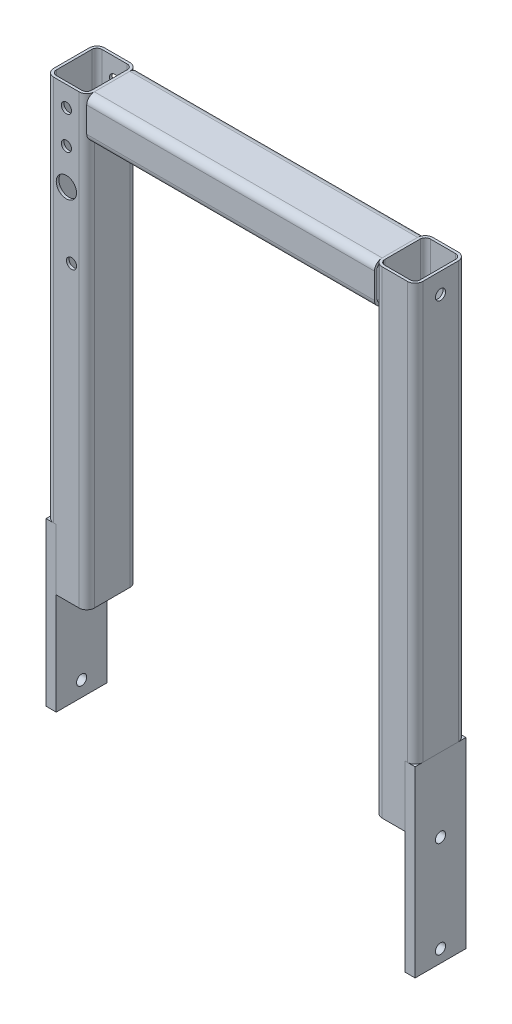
ISO-10303-21;
HEADER;
FILE_DESCRIPTION(('STEP AP214'),'2;1');
FILE_NAME('part.step','',(''),(''),'','','');
FILE_SCHEMA(('AUTOMOTIVE_DESIGN { 1 0 10303 214 1 1 1 1 }'));
ENDSEC;
DATA;
#1=APPLICATION_CONTEXT('core data for automotive mechanical design processes');
#2=APPLICATION_PROTOCOL_DEFINITION('international standard','automotive_design',2000,#1);
#3=PRODUCT_CONTEXT('',#1,'mechanical');
#4=PRODUCT('Part','Part','',(#3));
#5=PRODUCT_RELATED_PRODUCT_CATEGORY('part','',(#4));
#6=PRODUCT_DEFINITION_FORMATION('','',#4);
#7=PRODUCT_DEFINITION_CONTEXT('part definition',#1,'design');
#8=PRODUCT_DEFINITION('design','',#6,#7);
#9=PRODUCT_DEFINITION_SHAPE('','',#8);
#10=(LENGTH_UNIT() NAMED_UNIT(*) SI_UNIT(.MILLI.,.METRE.));
#11=(NAMED_UNIT(*) PLANE_ANGLE_UNIT() SI_UNIT($,.RADIAN.));
#12=(NAMED_UNIT(*) SI_UNIT($,.STERADIAN.) SOLID_ANGLE_UNIT());
#13=UNCERTAINTY_MEASURE_WITH_UNIT(LENGTH_MEASURE(1.E-05),#10,'distance_accuracy_value','');
#14=(GEOMETRIC_REPRESENTATION_CONTEXT(3) GLOBAL_UNCERTAINTY_ASSIGNED_CONTEXT((#13)) GLOBAL_UNIT_ASSIGNED_CONTEXT((#10,
#11,#12)) REPRESENTATION_CONTEXT('',''));
#15=CARTESIAN_POINT('',(0.,0.,0.));
#16=DIRECTION('',(0.,0.,1.));
#17=DIRECTION('',(1.,0.,0.));
#18=AXIS2_PLACEMENT_3D('',#15,#16,#17);
#19=CARTESIAN_POINT('',(110.49,-19.05,15.875));
#20=DIRECTION('',(-1.,0.,0.));
#21=DIRECTION('',(0.,-1.,0.));
#22=AXIS2_PLACEMENT_3D('',#19,#20,#21);
#23=PLANE('',#22);
#24=CARTESIAN_POINT('',(110.49,-87.3252,0.));
#25=DIRECTION('',(-1.,0.,0.));
#26=DIRECTION('',(0.,-1.,0.));
#27=AXIS2_PLACEMENT_3D('',#24,#25,#26);
#28=CIRCLE('',#27,3.175);
#29=CARTESIAN_POINT('',(110.49,-87.3252,3.175));
#30=VERTEX_POINT('',#29);
#31=EDGE_CURVE('E116',#30,#30,#28,.F.);
#32=ORIENTED_EDGE('',*,*,#31,.F.);
#33=EDGE_LOOP('',(#32));
#34=FACE_BOUND('',#33,.T.);
#35=DIRECTION('',(0.,1.,0.));
#36=VECTOR('',#35,1.);
#37=CARTESIAN_POINT('',(110.49,-19.05,-15.875));
#38=LINE('',#37,#36);
#39=CARTESIAN_POINT('',(110.49,-95.25,-15.875));
#40=VERTEX_POINT('',#39);
#41=CARTESIAN_POINT('',(110.49,19.05,-15.875));
#42=VERTEX_POINT('',#41);
#43=EDGE_CURVE('E104',#40,#42,#38,.T.);
#44=ORIENTED_EDGE('',*,*,#43,.T.);
#45=DIRECTION('',(0.,0.,-1.));
#46=VECTOR('',#45,1.);
#47=CARTESIAN_POINT('',(110.49,19.05,15.875));
#48=LINE('',#47,#46);
#49=CARTESIAN_POINT('',(110.49,19.05,15.875));
#50=VERTEX_POINT('',#49);
#51=EDGE_CURVE('E56',#50,#42,#48,.T.);
#52=ORIENTED_EDGE('',*,*,#51,.F.);
#53=DIRECTION('',(0.,1.,0.));
#54=VECTOR('',#53,1.);
#55=CARTESIAN_POINT('',(110.49,-95.25,15.875));
#56=LINE('',#55,#54);
#57=CARTESIAN_POINT('',(110.49,-95.25,15.875));
#58=VERTEX_POINT('',#57);
#59=EDGE_CURVE('E95',#58,#50,#56,.T.);
#60=ORIENTED_EDGE('',*,*,#59,.F.);
#61=DIRECTION('',(0.,0.,-1.));
#62=VECTOR('',#61,1.);
#63=CARTESIAN_POINT('',(110.49,-95.25,15.875));
#64=LINE('',#63,#62);
#65=EDGE_CURVE('E12',#58,#40,#64,.T.);
#66=ORIENTED_EDGE('',*,*,#65,.T.);
#67=EDGE_LOOP('',(#44,#52,#60,#66));
#68=FACE_BOUND('',#67,.T.);
#69=CARTESIAN_POINT('',(110.49,-27.0002,0.));
#70=DIRECTION('',(-1.,0.,0.));
#71=DIRECTION('',(0.,-1.,0.));
#72=AXIS2_PLACEMENT_3D('',#69,#70,#71);
#73=CIRCLE('',#72,3.175);
#74=CARTESIAN_POINT('',(110.49,-27.0002,3.175));
#75=VERTEX_POINT('',#74);
#76=EDGE_CURVE('E123',#75,#75,#73,.F.);
#77=ORIENTED_EDGE('',*,*,#76,.F.);
#78=EDGE_LOOP('',(#77));
#79=FACE_BOUND('',#78,.T.);
#80=ADVANCED_FACE('F46',(#34,#68,#79),#23,.F.);
#81=CARTESIAN_POINT('',(104.14,19.05,15.875));
#82=DIRECTION('',(1.,0.,0.));
#83=DIRECTION('',(0.,0.,-1.));
#84=AXIS2_PLACEMENT_3D('',#81,#82,#83);
#85=PLANE('',#84);
#86=CARTESIAN_POINT('',(104.14,-87.3252,0.));
#87=DIRECTION('',(1.,0.,0.));
#88=DIRECTION('',(0.,0.,-1.));
#89=AXIS2_PLACEMENT_3D('',#86,#87,#88);
#90=CIRCLE('',#89,3.175);
#91=CARTESIAN_POINT('',(104.14,-87.3252,3.175));
#92=VERTEX_POINT('',#91);
#93=EDGE_CURVE('E121',#92,#92,#90,.F.);
#94=ORIENTED_EDGE('',*,*,#93,.F.);
#95=EDGE_LOOP('',(#94));
#96=FACE_BOUND('',#95,.T.);
#97=DIRECTION('',(0.,-1.,0.));
#98=VECTOR('',#97,1.);
#99=CARTESIAN_POINT('',(104.14,19.05,-15.875));
#100=LINE('',#99,#98);
#101=CARTESIAN_POINT('',(104.14,19.05,-15.875));
#102=VERTEX_POINT('',#101);
#103=CARTESIAN_POINT('',(104.14,-95.25,-15.875));
#104=VERTEX_POINT('',#103);
#105=EDGE_CURVE('E88',#102,#104,#100,.T.);
#106=ORIENTED_EDGE('',*,*,#105,.T.);
#107=DIRECTION('',(0.,0.,-1.));
#108=VECTOR('',#107,1.);
#109=CARTESIAN_POINT('',(104.14,-95.25,15.875));
#110=LINE('',#109,#108);
#111=CARTESIAN_POINT('',(104.14,-95.25,15.875));
#112=VERTEX_POINT('',#111);
#113=EDGE_CURVE('E109',#112,#104,#110,.T.);
#114=ORIENTED_EDGE('',*,*,#113,.F.);
#115=DIRECTION('',(0.,-1.,0.));
#116=VECTOR('',#115,1.);
#117=CARTESIAN_POINT('',(104.14,19.05,15.875));
#118=LINE('',#117,#116);
#119=CARTESIAN_POINT('',(104.14,19.05,15.875));
#120=VERTEX_POINT('',#119);
#121=EDGE_CURVE('E65',#120,#112,#118,.T.);
#122=ORIENTED_EDGE('',*,*,#121,.F.);
#123=DIRECTION('',(0.,0.,-1.));
#124=VECTOR('',#123,1.);
#125=CARTESIAN_POINT('',(104.14,19.05,15.875));
#126=LINE('',#125,#124);
#127=EDGE_CURVE('E105',#120,#102,#126,.T.);
#128=ORIENTED_EDGE('',*,*,#127,.T.);
#129=EDGE_LOOP('',(#106,#114,#122,#128));
#130=FACE_BOUND('',#129,.T.);
#131=CARTESIAN_POINT('',(104.14,-27.0002,0.));
#132=DIRECTION('',(1.,0.,0.));
#133=DIRECTION('',(0.,0.,-1.));
#134=AXIS2_PLACEMENT_3D('',#131,#132,#133);
#135=CIRCLE('',#134,3.175);
#136=CARTESIAN_POINT('',(104.14,-27.0002,3.175));
#137=VERTEX_POINT('',#136);
#138=EDGE_CURVE('E50',#137,#137,#135,.F.);
#139=ORIENTED_EDGE('',*,*,#138,.F.);
#140=EDGE_LOOP('',(#139));
#141=FACE_BOUND('',#140,.T.);
#142=ADVANCED_FACE('F137',(#96,#130,#141),#85,.F.);
#143=CARTESIAN_POINT('',(104.14,-95.25,15.875));
#144=DIRECTION('',(0.,1.,0.));
#145=DIRECTION('',(0.,0.,1.));
#146=AXIS2_PLACEMENT_3D('',#143,#144,#145);
#147=PLANE('',#146);
#148=DIRECTION('',(1.,0.,0.));
#149=VECTOR('',#148,1.);
#150=CARTESIAN_POINT('',(104.14,-95.25,-15.875));
#151=LINE('',#150,#149);
#152=EDGE_CURVE('E113',#104,#40,#151,.T.);
#153=ORIENTED_EDGE('',*,*,#152,.T.);
#154=ORIENTED_EDGE('',*,*,#65,.F.);
#155=DIRECTION('',(1.,0.,0.));
#156=VECTOR('',#155,1.);
#157=CARTESIAN_POINT('',(104.14,-95.25,15.875));
#158=LINE('',#157,#156);
#159=EDGE_CURVE('E100',#112,#58,#158,.T.);
#160=ORIENTED_EDGE('',*,*,#159,.F.);
#161=ORIENTED_EDGE('',*,*,#113,.T.);
#162=EDGE_LOOP('',(#153,#154,#160,#161));
#163=FACE_BOUND('',#162,.T.);
#164=ADVANCED_FACE('F48',(#163),#147,.F.);
#165=CARTESIAN_POINT('',(110.49,19.05,15.875));
#166=DIRECTION('',(0.,-1.,0.));
#167=DIRECTION('',(0.,0.,-1.));
#168=AXIS2_PLACEMENT_3D('',#165,#166,#167);
#169=PLANE('',#168);
#170=DIRECTION('',(-1.,0.,0.));
#171=VECTOR('',#170,1.);
#172=CARTESIAN_POINT('',(110.49,19.05,-15.875));
#173=LINE('',#172,#171);
#174=EDGE_CURVE('E82',#42,#102,#173,.T.);
#175=ORIENTED_EDGE('',*,*,#174,.T.);
#176=ORIENTED_EDGE('',*,*,#127,.F.);
#177=DIRECTION('',(-1.,0.,0.));
#178=VECTOR('',#177,1.);
#179=CARTESIAN_POINT('',(110.49,19.05,15.875));
#180=LINE('',#179,#178);
#181=EDGE_CURVE('E98',#50,#120,#180,.T.);
#182=ORIENTED_EDGE('',*,*,#181,.F.);
#183=ORIENTED_EDGE('',*,*,#51,.T.);
#184=EDGE_LOOP('',(#175,#176,#182,#183));
#185=FACE_BOUND('',#184,.T.);
#186=ADVANCED_FACE('F107',(#185),#169,.F.);
#187=CARTESIAN_POINT('',(0.,0.,15.875));
#188=DIRECTION('',(0.,0.,1.));
#189=DIRECTION('',(1.,0.,0.));
#190=AXIS2_PLACEMENT_3D('',#187,#188,#189);
#191=PLANE('',#190);
#192=ORIENTED_EDGE('',*,*,#159,.T.);
#193=ORIENTED_EDGE('',*,*,#59,.T.);
#194=ORIENTED_EDGE('',*,*,#181,.T.);
#195=ORIENTED_EDGE('',*,*,#121,.T.);
#196=EDGE_LOOP('',(#192,#193,#194,#195));
#197=FACE_BOUND('',#196,.T.);
#198=ADVANCED_FACE('F96',(#197),#191,.T.);
#199=CARTESIAN_POINT('',(0.,0.,-15.875));
#200=DIRECTION('',(0.,0.,1.));
#201=DIRECTION('',(1.,0.,0.));
#202=AXIS2_PLACEMENT_3D('',#199,#200,#201);
#203=PLANE('',#202);
#204=ORIENTED_EDGE('',*,*,#152,.F.);
#205=ORIENTED_EDGE('',*,*,#105,.F.);
#206=ORIENTED_EDGE('',*,*,#174,.F.);
#207=ORIENTED_EDGE('',*,*,#43,.F.);
#208=EDGE_LOOP('',(#204,#205,#206,#207));
#209=FACE_BOUND('',#208,.T.);
#210=ADVANCED_FACE('F149',(#209),#203,.F.);
#211=CARTESIAN_POINT('',(152.4,-87.3252,0.));
#212=DIRECTION('',(-1.,0.,0.));
#213=DIRECTION('',(0.,0.,1.));
#214=AXIS2_PLACEMENT_3D('',#211,#212,#213);
#215=CYLINDRICAL_SURFACE('',#214,3.175);
#216=CARTESIAN_POINT('',(104.14,-87.3252,3.175));
#217=CARTESIAN_POINT('',(104.206145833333,-87.3252,3.175));
#218=CARTESIAN_POINT('',(104.272291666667,-87.3252,3.175));
#219=CARTESIAN_POINT('',(104.404583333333,-87.3252,3.175));
#220=CARTESIAN_POINT('',(104.470729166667,-87.3252,3.175));
#221=CARTESIAN_POINT('',(104.603020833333,-87.3252,3.175));
#222=CARTESIAN_POINT('',(104.669166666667,-87.3252,3.175));
#223=CARTESIAN_POINT('',(104.801458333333,-87.3252,3.175));
#224=CARTESIAN_POINT('',(104.867604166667,-87.3252,3.175));
#225=CARTESIAN_POINT('',(104.999895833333,-87.3252,3.175));
#226=CARTESIAN_POINT('',(105.066041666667,-87.3252,3.175));
#227=CARTESIAN_POINT('',(105.198333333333,-87.3252,3.175));
#228=CARTESIAN_POINT('',(105.264479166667,-87.3252,3.175));
#229=CARTESIAN_POINT('',(105.396770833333,-87.3252,3.175));
#230=CARTESIAN_POINT('',(105.462916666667,-87.3252,3.175));
#231=CARTESIAN_POINT('',(105.595208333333,-87.3252,3.175));
#232=CARTESIAN_POINT('',(105.661354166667,-87.3252,3.175));
#233=CARTESIAN_POINT('',(105.793645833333,-87.3252,3.175));
#234=CARTESIAN_POINT('',(105.859791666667,-87.3252,3.175));
#235=CARTESIAN_POINT('',(105.992083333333,-87.3252,3.175));
#236=CARTESIAN_POINT('',(106.058229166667,-87.3252,3.175));
#237=CARTESIAN_POINT('',(106.190520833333,-87.3252,3.175));
#238=CARTESIAN_POINT('',(106.256666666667,-87.3252,3.175));
#239=CARTESIAN_POINT('',(106.388958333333,-87.3252,3.175));
#240=CARTESIAN_POINT('',(106.455104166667,-87.3252,3.175));
#241=CARTESIAN_POINT('',(106.587395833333,-87.3252,3.175));
#242=CARTESIAN_POINT('',(106.653541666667,-87.3252,3.175));
#243=CARTESIAN_POINT('',(106.785833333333,-87.3252,3.175));
#244=CARTESIAN_POINT('',(106.851979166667,-87.3252,3.175));
#245=CARTESIAN_POINT('',(106.984270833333,-87.3252,3.175));
#246=CARTESIAN_POINT('',(107.050416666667,-87.3252,3.175));
#247=CARTESIAN_POINT('',(107.182708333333,-87.3252,3.175));
#248=CARTESIAN_POINT('',(107.248854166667,-87.3252,3.175));
#249=CARTESIAN_POINT('',(107.381145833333,-87.3252,3.175));
#250=CARTESIAN_POINT('',(107.447291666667,-87.3252,3.175));
#251=CARTESIAN_POINT('',(107.579583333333,-87.3252,3.175));
#252=CARTESIAN_POINT('',(107.645729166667,-87.3252,3.175));
#253=CARTESIAN_POINT('',(107.778020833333,-87.3252,3.175));
#254=CARTESIAN_POINT('',(107.844166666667,-87.3252,3.175));
#255=CARTESIAN_POINT('',(107.976458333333,-87.3252,3.175));
#256=CARTESIAN_POINT('',(108.042604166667,-87.3252,3.175));
#257=CARTESIAN_POINT('',(108.174895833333,-87.3252,3.175));
#258=CARTESIAN_POINT('',(108.241041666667,-87.3252,3.175));
#259=CARTESIAN_POINT('',(108.373333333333,-87.3252,3.175));
#260=CARTESIAN_POINT('',(108.439479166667,-87.3252,3.175));
#261=CARTESIAN_POINT('',(108.571770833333,-87.3252,3.175));
#262=CARTESIAN_POINT('',(108.637916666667,-87.3252,3.175));
#263=CARTESIAN_POINT('',(108.770208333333,-87.3252,3.175));
#264=CARTESIAN_POINT('',(108.836354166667,-87.3252,3.175));
#265=CARTESIAN_POINT('',(108.968645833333,-87.3252,3.175));
#266=CARTESIAN_POINT('',(109.034791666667,-87.3252,3.175));
#267=CARTESIAN_POINT('',(109.167083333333,-87.3252,3.175));
#268=CARTESIAN_POINT('',(109.233229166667,-87.3252,3.175));
#269=CARTESIAN_POINT('',(109.365520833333,-87.3252,3.175));
#270=CARTESIAN_POINT('',(109.431666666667,-87.3252,3.175));
#271=CARTESIAN_POINT('',(109.563958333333,-87.3252,3.175));
#272=CARTESIAN_POINT('',(109.630104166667,-87.3252,3.175));
#273=CARTESIAN_POINT('',(109.762395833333,-87.3252,3.175));
#274=CARTESIAN_POINT('',(109.828541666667,-87.3252,3.175));
#275=CARTESIAN_POINT('',(109.960833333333,-87.3252,3.175));
#276=CARTESIAN_POINT('',(110.026979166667,-87.3252,3.175));
#277=CARTESIAN_POINT('',(110.159270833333,-87.3252,3.175));
#278=CARTESIAN_POINT('',(110.225416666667,-87.3252,3.175));
#279=CARTESIAN_POINT('',(110.357708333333,-87.3252,3.175));
#280=CARTESIAN_POINT('',(110.423854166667,-87.3252,3.175));
#281=CARTESIAN_POINT('',(110.49,-87.3252,3.175));
#282=B_SPLINE_CURVE_WITH_KNOTS('',3,(#216,#217,#218,#219,#220,#221,#222,#223,#224,#225,#226,
#227,#228,#229,#230,#231,#232,#233,#234,#235,#236,#237,#238,#239,#240,#241,#242,#243,#244,#245,
#246,#247,#248,#249,#250,#251,#252,#253,#254,#255,#256,#257,#258,#259,#260,#261,#262,#263,#264,
#265,#266,#267,#268,#269,#270,#271,#272,#273,#274,#275,#276,#277,#278,#279,#280,#281),
.UNSPECIFIED.,.F.,.F.,(4,2,2,2,2,2,2,2,2,2,2,2,2,2,2,2,2,2,2,2,2,2,2,2,2,2,2,2,2,2,2,2,4),(0.,
0.198437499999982,0.396874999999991,0.595312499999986,0.793749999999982,0.992187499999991,
1.19062499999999,1.38906249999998,1.58749999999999,1.78593749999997,1.98437499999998,
2.18281249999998,2.38124999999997,2.57968749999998,2.77812499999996,2.97656249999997,
3.17499999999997,3.37343749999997,3.57187499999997,3.77031249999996,3.96874999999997,
4.16718749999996,4.36562499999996,4.56406249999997,4.76249999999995,4.96093749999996,
5.15937499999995,5.35781249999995,5.55624999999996,5.75468749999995,5.95312499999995,
6.15156249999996,6.34999999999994),.UNSPECIFIED.);
#283=EDGE_CURVE('BSEAM158',#92,#30,#282,.T.);
#284=ORIENTED_EDGE('',*,*,#93,.T.);
#285=ORIENTED_EDGE('',*,*,#31,.T.);
#286=ORIENTED_EDGE('',*,*,#283,.T.);
#287=ORIENTED_EDGE('',*,*,#283,.F.);
#288=EDGE_LOOP('',(#284,#286,#285,#287));
#289=FACE_BOUND('',#288,.T.);
#290=ADVANCED_FACE('F158',(#289),#215,.F.);
#291=CARTESIAN_POINT('',(152.4,-27.0002,0.));
#292=DIRECTION('',(-1.,0.,0.));
#293=DIRECTION('',(0.,0.,1.));
#294=AXIS2_PLACEMENT_3D('',#291,#292,#293);
#295=CYLINDRICAL_SURFACE('',#294,3.175);
#296=CARTESIAN_POINT('',(104.14,-27.0002,3.175));
#297=CARTESIAN_POINT('',(104.206145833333,-27.0002,3.175));
#298=CARTESIAN_POINT('',(104.272291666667,-27.0002,3.175));
#299=CARTESIAN_POINT('',(104.404583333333,-27.0002,3.175));
#300=CARTESIAN_POINT('',(104.470729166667,-27.0002,3.175));
#301=CARTESIAN_POINT('',(104.603020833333,-27.0002,3.175));
#302=CARTESIAN_POINT('',(104.669166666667,-27.0002,3.175));
#303=CARTESIAN_POINT('',(104.801458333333,-27.0002,3.175));
#304=CARTESIAN_POINT('',(104.867604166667,-27.0002,3.175));
#305=CARTESIAN_POINT('',(104.999895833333,-27.0002,3.175));
#306=CARTESIAN_POINT('',(105.066041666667,-27.0002,3.175));
#307=CARTESIAN_POINT('',(105.198333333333,-27.0002,3.175));
#308=CARTESIAN_POINT('',(105.264479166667,-27.0002,3.175));
#309=CARTESIAN_POINT('',(105.396770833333,-27.0002,3.175));
#310=CARTESIAN_POINT('',(105.462916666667,-27.0002,3.175));
#311=CARTESIAN_POINT('',(105.595208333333,-27.0002,3.175));
#312=CARTESIAN_POINT('',(105.661354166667,-27.0002,3.175));
#313=CARTESIAN_POINT('',(105.793645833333,-27.0002,3.175));
#314=CARTESIAN_POINT('',(105.859791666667,-27.0002,3.175));
#315=CARTESIAN_POINT('',(105.992083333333,-27.0002,3.175));
#316=CARTESIAN_POINT('',(106.058229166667,-27.0002,3.175));
#317=CARTESIAN_POINT('',(106.190520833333,-27.0002,3.175));
#318=CARTESIAN_POINT('',(106.256666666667,-27.0002,3.175));
#319=CARTESIAN_POINT('',(106.388958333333,-27.0002,3.175));
#320=CARTESIAN_POINT('',(106.455104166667,-27.0002,3.175));
#321=CARTESIAN_POINT('',(106.587395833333,-27.0002,3.175));
#322=CARTESIAN_POINT('',(106.653541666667,-27.0002,3.175));
#323=CARTESIAN_POINT('',(106.785833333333,-27.0002,3.175));
#324=CARTESIAN_POINT('',(106.851979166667,-27.0002,3.175));
#325=CARTESIAN_POINT('',(106.984270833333,-27.0002,3.175));
#326=CARTESIAN_POINT('',(107.050416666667,-27.0002,3.175));
#327=CARTESIAN_POINT('',(107.182708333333,-27.0002,3.175));
#328=CARTESIAN_POINT('',(107.248854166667,-27.0002,3.175));
#329=CARTESIAN_POINT('',(107.381145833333,-27.0002,3.175));
#330=CARTESIAN_POINT('',(107.447291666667,-27.0002,3.175));
#331=CARTESIAN_POINT('',(107.579583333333,-27.0002,3.175));
#332=CARTESIAN_POINT('',(107.645729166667,-27.0002,3.175));
#333=CARTESIAN_POINT('',(107.778020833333,-27.0002,3.175));
#334=CARTESIAN_POINT('',(107.844166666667,-27.0002,3.175));
#335=CARTESIAN_POINT('',(107.976458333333,-27.0002,3.175));
#336=CARTESIAN_POINT('',(108.042604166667,-27.0002,3.175));
#337=CARTESIAN_POINT('',(108.174895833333,-27.0002,3.175));
#338=CARTESIAN_POINT('',(108.241041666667,-27.0002,3.175));
#339=CARTESIAN_POINT('',(108.373333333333,-27.0002,3.175));
#340=CARTESIAN_POINT('',(108.439479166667,-27.0002,3.175));
#341=CARTESIAN_POINT('',(108.571770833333,-27.0002,3.175));
#342=CARTESIAN_POINT('',(108.637916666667,-27.0002,3.175));
#343=CARTESIAN_POINT('',(108.770208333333,-27.0002,3.175));
#344=CARTESIAN_POINT('',(108.836354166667,-27.0002,3.175));
#345=CARTESIAN_POINT('',(108.968645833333,-27.0002,3.175));
#346=CARTESIAN_POINT('',(109.034791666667,-27.0002,3.175));
#347=CARTESIAN_POINT('',(109.167083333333,-27.0002,3.175));
#348=CARTESIAN_POINT('',(109.233229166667,-27.0002,3.175));
#349=CARTESIAN_POINT('',(109.365520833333,-27.0002,3.175));
#350=CARTESIAN_POINT('',(109.431666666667,-27.0002,3.175));
#351=CARTESIAN_POINT('',(109.563958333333,-27.0002,3.175));
#352=CARTESIAN_POINT('',(109.630104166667,-27.0002,3.175));
#353=CARTESIAN_POINT('',(109.762395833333,-27.0002,3.175));
#354=CARTESIAN_POINT('',(109.828541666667,-27.0002,3.175));
#355=CARTESIAN_POINT('',(109.960833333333,-27.0002,3.175));
#356=CARTESIAN_POINT('',(110.026979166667,-27.0002,3.175));
#357=CARTESIAN_POINT('',(110.159270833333,-27.0002,3.175));
#358=CARTESIAN_POINT('',(110.225416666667,-27.0002,3.175));
#359=CARTESIAN_POINT('',(110.357708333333,-27.0002,3.175));
#360=CARTESIAN_POINT('',(110.423854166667,-27.0002,3.175));
#361=CARTESIAN_POINT('',(110.49,-27.0002,3.175));
#362=B_SPLINE_CURVE_WITH_KNOTS('',3,(#296,#297,#298,#299,#300,#301,#302,#303,#304,#305,#306,
#307,#308,#309,#310,#311,#312,#313,#314,#315,#316,#317,#318,#319,#320,#321,#322,#323,#324,#325,
#326,#327,#328,#329,#330,#331,#332,#333,#334,#335,#336,#337,#338,#339,#340,#341,#342,#343,#344,
#345,#346,#347,#348,#349,#350,#351,#352,#353,#354,#355,#356,#357,#358,#359,#360,#361),
.UNSPECIFIED.,.F.,.F.,(4,2,2,2,2,2,2,2,2,2,2,2,2,2,2,2,2,2,2,2,2,2,2,2,2,2,2,2,2,2,2,2,4),(0.,
0.198437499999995,0.396874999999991,0.5953125,0.793749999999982,0.992187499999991,
1.19062499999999,1.38906249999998,1.58749999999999,1.78593749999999,1.98437499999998,
2.18281249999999,2.38124999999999,2.57968749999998,2.77812499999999,2.97656249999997,
3.17499999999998,3.37343749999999,3.57187499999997,3.77031249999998,3.96874999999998,
4.16718749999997,4.36562499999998,4.56406249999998,4.76249999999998,4.96093749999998,
5.15937499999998,5.35781249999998,5.55624999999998,5.75468749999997,5.95312499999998,
6.15156249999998,6.34999999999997),.UNSPECIFIED.);
#363=EDGE_CURVE('BSEAM135',#137,#75,#362,.T.);
#364=ORIENTED_EDGE('',*,*,#138,.T.);
#365=ORIENTED_EDGE('',*,*,#76,.T.);
#366=ORIENTED_EDGE('',*,*,#363,.T.);
#367=ORIENTED_EDGE('',*,*,#363,.F.);
#368=EDGE_LOOP('',(#364,#366,#365,#367));
#369=FACE_BOUND('',#368,.T.);
#370=ADVANCED_FACE('F135',(#369),#295,.F.);
#371=CLOSED_SHELL('',(#80,#142,#164,#186,#198,#210,#290,#370));
#372=MANIFOLD_SOLID_BREP('B2',#371);
#373=CARTESIAN_POINT('',(-113.792,0.,15.875));
#374=DIRECTION('',(-1.,0.,0.));
#375=DIRECTION('',(0.,0.,1.));
#376=AXIS2_PLACEMENT_3D('',#373,#374,#375);
#377=PLANE('',#376);
#378=CARTESIAN_POINT('',(-113.792,-53.975,0.));
#379=DIRECTION('',(-1.,0.,0.));
#380=DIRECTION('',(0.,0.,1.));
#381=AXIS2_PLACEMENT_3D('',#378,#379,#380);
#382=CIRCLE('',#381,3.175);
#383=CARTESIAN_POINT('',(-113.792,-53.975,-3.175));
#384=VERTEX_POINT('',#383);
#385=EDGE_CURVE('E302',#384,#384,#382,.T.);
#386=ORIENTED_EDGE('',*,*,#385,.T.);
#387=EDGE_LOOP('',(#386));
#388=FACE_BOUND('',#387,.T.);
#389=CARTESIAN_POINT('',(-113.792,-9.52500000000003,0.));
#390=DIRECTION('',(-1.,0.,0.));
#391=DIRECTION('',(0.,0.,1.));
#392=AXIS2_PLACEMENT_3D('',#389,#390,#391);
#393=CIRCLE('',#392,3.175);
#394=CARTESIAN_POINT('',(-113.792,-9.52500000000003,-3.175));
#395=VERTEX_POINT('',#394);
#396=EDGE_CURVE('E293',#395,#395,#393,.T.);
#397=ORIENTED_EDGE('',*,*,#396,.T.);
#398=EDGE_LOOP('',(#397));
#399=FACE_BOUND('',#398,.T.);
#400=DIRECTION('',(0.,1.,0.));
#401=VECTOR('',#400,1.);
#402=CARTESIAN_POINT('',(-113.792,0.,-15.875));
#403=LINE('',#402,#401);
#404=CARTESIAN_POINT('',(-113.792,-63.5,-15.875));
#405=VERTEX_POINT('',#404);
#406=CARTESIAN_POINT('',(-113.792,38.1,-15.875));
#407=VERTEX_POINT('',#406);
#408=EDGE_CURVE('E266',#405,#407,#403,.T.);
#409=ORIENTED_EDGE('',*,*,#408,.T.);
#410=DIRECTION('',(0.,0.,-1.));
#411=VECTOR('',#410,1.);
#412=CARTESIAN_POINT('',(-113.792,38.1,15.875));
#413=LINE('',#412,#411);
#414=CARTESIAN_POINT('',(-113.792,38.1,15.875));
#415=VERTEX_POINT('',#414);
#416=EDGE_CURVE('E44',#415,#407,#413,.T.);
#417=ORIENTED_EDGE('',*,*,#416,.F.);
#418=DIRECTION('',(0.,1.,0.));
#419=VECTOR('',#418,1.);
#420=CARTESIAN_POINT('',(-113.792,0.,15.875));
#421=LINE('',#420,#419);
#422=CARTESIAN_POINT('',(-113.792,-63.5,15.875));
#423=VERTEX_POINT('',#422);
#424=EDGE_CURVE('E271',#423,#415,#421,.T.);
#425=ORIENTED_EDGE('',*,*,#424,.F.);
#426=DIRECTION('',(0.,0.,-1.));
#427=VECTOR('',#426,1.);
#428=CARTESIAN_POINT('',(-113.792,-63.5,15.875));
#429=LINE('',#428,#427);
#430=EDGE_CURVE('E288',#423,#405,#429,.T.);
#431=ORIENTED_EDGE('',*,*,#430,.T.);
#432=EDGE_LOOP('',(#409,#417,#425,#431));
#433=FACE_BOUND('',#432,.T.);
#434=ADVANCED_FACE('F225',(#388,#399,#433),#377,.F.);
#435=CARTESIAN_POINT('',(-113.792,38.1,15.875));
#436=DIRECTION('',(0.,-1.,0.));
#437=DIRECTION('',(0.,0.,-1.));
#438=AXIS2_PLACEMENT_3D('',#435,#436,#437);
#439=PLANE('',#438);
#440=DIRECTION('',(-1.,0.,0.));
#441=VECTOR('',#440,1.);
#442=CARTESIAN_POINT('',(-113.792,38.1,-15.875));
#443=LINE('',#442,#441);
#444=CARTESIAN_POINT('',(-120.142,38.1,-15.875));
#445=VERTEX_POINT('',#444);
#446=EDGE_CURVE('E283',#407,#445,#443,.T.);
#447=ORIENTED_EDGE('',*,*,#446,.T.);
#448=DIRECTION('',(0.,0.,-1.));
#449=VECTOR('',#448,1.);
#450=CARTESIAN_POINT('',(-120.142,38.1,15.875));
#451=LINE('',#450,#449);
#452=CARTESIAN_POINT('',(-120.142,38.1,15.875));
#453=VERTEX_POINT('',#452);
#454=EDGE_CURVE('E234',#453,#445,#451,.T.);
#455=ORIENTED_EDGE('',*,*,#454,.F.);
#456=DIRECTION('',(-1.,0.,0.));
#457=VECTOR('',#456,1.);
#458=CARTESIAN_POINT('',(-113.792,38.1,15.875));
#459=LINE('',#458,#457);
#460=EDGE_CURVE('E274',#415,#453,#459,.T.);
#461=ORIENTED_EDGE('',*,*,#460,.F.);
#462=ORIENTED_EDGE('',*,*,#416,.T.);
#463=EDGE_LOOP('',(#447,#455,#461,#462));
#464=FACE_BOUND('',#463,.T.);
#465=ADVANCED_FACE('F282',(#464),#439,.F.);
#466=CARTESIAN_POINT('',(-120.142,-63.5,15.875));
#467=DIRECTION('',(1.,0.,0.));
#468=DIRECTION('',(0.,0.,-1.));
#469=AXIS2_PLACEMENT_3D('',#466,#467,#468);
#470=PLANE('',#469);
#471=CARTESIAN_POINT('',(-120.142,-53.975,0.));
#472=DIRECTION('',(1.,0.,0.));
#473=DIRECTION('',(0.,0.,-1.));
#474=AXIS2_PLACEMENT_3D('',#471,#472,#473);
#475=CIRCLE('',#474,3.175);
#476=CARTESIAN_POINT('',(-120.142,-53.975,-3.175));
#477=VERTEX_POINT('',#476);
#478=EDGE_CURVE('E228',#477,#477,#475,.T.);
#479=ORIENTED_EDGE('',*,*,#478,.T.);
#480=EDGE_LOOP('',(#479));
#481=FACE_BOUND('',#480,.T.);
#482=CARTESIAN_POINT('',(-120.142,-9.52500000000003,0.));
#483=DIRECTION('',(1.,0.,0.));
#484=DIRECTION('',(0.,0.,-1.));
#485=AXIS2_PLACEMENT_3D('',#482,#483,#484);
#486=CIRCLE('',#485,3.175);
#487=CARTESIAN_POINT('',(-120.142,-9.52500000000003,-3.175));
#488=VERTEX_POINT('',#487);
#489=EDGE_CURVE('E300',#488,#488,#486,.T.);
#490=ORIENTED_EDGE('',*,*,#489,.T.);
#491=EDGE_LOOP('',(#490));
#492=FACE_BOUND('',#491,.T.);
#493=DIRECTION('',(0.,-1.,0.));
#494=VECTOR('',#493,1.);
#495=CARTESIAN_POINT('',(-120.142,-63.5,-15.875));
#496=LINE('',#495,#494);
#497=CARTESIAN_POINT('',(-120.142,-63.5,-15.875));
#498=VERTEX_POINT('',#497);
#499=EDGE_CURVE('E259',#445,#498,#496,.T.);
#500=ORIENTED_EDGE('',*,*,#499,.T.);
#501=DIRECTION('',(0.,0.,-1.));
#502=VECTOR('',#501,1.);
#503=CARTESIAN_POINT('',(-120.142,-63.5,15.875));
#504=LINE('',#503,#502);
#505=CARTESIAN_POINT('',(-120.142,-63.5,15.875));
#506=VERTEX_POINT('',#505);
#507=EDGE_CURVE('E284',#506,#498,#504,.T.);
#508=ORIENTED_EDGE('',*,*,#507,.F.);
#509=DIRECTION('',(0.,-1.,0.));
#510=VECTOR('',#509,1.);
#511=CARTESIAN_POINT('',(-120.142,38.1,15.875));
#512=LINE('',#511,#510);
#513=EDGE_CURVE('E278',#453,#506,#512,.T.);
#514=ORIENTED_EDGE('',*,*,#513,.F.);
#515=ORIENTED_EDGE('',*,*,#454,.T.);
#516=EDGE_LOOP('',(#500,#508,#514,#515));
#517=FACE_BOUND('',#516,.T.);
#518=ADVANCED_FACE('F286',(#481,#492,#517),#470,.F.);
#519=CARTESIAN_POINT('',(-113.792,-63.5,15.875));
#520=DIRECTION('',(0.,1.,0.));
#521=DIRECTION('',(0.,0.,1.));
#522=AXIS2_PLACEMENT_3D('',#519,#520,#521);
#523=PLANE('',#522);
#524=DIRECTION('',(1.,0.,0.));
#525=VECTOR('',#524,1.);
#526=CARTESIAN_POINT('',(-113.792,-63.5,-15.875));
#527=LINE('',#526,#525);
#528=EDGE_CURVE('E296',#498,#405,#527,.T.);
#529=ORIENTED_EDGE('',*,*,#528,.T.);
#530=ORIENTED_EDGE('',*,*,#430,.F.);
#531=DIRECTION('',(1.,0.,0.));
#532=VECTOR('',#531,1.);
#533=CARTESIAN_POINT('',(-113.792,-63.5,15.875));
#534=LINE('',#533,#532);
#535=EDGE_CURVE('E243',#506,#423,#534,.T.);
#536=ORIENTED_EDGE('',*,*,#535,.F.);
#537=ORIENTED_EDGE('',*,*,#507,.T.);
#538=EDGE_LOOP('',(#529,#530,#536,#537));
#539=FACE_BOUND('',#538,.T.);
#540=ADVANCED_FACE('F334',(#539),#523,.F.);
#541=CARTESIAN_POINT('',(0.,0.,15.875));
#542=DIRECTION('',(0.,0.,-1.));
#543=DIRECTION('',(-1.,0.,0.));
#544=AXIS2_PLACEMENT_3D('',#541,#542,#543);
#545=PLANE('',#544);
#546=ORIENTED_EDGE('',*,*,#424,.T.);
#547=ORIENTED_EDGE('',*,*,#460,.T.);
#548=ORIENTED_EDGE('',*,*,#513,.T.);
#549=ORIENTED_EDGE('',*,*,#535,.T.);
#550=EDGE_LOOP('',(#546,#547,#548,#549));
#551=FACE_BOUND('',#550,.T.);
#552=ADVANCED_FACE('F276',(#551),#545,.F.);
#553=CARTESIAN_POINT('',(0.,0.,-15.875));
#554=DIRECTION('',(0.,0.,-1.));
#555=DIRECTION('',(-1.,0.,0.));
#556=AXIS2_PLACEMENT_3D('',#553,#554,#555);
#557=PLANE('',#556);
#558=ORIENTED_EDGE('',*,*,#408,.F.);
#559=ORIENTED_EDGE('',*,*,#528,.F.);
#560=ORIENTED_EDGE('',*,*,#499,.F.);
#561=ORIENTED_EDGE('',*,*,#446,.F.);
#562=EDGE_LOOP('',(#558,#559,#560,#561));
#563=FACE_BOUND('',#562,.T.);
#564=ADVANCED_FACE('F323',(#563),#557,.T.);
#565=CARTESIAN_POINT('',(-152.4,-9.52500000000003,0.));
#566=DIRECTION('',(1.,0.,0.));
#567=DIRECTION('',(0.,0.,-1.));
#568=AXIS2_PLACEMENT_3D('',#565,#566,#567);
#569=CYLINDRICAL_SURFACE('',#568,3.175);
#570=CARTESIAN_POINT('',(-120.142,-9.52500000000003,-3.175));
#571=CARTESIAN_POINT('',(-120.075854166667,-9.52500000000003,-3.175));
#572=CARTESIAN_POINT('',(-120.009708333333,-9.52500000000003,-3.175));
#573=CARTESIAN_POINT('',(-119.877416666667,-9.52500000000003,-3.175));
#574=CARTESIAN_POINT('',(-119.811270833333,-9.52500000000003,-3.175));
#575=CARTESIAN_POINT('',(-119.678979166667,-9.52500000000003,-3.175));
#576=CARTESIAN_POINT('',(-119.612833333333,-9.52500000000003,-3.175));
#577=CARTESIAN_POINT('',(-119.480541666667,-9.52500000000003,-3.175));
#578=CARTESIAN_POINT('',(-119.414395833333,-9.52500000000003,-3.175));
#579=CARTESIAN_POINT('',(-119.282104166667,-9.52500000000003,-3.175));
#580=CARTESIAN_POINT('',(-119.215958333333,-9.52500000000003,-3.175));
#581=CARTESIAN_POINT('',(-119.083666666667,-9.52500000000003,-3.175));
#582=CARTESIAN_POINT('',(-119.017520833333,-9.52500000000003,-3.175));
#583=CARTESIAN_POINT('',(-118.885229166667,-9.52500000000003,-3.175));
#584=CARTESIAN_POINT('',(-118.819083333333,-9.52500000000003,-3.175));
#585=CARTESIAN_POINT('',(-118.686791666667,-9.52500000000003,-3.175));
#586=CARTESIAN_POINT('',(-118.620645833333,-9.52500000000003,-3.175));
#587=CARTESIAN_POINT('',(-118.488354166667,-9.52500000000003,-3.175));
#588=CARTESIAN_POINT('',(-118.422208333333,-9.52500000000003,-3.175));
#589=CARTESIAN_POINT('',(-118.289916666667,-9.52500000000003,-3.175));
#590=CARTESIAN_POINT('',(-118.223770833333,-9.52500000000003,-3.175));
#591=CARTESIAN_POINT('',(-118.091479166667,-9.52500000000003,-3.175));
#592=CARTESIAN_POINT('',(-118.025333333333,-9.52500000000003,-3.175));
#593=CARTESIAN_POINT('',(-117.893041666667,-9.52500000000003,-3.175));
#594=CARTESIAN_POINT('',(-117.826895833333,-9.52500000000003,-3.175));
#595=CARTESIAN_POINT('',(-117.694604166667,-9.52500000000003,-3.175));
#596=CARTESIAN_POINT('',(-117.628458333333,-9.52500000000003,-3.175));
#597=CARTESIAN_POINT('',(-117.496166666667,-9.52500000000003,-3.175));
#598=CARTESIAN_POINT('',(-117.430020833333,-9.52500000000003,-3.175));
#599=CARTESIAN_POINT('',(-117.297729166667,-9.52500000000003,-3.175));
#600=CARTESIAN_POINT('',(-117.231583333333,-9.52500000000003,-3.175));
#601=CARTESIAN_POINT('',(-117.099291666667,-9.52500000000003,-3.175));
#602=CARTESIAN_POINT('',(-117.033145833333,-9.52500000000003,-3.175));
#603=CARTESIAN_POINT('',(-116.900854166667,-9.52500000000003,-3.175));
#604=CARTESIAN_POINT('',(-116.834708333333,-9.52500000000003,-3.175));
#605=CARTESIAN_POINT('',(-116.702416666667,-9.52500000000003,-3.175));
#606=CARTESIAN_POINT('',(-116.636270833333,-9.52500000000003,-3.175));
#607=CARTESIAN_POINT('',(-116.503979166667,-9.52500000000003,-3.175));
#608=CARTESIAN_POINT('',(-116.437833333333,-9.52500000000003,-3.175));
#609=CARTESIAN_POINT('',(-116.305541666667,-9.52500000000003,-3.175));
#610=CARTESIAN_POINT('',(-116.239395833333,-9.52500000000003,-3.175));
#611=CARTESIAN_POINT('',(-116.107104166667,-9.52500000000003,-3.175));
#612=CARTESIAN_POINT('',(-116.040958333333,-9.52500000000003,-3.175));
#613=CARTESIAN_POINT('',(-115.908666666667,-9.52500000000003,-3.175));
#614=CARTESIAN_POINT('',(-115.842520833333,-9.52500000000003,-3.175));
#615=CARTESIAN_POINT('',(-115.710229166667,-9.52500000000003,-3.175));
#616=CARTESIAN_POINT('',(-115.644083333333,-9.52500000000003,-3.175));
#617=CARTESIAN_POINT('',(-115.511791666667,-9.52500000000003,-3.175));
#618=CARTESIAN_POINT('',(-115.445645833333,-9.52500000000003,-3.175));
#619=CARTESIAN_POINT('',(-115.313354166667,-9.52500000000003,-3.175));
#620=CARTESIAN_POINT('',(-115.247208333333,-9.52500000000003,-3.175));
#621=CARTESIAN_POINT('',(-115.114916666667,-9.52500000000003,-3.175));
#622=CARTESIAN_POINT('',(-115.048770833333,-9.52500000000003,-3.175));
#623=CARTESIAN_POINT('',(-114.916479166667,-9.52500000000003,-3.175));
#624=CARTESIAN_POINT('',(-114.850333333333,-9.52500000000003,-3.175));
#625=CARTESIAN_POINT('',(-114.718041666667,-9.52500000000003,-3.175));
#626=CARTESIAN_POINT('',(-114.651895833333,-9.52500000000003,-3.175));
#627=CARTESIAN_POINT('',(-114.519604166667,-9.52500000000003,-3.175));
#628=CARTESIAN_POINT('',(-114.453458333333,-9.52500000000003,-3.175));
#629=CARTESIAN_POINT('',(-114.321166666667,-9.52500000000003,-3.175));
#630=CARTESIAN_POINT('',(-114.255020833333,-9.52500000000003,-3.175));
#631=CARTESIAN_POINT('',(-114.122729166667,-9.52500000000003,-3.175));
#632=CARTESIAN_POINT('',(-114.056583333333,-9.52500000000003,-3.175));
#633=CARTESIAN_POINT('',(-113.924291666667,-9.52500000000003,-3.175));
#634=CARTESIAN_POINT('',(-113.858145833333,-9.52500000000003,-3.175));
#635=CARTESIAN_POINT('',(-113.792,-9.52500000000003,-3.175));
#636=B_SPLINE_CURVE_WITH_KNOTS('',3,(#570,#571,#572,#573,#574,#575,#576,#577,#578,#579,#580,
#581,#582,#583,#584,#585,#586,#587,#588,#589,#590,#591,#592,#593,#594,#595,#596,#597,#598,#599,
#600,#601,#602,#603,#604,#605,#606,#607,#608,#609,#610,#611,#612,#613,#614,#615,#616,#617,#618,
#619,#620,#621,#622,#623,#624,#625,#626,#627,#628,#629,#630,#631,#632,#633,#634,#635),
.UNSPECIFIED.,.F.,.F.,(4,2,2,2,2,2,2,2,2,2,2,2,2,2,2,2,2,2,2,2,2,2,2,2,2,2,2,2,2,2,2,2,4),(0.,
0.198437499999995,0.396874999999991,0.5953125,0.793749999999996,0.992187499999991,1.190625,
1.3890625,1.58749999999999,1.7859375,1.984375,2.18281249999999,2.38125,2.5796875,
2.77812499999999,2.9765625,3.175,3.37343749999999,3.571875,3.7703125,3.96874999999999,4.1671875,
4.365625,4.56406249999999,4.7625,4.9609375,5.15937499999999,5.3578125,5.55625,5.75468749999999,
5.953125,6.1515625,6.34999999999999),.UNSPECIFIED.);
#637=EDGE_CURVE('BSEAM318',#488,#395,#636,.T.);
#638=ORIENTED_EDGE('',*,*,#489,.F.);
#639=ORIENTED_EDGE('',*,*,#396,.F.);
#640=ORIENTED_EDGE('',*,*,#637,.T.);
#641=ORIENTED_EDGE('',*,*,#637,.F.);
#642=EDGE_LOOP('',(#638,#640,#639,#641));
#643=FACE_BOUND('',#642,.T.);
#644=ADVANCED_FACE('F318',(#643),#569,.F.);
#645=CARTESIAN_POINT('',(-152.4,-53.975,0.));
#646=DIRECTION('',(1.,0.,0.));
#647=DIRECTION('',(0.,0.,-1.));
#648=AXIS2_PLACEMENT_3D('',#645,#646,#647);
#649=CYLINDRICAL_SURFACE('',#648,3.175);
#650=CARTESIAN_POINT('',(-120.142,-53.975,-3.175));
#651=CARTESIAN_POINT('',(-120.075854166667,-53.975,-3.175));
#652=CARTESIAN_POINT('',(-120.009708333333,-53.975,-3.175));
#653=CARTESIAN_POINT('',(-119.877416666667,-53.975,-3.175));
#654=CARTESIAN_POINT('',(-119.811270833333,-53.975,-3.175));
#655=CARTESIAN_POINT('',(-119.678979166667,-53.975,-3.175));
#656=CARTESIAN_POINT('',(-119.612833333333,-53.975,-3.175));
#657=CARTESIAN_POINT('',(-119.480541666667,-53.975,-3.175));
#658=CARTESIAN_POINT('',(-119.414395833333,-53.975,-3.175));
#659=CARTESIAN_POINT('',(-119.282104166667,-53.975,-3.175));
#660=CARTESIAN_POINT('',(-119.215958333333,-53.975,-3.175));
#661=CARTESIAN_POINT('',(-119.083666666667,-53.975,-3.175));
#662=CARTESIAN_POINT('',(-119.017520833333,-53.975,-3.175));
#663=CARTESIAN_POINT('',(-118.885229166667,-53.975,-3.175));
#664=CARTESIAN_POINT('',(-118.819083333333,-53.975,-3.175));
#665=CARTESIAN_POINT('',(-118.686791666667,-53.975,-3.175));
#666=CARTESIAN_POINT('',(-118.620645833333,-53.975,-3.175));
#667=CARTESIAN_POINT('',(-118.488354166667,-53.975,-3.175));
#668=CARTESIAN_POINT('',(-118.422208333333,-53.975,-3.175));
#669=CARTESIAN_POINT('',(-118.289916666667,-53.975,-3.175));
#670=CARTESIAN_POINT('',(-118.223770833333,-53.975,-3.175));
#671=CARTESIAN_POINT('',(-118.091479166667,-53.975,-3.175));
#672=CARTESIAN_POINT('',(-118.025333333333,-53.975,-3.175));
#673=CARTESIAN_POINT('',(-117.893041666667,-53.975,-3.175));
#674=CARTESIAN_POINT('',(-117.826895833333,-53.975,-3.175));
#675=CARTESIAN_POINT('',(-117.694604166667,-53.975,-3.175));
#676=CARTESIAN_POINT('',(-117.628458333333,-53.975,-3.175));
#677=CARTESIAN_POINT('',(-117.496166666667,-53.975,-3.175));
#678=CARTESIAN_POINT('',(-117.430020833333,-53.975,-3.175));
#679=CARTESIAN_POINT('',(-117.297729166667,-53.975,-3.175));
#680=CARTESIAN_POINT('',(-117.231583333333,-53.975,-3.175));
#681=CARTESIAN_POINT('',(-117.099291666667,-53.975,-3.175));
#682=CARTESIAN_POINT('',(-117.033145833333,-53.975,-3.175));
#683=CARTESIAN_POINT('',(-116.900854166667,-53.975,-3.175));
#684=CARTESIAN_POINT('',(-116.834708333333,-53.975,-3.175));
#685=CARTESIAN_POINT('',(-116.702416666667,-53.975,-3.175));
#686=CARTESIAN_POINT('',(-116.636270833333,-53.975,-3.175));
#687=CARTESIAN_POINT('',(-116.503979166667,-53.975,-3.175));
#688=CARTESIAN_POINT('',(-116.437833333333,-53.975,-3.175));
#689=CARTESIAN_POINT('',(-116.305541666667,-53.975,-3.175));
#690=CARTESIAN_POINT('',(-116.239395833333,-53.975,-3.175));
#691=CARTESIAN_POINT('',(-116.107104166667,-53.975,-3.175));
#692=CARTESIAN_POINT('',(-116.040958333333,-53.975,-3.175));
#693=CARTESIAN_POINT('',(-115.908666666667,-53.975,-3.175));
#694=CARTESIAN_POINT('',(-115.842520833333,-53.975,-3.175));
#695=CARTESIAN_POINT('',(-115.710229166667,-53.975,-3.175));
#696=CARTESIAN_POINT('',(-115.644083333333,-53.975,-3.175));
#697=CARTESIAN_POINT('',(-115.511791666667,-53.975,-3.175));
#698=CARTESIAN_POINT('',(-115.445645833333,-53.975,-3.175));
#699=CARTESIAN_POINT('',(-115.313354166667,-53.975,-3.175));
#700=CARTESIAN_POINT('',(-115.247208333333,-53.975,-3.175));
#701=CARTESIAN_POINT('',(-115.114916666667,-53.975,-3.175));
#702=CARTESIAN_POINT('',(-115.048770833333,-53.975,-3.175));
#703=CARTESIAN_POINT('',(-114.916479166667,-53.975,-3.175));
#704=CARTESIAN_POINT('',(-114.850333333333,-53.975,-3.175));
#705=CARTESIAN_POINT('',(-114.718041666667,-53.975,-3.175));
#706=CARTESIAN_POINT('',(-114.651895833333,-53.975,-3.175));
#707=CARTESIAN_POINT('',(-114.519604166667,-53.975,-3.175));
#708=CARTESIAN_POINT('',(-114.453458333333,-53.975,-3.175));
#709=CARTESIAN_POINT('',(-114.321166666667,-53.975,-3.175));
#710=CARTESIAN_POINT('',(-114.255020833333,-53.975,-3.175));
#711=CARTESIAN_POINT('',(-114.122729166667,-53.975,-3.175));
#712=CARTESIAN_POINT('',(-114.056583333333,-53.975,-3.175));
#713=CARTESIAN_POINT('',(-113.924291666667,-53.975,-3.175));
#714=CARTESIAN_POINT('',(-113.858145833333,-53.975,-3.175));
#715=CARTESIAN_POINT('',(-113.792,-53.975,-3.175));
#716=B_SPLINE_CURVE_WITH_KNOTS('',3,(#650,#651,#652,#653,#654,#655,#656,#657,#658,#659,#660,
#661,#662,#663,#664,#665,#666,#667,#668,#669,#670,#671,#672,#673,#674,#675,#676,#677,#678,#679,
#680,#681,#682,#683,#684,#685,#686,#687,#688,#689,#690,#691,#692,#693,#694,#695,#696,#697,#698,
#699,#700,#701,#702,#703,#704,#705,#706,#707,#708,#709,#710,#711,#712,#713,#714,#715),
.UNSPECIFIED.,.F.,.F.,(4,2,2,2,2,2,2,2,2,2,2,2,2,2,2,2,2,2,2,2,2,2,2,2,2,2,2,2,2,2,2,2,4),(0.,
0.198437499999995,0.396874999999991,0.5953125,0.793749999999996,0.992187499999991,1.190625,
1.3890625,1.58749999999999,1.7859375,1.984375,2.18281249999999,2.38125,2.5796875,
2.77812499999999,2.9765625,3.175,3.37343749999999,3.571875,3.7703125,3.96874999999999,4.1671875,
4.365625,4.56406249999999,4.7625,4.9609375,5.15937499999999,5.3578125,5.55625,5.75468749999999,
5.953125,6.1515625,6.34999999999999),.UNSPECIFIED.);
#717=EDGE_CURVE('BSEAM315',#477,#384,#716,.T.);
#718=ORIENTED_EDGE('',*,*,#478,.F.);
#719=ORIENTED_EDGE('',*,*,#385,.F.);
#720=ORIENTED_EDGE('',*,*,#717,.T.);
#721=ORIENTED_EDGE('',*,*,#717,.F.);
#722=EDGE_LOOP('',(#718,#720,#719,#721));
#723=FACE_BOUND('',#722,.T.);
#724=ADVANCED_FACE('F315',(#723),#649,.F.);
#725=CLOSED_SHELL('',(#434,#465,#518,#540,#552,#564,#644,#724));
#726=MANIFOLD_SOLID_BREP('B6',#725);
#727=CARTESIAN_POINT('',(110.49,-19.05,15.875));
#728=DIRECTION('',(-1.,0.,0.));
#729=DIRECTION('',(0.,0.,1.));
#730=AXIS2_PLACEMENT_3D('',#727,#728,#729);
#731=PLANE('',#730);
#732=DIRECTION('',(0.,1.,0.));
#733=VECTOR('',#732,1.);
#734=CARTESIAN_POINT('',(110.49,-19.05,11.0998));
#735=LINE('',#734,#733);
#736=CARTESIAN_POINT('',(110.49,279.4,11.0998));
#737=VERTEX_POINT('',#736);
#738=CARTESIAN_POINT('',(110.49,19.05,11.0998));
#739=VERTEX_POINT('',#738);
#740=EDGE_CURVE('E564',#737,#739,#735,.F.);
#741=ORIENTED_EDGE('',*,*,#740,.T.);
#742=DIRECTION('',(0.,0.,1.));
#743=VECTOR('',#742,1.);
#744=CARTESIAN_POINT('',(110.49,19.05,-25.4));
#745=LINE('',#744,#743);
#746=CARTESIAN_POINT('',(110.49,19.05,-11.0998));
#747=VERTEX_POINT('',#746);
#748=EDGE_CURVE('E546',#747,#739,#745,.T.);
#749=ORIENTED_EDGE('',*,*,#748,.F.);
#750=DIRECTION('',(0.,1.,0.));
#751=VECTOR('',#750,1.);
#752=CARTESIAN_POINT('',(110.49,-19.05,-11.0998));
#753=LINE('',#752,#751);
#754=CARTESIAN_POINT('',(110.49,279.4,-11.0998));
#755=VERTEX_POINT('',#754);
#756=EDGE_CURVE('E561',#747,#755,#753,.T.);
#757=ORIENTED_EDGE('',*,*,#756,.T.);
#758=DIRECTION('',(0.,0.,-1.));
#759=VECTOR('',#758,1.);
#760=CARTESIAN_POINT('',(110.49,279.4,15.875));
#761=LINE('',#760,#759);
#762=EDGE_CURVE('E575',#737,#755,#761,.T.);
#763=ORIENTED_EDGE('',*,*,#762,.F.);
#764=EDGE_LOOP('',(#741,#749,#757,#763));
#765=FACE_BOUND('',#764,.T.);
#766=CARTESIAN_POINT('',(110.49,266.7,0.));
#767=DIRECTION('',(-1.,0.,0.));
#768=DIRECTION('',(0.,0.,1.));
#769=AXIS2_PLACEMENT_3D('',#766,#767,#768);
#770=CIRCLE('',#769,3.175);
#771=CARTESIAN_POINT('',(110.49,266.7,3.175));
#772=VERTEX_POINT('',#771);
#773=EDGE_CURVE('E566',#772,#772,#770,.F.);
#774=ORIENTED_EDGE('',*,*,#773,.F.);
#775=EDGE_LOOP('',(#774));
#776=FACE_BOUND('',#775,.T.);
#777=ADVANCED_FACE('F407',(#765,#776),#731,.F.);
#778=CARTESIAN_POINT('',(108.839,-19.05,15.875));
#779=DIRECTION('',(-1.,0.,0.));
#780=DIRECTION('',(0.,0.,1.));
#781=AXIS2_PLACEMENT_3D('',#778,#779,#780);
#782=PLANE('',#781);
#783=DIRECTION('',(0.,0.,-1.));
#784=VECTOR('',#783,1.);
#785=CARTESIAN_POINT('',(108.839,19.05,15.875));
#786=LINE('',#785,#784);
#787=CARTESIAN_POINT('',(108.839,19.05,11.0998));
#788=VERTEX_POINT('',#787);
#789=CARTESIAN_POINT('',(108.839,19.05,-11.0998));
#790=VERTEX_POINT('',#789);
#791=EDGE_CURVE('E722',#788,#790,#786,.T.);
#792=ORIENTED_EDGE('',*,*,#791,.F.);
#793=DIRECTION('',(0.,1.,0.));
#794=VECTOR('',#793,1.);
#795=CARTESIAN_POINT('',(108.839,-19.05,11.0998));
#796=LINE('',#795,#794);
#797=CARTESIAN_POINT('',(108.839,279.4,11.0998));
#798=VERTEX_POINT('',#797);
#799=EDGE_CURVE('E604',#798,#788,#796,.F.);
#800=ORIENTED_EDGE('',*,*,#799,.F.);
#801=DIRECTION('',(0.,0.,-1.));
#802=VECTOR('',#801,1.);
#803=CARTESIAN_POINT('',(108.839,279.4,15.875));
#804=LINE('',#803,#802);
#805=CARTESIAN_POINT('',(108.839,279.4,-11.0998));
#806=VERTEX_POINT('',#805);
#807=EDGE_CURVE('E638',#798,#806,#804,.T.);
#808=ORIENTED_EDGE('',*,*,#807,.T.);
#809=DIRECTION('',(0.,1.,0.));
#810=VECTOR('',#809,1.);
#811=CARTESIAN_POINT('',(108.839,-19.05,-11.0998));
#812=LINE('',#811,#810);
#813=EDGE_CURVE('E656',#790,#806,#812,.T.);
#814=ORIENTED_EDGE('',*,*,#813,.F.);
#815=EDGE_LOOP('',(#792,#800,#808,#814));
#816=FACE_BOUND('',#815,.T.);
#817=CARTESIAN_POINT('',(108.839,266.7,0.));
#818=DIRECTION('',(-1.,0.,0.));
#819=DIRECTION('',(0.,0.,1.));
#820=AXIS2_PLACEMENT_3D('',#817,#818,#819);
#821=CIRCLE('',#820,3.175);
#822=CARTESIAN_POINT('',(108.839,266.7,3.175));
#823=VERTEX_POINT('',#822);
#824=EDGE_CURVE('E411',#823,#823,#821,.F.);
#825=ORIENTED_EDGE('',*,*,#824,.T.);
#826=EDGE_LOOP('',(#825));
#827=FACE_BOUND('',#826,.T.);
#828=ADVANCED_FACE('F719',(#816,#827),#782,.T.);
#829=CARTESIAN_POINT('',(110.49,279.4,15.875));
#830=DIRECTION('',(0.,-1.,0.));
#831=DIRECTION('',(0.,0.,-1.));
#832=AXIS2_PLACEMENT_3D('',#829,#830,#831);
#833=PLANE('',#832);
#834=ORIENTED_EDGE('',*,*,#762,.T.);
#835=CARTESIAN_POINT('',(105.7148,279.4,-11.0998));
#836=DIRECTION('',(0.,-1.,0.));
#837=DIRECTION('',(0.,0.,-1.));
#838=AXIS2_PLACEMENT_3D('',#835,#836,#837);
#839=CIRCLE('',#838,4.7752);
#840=CARTESIAN_POINT('',(105.7148,279.4,-15.875));
#841=VERTEX_POINT('',#840);
#842=EDGE_CURVE('E569',#755,#841,#839,.F.);
#843=ORIENTED_EDGE('',*,*,#842,.T.);
#844=DIRECTION('',(-1.,0.,0.));
#845=VECTOR('',#844,1.);
#846=CARTESIAN_POINT('',(110.49,279.4,-15.875));
#847=LINE('',#846,#845);
#848=CARTESIAN_POINT('',(89.8652,279.4,-15.875));
#849=VERTEX_POINT('',#848);
#850=EDGE_CURVE('E616',#841,#849,#847,.T.);
#851=ORIENTED_EDGE('',*,*,#850,.T.);
#852=CARTESIAN_POINT('',(89.8652,279.4,-11.0998));
#853=DIRECTION('',(0.,-1.,0.));
#854=DIRECTION('',(0.,0.,-1.));
#855=AXIS2_PLACEMENT_3D('',#852,#853,#854);
#856=CIRCLE('',#855,4.7752);
#857=CARTESIAN_POINT('',(85.09,279.4,-11.0998));
#858=VERTEX_POINT('',#857);
#859=EDGE_CURVE('E580',#849,#858,#856,.F.);
#860=ORIENTED_EDGE('',*,*,#859,.T.);
#861=DIRECTION('',(0.,0.,-1.));
#862=VECTOR('',#861,1.);
#863=CARTESIAN_POINT('',(85.09,279.4,15.875));
#864=LINE('',#863,#862);
#865=CARTESIAN_POINT('',(85.09,279.4,11.0998));
#866=VERTEX_POINT('',#865);
#867=EDGE_CURVE('E671',#866,#858,#864,.T.);
#868=ORIENTED_EDGE('',*,*,#867,.F.);
#869=CARTESIAN_POINT('',(89.8652,279.4,11.0998));
#870=DIRECTION('',(0.,-1.,0.));
#871=DIRECTION('',(0.,0.,-1.));
#872=AXIS2_PLACEMENT_3D('',#869,#870,#871);
#873=CIRCLE('',#872,4.7752);
#874=CARTESIAN_POINT('',(89.8652,279.4,15.875));
#875=VERTEX_POINT('',#874);
#876=EDGE_CURVE('E573',#866,#875,#873,.F.);
#877=ORIENTED_EDGE('',*,*,#876,.T.);
#878=DIRECTION('',(-1.,0.,0.));
#879=VECTOR('',#878,1.);
#880=CARTESIAN_POINT('',(110.49,279.4,15.875));
#881=LINE('',#880,#879);
#882=CARTESIAN_POINT('',(105.7148,279.4,15.875));
#883=VERTEX_POINT('',#882);
#884=EDGE_CURVE('E657',#883,#875,#881,.T.);
#885=ORIENTED_EDGE('',*,*,#884,.F.);
#886=CARTESIAN_POINT('',(105.7148,279.4,11.0998));
#887=DIRECTION('',(0.,-1.,0.));
#888=DIRECTION('',(0.,0.,-1.));
#889=AXIS2_PLACEMENT_3D('',#886,#887,#888);
#890=CIRCLE('',#889,4.7752);
#891=EDGE_CURVE('E571',#883,#737,#890,.F.);
#892=ORIENTED_EDGE('',*,*,#891,.T.);
#893=EDGE_LOOP('',(#834,#843,#851,#860,#868,#877,#885,#892));
#894=FACE_BOUND('',#893,.T.);
#895=ORIENTED_EDGE('',*,*,#807,.F.);
#896=CARTESIAN_POINT('',(105.7148,279.4,11.0998));
#897=DIRECTION('',(0.,-1.,0.));
#898=DIRECTION('',(0.,0.,-1.));
#899=AXIS2_PLACEMENT_3D('',#896,#897,#898);
#900=CIRCLE('',#899,3.1242);
#901=CARTESIAN_POINT('',(105.7148,279.4,14.224));
#902=VERTEX_POINT('',#901);
#903=EDGE_CURVE('E653',#902,#798,#900,.F.);
#904=ORIENTED_EDGE('',*,*,#903,.F.);
#905=DIRECTION('',(-1.,0.,0.));
#906=VECTOR('',#905,1.);
#907=CARTESIAN_POINT('',(110.49,279.4,14.224));
#908=LINE('',#907,#906);
#909=CARTESIAN_POINT('',(89.8652,279.4,14.224));
#910=VERTEX_POINT('',#909);
#911=EDGE_CURVE('E611',#902,#910,#908,.T.);
#912=ORIENTED_EDGE('',*,*,#911,.T.);
#913=CARTESIAN_POINT('',(89.8652,279.4,11.0998));
#914=DIRECTION('',(0.,-1.,0.));
#915=DIRECTION('',(0.,0.,-1.));
#916=AXIS2_PLACEMENT_3D('',#913,#914,#915);
#917=CIRCLE('',#916,3.1242);
#918=CARTESIAN_POINT('',(86.741,279.4,11.0998));
#919=VERTEX_POINT('',#918);
#920=EDGE_CURVE('E649',#919,#910,#917,.F.);
#921=ORIENTED_EDGE('',*,*,#920,.F.);
#922=DIRECTION('',(0.,0.,-1.));
#923=VECTOR('',#922,1.);
#924=CARTESIAN_POINT('',(86.741,279.4,15.875));
#925=LINE('',#924,#923);
#926=CARTESIAN_POINT('',(86.741,279.4,-11.0998));
#927=VERTEX_POINT('',#926);
#928=EDGE_CURVE('E632',#919,#927,#925,.T.);
#929=ORIENTED_EDGE('',*,*,#928,.T.);
#930=CARTESIAN_POINT('',(89.8652,279.4,-11.0998));
#931=DIRECTION('',(0.,-1.,0.));
#932=DIRECTION('',(0.,0.,-1.));
#933=AXIS2_PLACEMENT_3D('',#930,#931,#932);
#934=CIRCLE('',#933,3.1242);
#935=CARTESIAN_POINT('',(89.8652,279.4,-14.224));
#936=VERTEX_POINT('',#935);
#937=EDGE_CURVE('E644',#936,#927,#934,.F.);
#938=ORIENTED_EDGE('',*,*,#937,.F.);
#939=DIRECTION('',(-1.,0.,0.));
#940=VECTOR('',#939,1.);
#941=CARTESIAN_POINT('',(110.49,279.4,-14.224));
#942=LINE('',#941,#940);
#943=CARTESIAN_POINT('',(105.7148,279.4,-14.224));
#944=VERTEX_POINT('',#943);
#945=EDGE_CURVE('E637',#944,#936,#942,.T.);
#946=ORIENTED_EDGE('',*,*,#945,.F.);
#947=CARTESIAN_POINT('',(105.7148,279.4,-11.0998));
#948=DIRECTION('',(0.,-1.,0.));
#949=DIRECTION('',(0.,0.,-1.));
#950=AXIS2_PLACEMENT_3D('',#947,#948,#949);
#951=CIRCLE('',#950,3.1242);
#952=EDGE_CURVE('E641',#806,#944,#951,.F.);
#953=ORIENTED_EDGE('',*,*,#952,.F.);
#954=EDGE_LOOP('',(#895,#904,#912,#921,#929,#938,#946,#953));
#955=FACE_BOUND('',#954,.T.);
#956=ADVANCED_FACE('F674',(#894,#955),#833,.F.);
#957=CARTESIAN_POINT('',(85.09,-19.05,15.875));
#958=DIRECTION('',(0.,1.,0.));
#959=DIRECTION('',(-1.,0.,0.));
#960=AXIS2_PLACEMENT_3D('',#957,#958,#959);
#961=PLANE('',#960);
#962=DIRECTION('',(1.,0.,0.));
#963=VECTOR('',#962,1.);
#964=CARTESIAN_POINT('',(85.09,-19.05,-15.875));
#965=LINE('',#964,#963);
#966=CARTESIAN_POINT('',(89.8652,-19.05,-15.875));
#967=VERTEX_POINT('',#966);
#968=CARTESIAN_POINT('',(104.14,-19.05,-15.875));
#969=VERTEX_POINT('',#968);
#970=EDGE_CURVE('E661',#967,#969,#965,.T.);
#971=ORIENTED_EDGE('',*,*,#970,.T.);
#972=DIRECTION('',(0.,0.,1.));
#973=VECTOR('',#972,1.);
#974=CARTESIAN_POINT('',(104.14,-19.05,15.875));
#975=LINE('',#974,#973);
#976=CARTESIAN_POINT('',(104.14,-19.05,-14.224));
#977=VERTEX_POINT('',#976);
#978=EDGE_CURVE('E691',#969,#977,#975,.T.);
#979=ORIENTED_EDGE('',*,*,#978,.T.);
#980=DIRECTION('',(1.,0.,0.));
#981=VECTOR('',#980,1.);
#982=CARTESIAN_POINT('',(85.09,-19.05,-14.224));
#983=LINE('',#982,#981);
#984=CARTESIAN_POINT('',(89.8652,-19.05,-14.224));
#985=VERTEX_POINT('',#984);
#986=EDGE_CURVE('E634',#985,#977,#983,.T.);
#987=ORIENTED_EDGE('',*,*,#986,.F.);
#988=CARTESIAN_POINT('',(89.8652,-19.05,-11.0998));
#989=DIRECTION('',(0.,1.,0.));
#990=DIRECTION('',(-1.,0.,0.));
#991=AXIS2_PLACEMENT_3D('',#988,#989,#990);
#992=CIRCLE('',#991,3.1242);
#993=CARTESIAN_POINT('',(86.741,-19.05,-11.0998));
#994=VERTEX_POINT('',#993);
#995=EDGE_CURVE('E629',#994,#985,#992,.F.);
#996=ORIENTED_EDGE('',*,*,#995,.F.);
#997=DIRECTION('',(0.,0.,-1.));
#998=VECTOR('',#997,1.);
#999=CARTESIAN_POINT('',(86.741,-19.05,15.875));
#1000=LINE('',#999,#998);
#1001=CARTESIAN_POINT('',(86.741,-19.05,11.0998));
#1002=VERTEX_POINT('',#1001);
#1003=EDGE_CURVE('E626',#1002,#994,#1000,.T.);
#1004=ORIENTED_EDGE('',*,*,#1003,.F.);
#1005=CARTESIAN_POINT('',(89.8652,-19.05,11.0998));
#1006=DIRECTION('',(0.,1.,0.));
#1007=DIRECTION('',(-1.,0.,0.));
#1008=AXIS2_PLACEMENT_3D('',#1005,#1006,#1007);
#1009=CIRCLE('',#1008,3.1242);
#1010=CARTESIAN_POINT('',(89.8652,-19.05,14.224));
#1011=VERTEX_POINT('',#1010);
#1012=EDGE_CURVE('E627',#1011,#1002,#1009,.F.);
#1013=ORIENTED_EDGE('',*,*,#1012,.F.);
#1014=DIRECTION('',(1.,0.,0.));
#1015=VECTOR('',#1014,1.);
#1016=CARTESIAN_POINT('',(85.09,-19.05,14.224));
#1017=LINE('',#1016,#1015);
#1018=CARTESIAN_POINT('',(104.14,-19.05,14.224));
#1019=VERTEX_POINT('',#1018);
#1020=EDGE_CURVE('E623',#1011,#1019,#1017,.T.);
#1021=ORIENTED_EDGE('',*,*,#1020,.T.);
#1022=CARTESIAN_POINT('',(104.14,-19.05,15.875));
#1023=VERTEX_POINT('',#1022);
#1024=EDGE_CURVE('E695',#1019,#1023,#975,.T.);
#1025=ORIENTED_EDGE('',*,*,#1024,.T.);
#1026=DIRECTION('',(1.,0.,0.));
#1027=VECTOR('',#1026,1.);
#1028=CARTESIAN_POINT('',(85.09,-19.05,15.875));
#1029=LINE('',#1028,#1027);
#1030=CARTESIAN_POINT('',(89.8652,-19.05,15.875));
#1031=VERTEX_POINT('',#1030);
#1032=EDGE_CURVE('E660',#1031,#1023,#1029,.T.);
#1033=ORIENTED_EDGE('',*,*,#1032,.F.);
#1034=CARTESIAN_POINT('',(89.8652,-19.05,11.0998));
#1035=DIRECTION('',(0.,1.,0.));
#1036=DIRECTION('',(-1.,0.,0.));
#1037=AXIS2_PLACEMENT_3D('',#1034,#1035,#1036);
#1038=CIRCLE('',#1037,4.7752);
#1039=CARTESIAN_POINT('',(85.09,-19.05,11.0998));
#1040=VERTEX_POINT('',#1039);
#1041=EDGE_CURVE('E587',#1031,#1040,#1038,.F.);
#1042=ORIENTED_EDGE('',*,*,#1041,.T.);
#1043=DIRECTION('',(0.,0.,-1.));
#1044=VECTOR('',#1043,1.);
#1045=CARTESIAN_POINT('',(85.09,-19.05,15.875));
#1046=LINE('',#1045,#1044);
#1047=CARTESIAN_POINT('',(85.09,-19.05,-11.0998));
#1048=VERTEX_POINT('',#1047);
#1049=EDGE_CURVE('E664',#1040,#1048,#1046,.T.);
#1050=ORIENTED_EDGE('',*,*,#1049,.T.);
#1051=CARTESIAN_POINT('',(89.8652,-19.05,-11.0998));
#1052=DIRECTION('',(0.,1.,0.));
#1053=DIRECTION('',(-1.,0.,0.));
#1054=AXIS2_PLACEMENT_3D('',#1051,#1052,#1053);
#1055=CIRCLE('',#1054,4.7752);
#1056=EDGE_CURVE('E589',#1048,#967,#1055,.F.);
#1057=ORIENTED_EDGE('',*,*,#1056,.T.);
#1058=EDGE_LOOP('',(#971,#979,#987,#996,#1004,#1013,#1021,#1025,#1033,#1042,#1050,#1057));
#1059=FACE_BOUND('',#1058,.T.);
#1060=ADVANCED_FACE('F778',(#1059),#961,.F.);
#1061=CARTESIAN_POINT('',(85.09,254.,15.875));
#1062=DIRECTION('',(1.,0.,0.));
#1063=DIRECTION('',(0.,1.,0.));
#1064=AXIS2_PLACEMENT_3D('',#1061,#1062,#1063);
#1065=PLANE('',#1064);
#1066=ORIENTED_EDGE('',*,*,#867,.T.);
#1067=DIRECTION('',(0.,-1.,0.));
#1068=VECTOR('',#1067,1.);
#1069=CARTESIAN_POINT('',(85.09,254.,-11.0998));
#1070=LINE('',#1069,#1068);
#1071=EDGE_CURVE('E593',#858,#1048,#1070,.T.);
#1072=ORIENTED_EDGE('',*,*,#1071,.T.);
#1073=ORIENTED_EDGE('',*,*,#1049,.F.);
#1074=DIRECTION('',(0.,-1.,0.));
#1075=VECTOR('',#1074,1.);
#1076=CARTESIAN_POINT('',(85.09,279.4,11.0998));
#1077=LINE('',#1076,#1075);
#1078=EDGE_CURVE('E591',#1040,#866,#1077,.F.);
#1079=ORIENTED_EDGE('',*,*,#1078,.T.);
#1080=EDGE_LOOP('',(#1066,#1072,#1073,#1079));
#1081=FACE_BOUND('',#1080,.T.);
#1082=ADVANCED_FACE('F801',(#1081),#1065,.F.);
#1083=CARTESIAN_POINT('',(0.,0.,15.875));
#1084=DIRECTION('',(0.,0.,1.));
#1085=DIRECTION('',(1.,0.,0.));
#1086=AXIS2_PLACEMENT_3D('',#1083,#1084,#1085);
#1087=PLANE('',#1086);
#1088=DIRECTION('',(0.,-1.,0.));
#1089=VECTOR('',#1088,1.);
#1090=CARTESIAN_POINT('',(104.14,0.,15.875));
#1091=LINE('',#1090,#1089);
#1092=CARTESIAN_POINT('',(104.14,19.05,15.875));
#1093=VERTEX_POINT('',#1092);
#1094=EDGE_CURVE('E647',#1093,#1023,#1091,.T.);
#1095=ORIENTED_EDGE('',*,*,#1094,.F.);
#1096=DIRECTION('',(-1.,0.,0.));
#1097=VECTOR('',#1096,1.);
#1098=CARTESIAN_POINT('',(0.,19.05,15.875));
#1099=LINE('',#1098,#1097);
#1100=CARTESIAN_POINT('',(105.7148,19.05,15.875));
#1101=VERTEX_POINT('',#1100);
#1102=EDGE_CURVE('E555',#1101,#1093,#1099,.T.);
#1103=ORIENTED_EDGE('',*,*,#1102,.F.);
#1104=DIRECTION('',(0.,1.,0.));
#1105=VECTOR('',#1104,1.);
#1106=CARTESIAN_POINT('',(105.7148,279.4,15.875));
#1107=LINE('',#1106,#1105);
#1108=EDGE_CURVE('E596',#1101,#883,#1107,.T.);
#1109=ORIENTED_EDGE('',*,*,#1108,.T.);
#1110=ORIENTED_EDGE('',*,*,#884,.T.);
#1111=DIRECTION('',(0.,-1.,0.));
#1112=VECTOR('',#1111,1.);
#1113=CARTESIAN_POINT('',(89.8652,-19.05,15.875));
#1114=LINE('',#1113,#1112);
#1115=EDGE_CURVE('E598',#875,#1031,#1114,.T.);
#1116=ORIENTED_EDGE('',*,*,#1115,.T.);
#1117=ORIENTED_EDGE('',*,*,#1032,.T.);
#1118=EDGE_LOOP('',(#1095,#1103,#1109,#1110,#1116,#1117));
#1119=FACE_BOUND('',#1118,.T.);
#1120=ADVANCED_FACE('F773',(#1119),#1087,.T.);
#1121=CARTESIAN_POINT('',(0.,0.,-15.875));
#1122=DIRECTION('',(0.,0.,1.));
#1123=DIRECTION('',(1.,0.,0.));
#1124=AXIS2_PLACEMENT_3D('',#1121,#1122,#1123);
#1125=PLANE('',#1124);
#1126=DIRECTION('',(-1.,0.,0.));
#1127=VECTOR('',#1126,1.);
#1128=CARTESIAN_POINT('',(0.,19.05,-15.875));
#1129=LINE('',#1128,#1127);
#1130=CARTESIAN_POINT('',(105.7148,19.05,-15.875));
#1131=VERTEX_POINT('',#1130);
#1132=CARTESIAN_POINT('',(104.14,19.05,-15.875));
#1133=VERTEX_POINT('',#1132);
#1134=EDGE_CURVE('E550',#1131,#1133,#1129,.T.);
#1135=ORIENTED_EDGE('',*,*,#1134,.T.);
#1136=DIRECTION('',(0.,-1.,0.));
#1137=VECTOR('',#1136,1.);
#1138=CARTESIAN_POINT('',(104.14,0.,-15.875));
#1139=LINE('',#1138,#1137);
#1140=EDGE_CURVE('E694',#1133,#969,#1139,.T.);
#1141=ORIENTED_EDGE('',*,*,#1140,.T.);
#1142=ORIENTED_EDGE('',*,*,#970,.F.);
#1143=DIRECTION('',(0.,-1.,0.));
#1144=VECTOR('',#1143,1.);
#1145=CARTESIAN_POINT('',(89.8652,0.,-15.875));
#1146=LINE('',#1145,#1144);
#1147=EDGE_CURVE('E583',#967,#849,#1146,.F.);
#1148=ORIENTED_EDGE('',*,*,#1147,.T.);
#1149=ORIENTED_EDGE('',*,*,#850,.F.);
#1150=DIRECTION('',(0.,1.,0.));
#1151=VECTOR('',#1150,1.);
#1152=CARTESIAN_POINT('',(105.7148,0.,-15.875));
#1153=LINE('',#1152,#1151);
#1154=EDGE_CURVE('E585',#841,#1131,#1153,.F.);
#1155=ORIENTED_EDGE('',*,*,#1154,.T.);
#1156=EDGE_LOOP('',(#1135,#1141,#1142,#1148,#1149,#1155));
#1157=FACE_BOUND('',#1156,.T.);
#1158=ADVANCED_FACE('F758',(#1157),#1125,.F.);
#1159=CARTESIAN_POINT('',(105.7148,-19.05,-11.0998));
#1160=DIRECTION('',(0.,1.,0.));
#1161=DIRECTION('',(0.,0.,1.));
#1162=AXIS2_PLACEMENT_3D('',#1159,#1160,#1161);
#1163=CYLINDRICAL_SURFACE('',#1162,4.7752);
#1164=CARTESIAN_POINT('',(105.7148,19.05,-11.0998));
#1165=DIRECTION('',(0.,1.,0.));
#1166=DIRECTION('',(0.,0.,1.));
#1167=AXIS2_PLACEMENT_3D('',#1164,#1165,#1166);
#1168=CIRCLE('',#1167,4.7752);
#1169=EDGE_CURVE('E543',#1131,#747,#1168,.F.);
#1170=ORIENTED_EDGE('',*,*,#1169,.F.);
#1171=ORIENTED_EDGE('',*,*,#1154,.F.);
#1172=ORIENTED_EDGE('',*,*,#842,.F.);
#1173=ORIENTED_EDGE('',*,*,#756,.F.);
#1174=EDGE_LOOP('',(#1170,#1171,#1172,#1173));
#1175=FACE_BOUND('',#1174,.T.);
#1176=ADVANCED_FACE('F568',(#1175),#1163,.T.);
#1177=CARTESIAN_POINT('',(89.8652,254.,-11.0998));
#1178=DIRECTION('',(0.,-1.,0.));
#1179=DIRECTION('',(1.,0.,0.));
#1180=AXIS2_PLACEMENT_3D('',#1177,#1178,#1179);
#1181=CYLINDRICAL_SURFACE('',#1180,4.7752);
#1182=ORIENTED_EDGE('',*,*,#859,.F.);
#1183=ORIENTED_EDGE('',*,*,#1147,.F.);
#1184=ORIENTED_EDGE('',*,*,#1056,.F.);
#1185=ORIENTED_EDGE('',*,*,#1071,.F.);
#1186=EDGE_LOOP('',(#1182,#1183,#1184,#1185));
#1187=FACE_BOUND('',#1186,.T.);
#1188=ADVANCED_FACE('F757',(#1187),#1181,.T.);
#1189=CARTESIAN_POINT('',(89.8652,0.,11.0998));
#1190=DIRECTION('',(0.,1.,0.));
#1191=DIRECTION('',(-1.,0.,0.));
#1192=AXIS2_PLACEMENT_3D('',#1189,#1190,#1191);
#1193=CYLINDRICAL_SURFACE('',#1192,4.7752);
#1194=ORIENTED_EDGE('',*,*,#876,.F.);
#1195=ORIENTED_EDGE('',*,*,#1078,.F.);
#1196=ORIENTED_EDGE('',*,*,#1041,.F.);
#1197=ORIENTED_EDGE('',*,*,#1115,.F.);
#1198=EDGE_LOOP('',(#1194,#1195,#1196,#1197));
#1199=FACE_BOUND('',#1198,.T.);
#1200=ADVANCED_FACE('F760',(#1199),#1193,.T.);
#1201=CARTESIAN_POINT('',(105.7148,0.,11.0998));
#1202=DIRECTION('',(0.,-1.,0.));
#1203=DIRECTION('',(0.,0.,-1.));
#1204=AXIS2_PLACEMENT_3D('',#1201,#1202,#1203);
#1205=CYLINDRICAL_SURFACE('',#1204,4.7752);
#1206=CARTESIAN_POINT('',(105.7148,19.05,11.0998));
#1207=DIRECTION('',(0.,1.,0.));
#1208=DIRECTION('',(0.,0.,1.));
#1209=AXIS2_PLACEMENT_3D('',#1206,#1207,#1208);
#1210=CIRCLE('',#1209,4.7752);
#1211=EDGE_CURVE('E681',#739,#1101,#1210,.F.);
#1212=ORIENTED_EDGE('',*,*,#1211,.F.);
#1213=ORIENTED_EDGE('',*,*,#740,.F.);
#1214=ORIENTED_EDGE('',*,*,#891,.F.);
#1215=ORIENTED_EDGE('',*,*,#1108,.F.);
#1216=EDGE_LOOP('',(#1212,#1213,#1214,#1215));
#1217=FACE_BOUND('',#1216,.T.);
#1218=ADVANCED_FACE('F409',(#1217),#1205,.T.);
#1219=CARTESIAN_POINT('',(86.741,254.,15.875));
#1220=DIRECTION('',(1.,0.,0.));
#1221=DIRECTION('',(0.,1.,0.));
#1222=AXIS2_PLACEMENT_3D('',#1219,#1220,#1221);
#1223=PLANE('',#1222);
#1224=ORIENTED_EDGE('',*,*,#928,.F.);
#1225=DIRECTION('',(0.,1.,0.));
#1226=VECTOR('',#1225,1.);
#1227=CARTESIAN_POINT('',(86.741,254.,11.0998));
#1228=LINE('',#1227,#1226);
#1229=EDGE_CURVE('E619',#1002,#919,#1228,.T.);
#1230=ORIENTED_EDGE('',*,*,#1229,.F.);
#1231=ORIENTED_EDGE('',*,*,#1003,.T.);
#1232=DIRECTION('',(0.,1.,0.));
#1233=VECTOR('',#1232,1.);
#1234=CARTESIAN_POINT('',(86.741,254.,-11.0998));
#1235=LINE('',#1234,#1233);
#1236=EDGE_CURVE('E614',#927,#994,#1235,.F.);
#1237=ORIENTED_EDGE('',*,*,#1236,.F.);
#1238=EDGE_LOOP('',(#1224,#1230,#1231,#1237));
#1239=FACE_BOUND('',#1238,.T.);
#1240=ADVANCED_FACE('F714',(#1239),#1223,.T.);
#1241=CARTESIAN_POINT('',(0.,0.,14.224));
#1242=DIRECTION('',(0.,0.,1.));
#1243=DIRECTION('',(1.,0.,0.));
#1244=AXIS2_PLACEMENT_3D('',#1241,#1242,#1243);
#1245=PLANE('',#1244);
#1246=DIRECTION('',(-1.,0.,0.));
#1247=VECTOR('',#1246,1.);
#1248=CARTESIAN_POINT('',(0.,19.05,14.224));
#1249=LINE('',#1248,#1247);
#1250=CARTESIAN_POINT('',(105.7148,19.05,14.224));
#1251=VERTEX_POINT('',#1250);
#1252=CARTESIAN_POINT('',(104.14,19.05,14.224));
#1253=VERTEX_POINT('',#1252);
#1254=EDGE_CURVE('E423',#1251,#1253,#1249,.T.);
#1255=ORIENTED_EDGE('',*,*,#1254,.T.);
#1256=DIRECTION('',(0.,-1.,0.));
#1257=VECTOR('',#1256,1.);
#1258=CARTESIAN_POINT('',(104.14,0.,14.224));
#1259=LINE('',#1258,#1257);
#1260=EDGE_CURVE('E698',#1253,#1019,#1259,.T.);
#1261=ORIENTED_EDGE('',*,*,#1260,.T.);
#1262=ORIENTED_EDGE('',*,*,#1020,.F.);
#1263=DIRECTION('',(0.,1.,0.));
#1264=VECTOR('',#1263,1.);
#1265=CARTESIAN_POINT('',(89.8652,0.,14.224));
#1266=LINE('',#1265,#1264);
#1267=EDGE_CURVE('E613',#910,#1011,#1266,.F.);
#1268=ORIENTED_EDGE('',*,*,#1267,.F.);
#1269=ORIENTED_EDGE('',*,*,#911,.F.);
#1270=DIRECTION('',(0.,1.,0.));
#1271=VECTOR('',#1270,1.);
#1272=CARTESIAN_POINT('',(105.7148,0.,14.224));
#1273=LINE('',#1272,#1271);
#1274=EDGE_CURVE('E430',#1251,#902,#1273,.T.);
#1275=ORIENTED_EDGE('',*,*,#1274,.F.);
#1276=EDGE_LOOP('',(#1255,#1261,#1262,#1268,#1269,#1275));
#1277=FACE_BOUND('',#1276,.T.);
#1278=ADVANCED_FACE('F607',(#1277),#1245,.F.);
#1279=CARTESIAN_POINT('',(0.,0.,-14.224));
#1280=DIRECTION('',(0.,0.,1.));
#1281=DIRECTION('',(1.,0.,0.));
#1282=AXIS2_PLACEMENT_3D('',#1279,#1280,#1281);
#1283=PLANE('',#1282);
#1284=DIRECTION('',(0.,-1.,0.));
#1285=VECTOR('',#1284,1.);
#1286=CARTESIAN_POINT('',(104.14,0.,-14.224));
#1287=LINE('',#1286,#1285);
#1288=CARTESIAN_POINT('',(104.14,19.05,-14.224));
#1289=VERTEX_POINT('',#1288);
#1290=EDGE_CURVE('E223',#1289,#977,#1287,.T.);
#1291=ORIENTED_EDGE('',*,*,#1290,.F.);
#1292=DIRECTION('',(-1.,0.,0.));
#1293=VECTOR('',#1292,1.);
#1294=CARTESIAN_POINT('',(0.,19.05,-14.224));
#1295=LINE('',#1294,#1293);
#1296=CARTESIAN_POINT('',(105.7148,19.05,-14.224));
#1297=VERTEX_POINT('',#1296);
#1298=EDGE_CURVE('E683',#1297,#1289,#1295,.T.);
#1299=ORIENTED_EDGE('',*,*,#1298,.F.);
#1300=DIRECTION('',(0.,1.,0.));
#1301=VECTOR('',#1300,1.);
#1302=CARTESIAN_POINT('',(105.7148,0.,-14.224));
#1303=LINE('',#1302,#1301);
#1304=EDGE_CURVE('E630',#944,#1297,#1303,.F.);
#1305=ORIENTED_EDGE('',*,*,#1304,.F.);
#1306=ORIENTED_EDGE('',*,*,#945,.T.);
#1307=DIRECTION('',(0.,1.,0.));
#1308=VECTOR('',#1307,1.);
#1309=CARTESIAN_POINT('',(89.8652,0.,-14.224));
#1310=LINE('',#1309,#1308);
#1311=EDGE_CURVE('E643',#985,#936,#1310,.T.);
#1312=ORIENTED_EDGE('',*,*,#1311,.F.);
#1313=ORIENTED_EDGE('',*,*,#986,.T.);
#1314=EDGE_LOOP('',(#1291,#1299,#1305,#1306,#1312,#1313));
#1315=FACE_BOUND('',#1314,.T.);
#1316=ADVANCED_FACE('F788',(#1315),#1283,.T.);
#1317=CARTESIAN_POINT('',(105.7148,-19.05,-11.0998));
#1318=DIRECTION('',(0.,1.,0.));
#1319=DIRECTION('',(0.,0.,1.));
#1320=AXIS2_PLACEMENT_3D('',#1317,#1318,#1319);
#1321=CYLINDRICAL_SURFACE('',#1320,3.1242);
#1322=ORIENTED_EDGE('',*,*,#1304,.T.);
#1323=CARTESIAN_POINT('',(105.7148,19.05,-11.0998));
#1324=DIRECTION('',(0.,1.,0.));
#1325=DIRECTION('',(0.,0.,1.));
#1326=AXIS2_PLACEMENT_3D('',#1323,#1324,#1325);
#1327=CIRCLE('',#1326,3.1242);
#1328=EDGE_CURVE('E686',#1297,#790,#1327,.F.);
#1329=ORIENTED_EDGE('',*,*,#1328,.T.);
#1330=ORIENTED_EDGE('',*,*,#813,.T.);
#1331=ORIENTED_EDGE('',*,*,#952,.T.);
#1332=EDGE_LOOP('',(#1322,#1329,#1330,#1331));
#1333=FACE_BOUND('',#1332,.T.);
#1334=ADVANCED_FACE('F791',(#1333),#1321,.F.);
#1335=CARTESIAN_POINT('',(89.8652,254.,-11.0998));
#1336=DIRECTION('',(0.,-1.,0.));
#1337=DIRECTION('',(1.,0.,0.));
#1338=AXIS2_PLACEMENT_3D('',#1335,#1336,#1337);
#1339=CYLINDRICAL_SURFACE('',#1338,3.1242);
#1340=ORIENTED_EDGE('',*,*,#937,.T.);
#1341=ORIENTED_EDGE('',*,*,#1236,.T.);
#1342=ORIENTED_EDGE('',*,*,#995,.T.);
#1343=ORIENTED_EDGE('',*,*,#1311,.T.);
#1344=EDGE_LOOP('',(#1340,#1341,#1342,#1343));
#1345=FACE_BOUND('',#1344,.T.);
#1346=ADVANCED_FACE('F782',(#1345),#1339,.F.);
#1347=CARTESIAN_POINT('',(89.8652,0.,11.0998));
#1348=DIRECTION('',(0.,1.,0.));
#1349=DIRECTION('',(-1.,0.,0.));
#1350=AXIS2_PLACEMENT_3D('',#1347,#1348,#1349);
#1351=CYLINDRICAL_SURFACE('',#1350,3.1242);
#1352=ORIENTED_EDGE('',*,*,#920,.T.);
#1353=ORIENTED_EDGE('',*,*,#1267,.T.);
#1354=ORIENTED_EDGE('',*,*,#1012,.T.);
#1355=ORIENTED_EDGE('',*,*,#1229,.T.);
#1356=EDGE_LOOP('',(#1352,#1353,#1354,#1355));
#1357=FACE_BOUND('',#1356,.T.);
#1358=ADVANCED_FACE('F708',(#1357),#1351,.F.);
#1359=CARTESIAN_POINT('',(105.7148,0.,11.0998));
#1360=DIRECTION('',(0.,-1.,0.));
#1361=DIRECTION('',(0.,0.,-1.));
#1362=AXIS2_PLACEMENT_3D('',#1359,#1360,#1361);
#1363=CYLINDRICAL_SURFACE('',#1362,3.1242);
#1364=ORIENTED_EDGE('',*,*,#799,.T.);
#1365=CARTESIAN_POINT('',(105.7148,19.05,11.0998));
#1366=DIRECTION('',(0.,1.,0.));
#1367=DIRECTION('',(0.,0.,1.));
#1368=AXIS2_PLACEMENT_3D('',#1365,#1366,#1367);
#1369=CIRCLE('',#1368,3.1242);
#1370=EDGE_CURVE('E416',#788,#1251,#1369,.F.);
#1371=ORIENTED_EDGE('',*,*,#1370,.T.);
#1372=ORIENTED_EDGE('',*,*,#1274,.T.);
#1373=ORIENTED_EDGE('',*,*,#903,.T.);
#1374=EDGE_LOOP('',(#1364,#1371,#1372,#1373));
#1375=FACE_BOUND('',#1374,.T.);
#1376=ADVANCED_FACE('F602',(#1375),#1363,.F.);
#1377=CARTESIAN_POINT('',(104.14,19.05,-25.4));
#1378=DIRECTION('',(-1.,0.,0.));
#1379=DIRECTION('',(0.,0.,1.));
#1380=AXIS2_PLACEMENT_3D('',#1377,#1378,#1379);
#1381=PLANE('',#1380);
#1382=DIRECTION('',(0.,0.,1.));
#1383=VECTOR('',#1382,1.);
#1384=CARTESIAN_POINT('',(104.14,19.05,-25.4));
#1385=LINE('',#1384,#1383);
#1386=EDGE_CURVE('E725',#1133,#1289,#1385,.T.);
#1387=ORIENTED_EDGE('',*,*,#1386,.T.);
#1388=ORIENTED_EDGE('',*,*,#1290,.T.);
#1389=ORIENTED_EDGE('',*,*,#978,.F.);
#1390=ORIENTED_EDGE('',*,*,#1140,.F.);
#1391=EDGE_LOOP('',(#1387,#1388,#1389,#1390));
#1392=FACE_BOUND('',#1391,.T.);
#1393=ADVANCED_FACE('F745',(#1392),#1381,.F.);
#1394=CARTESIAN_POINT('',(110.49,19.05,-25.4));
#1395=DIRECTION('',(0.,1.,0.));
#1396=DIRECTION('',(0.,0.,1.));
#1397=AXIS2_PLACEMENT_3D('',#1394,#1395,#1396);
#1398=PLANE('',#1397);
#1399=ORIENTED_EDGE('',*,*,#1169,.T.);
#1400=ORIENTED_EDGE('',*,*,#748,.T.);
#1401=ORIENTED_EDGE('',*,*,#1211,.T.);
#1402=ORIENTED_EDGE('',*,*,#1102,.T.);
#1403=EDGE_CURVE('E565',#1253,#1093,#1385,.T.);
#1404=ORIENTED_EDGE('',*,*,#1403,.F.);
#1405=ORIENTED_EDGE('',*,*,#1254,.F.);
#1406=ORIENTED_EDGE('',*,*,#1370,.F.);
#1407=ORIENTED_EDGE('',*,*,#791,.T.);
#1408=ORIENTED_EDGE('',*,*,#1328,.F.);
#1409=ORIENTED_EDGE('',*,*,#1298,.T.);
#1410=ORIENTED_EDGE('',*,*,#1386,.F.);
#1411=ORIENTED_EDGE('',*,*,#1134,.F.);
#1412=EDGE_LOOP('',(#1399,#1400,#1401,#1402,#1404,#1405,#1406,#1407,#1408,#1409,#1410,#1411));
#1413=FACE_BOUND('',#1412,.T.);
#1414=ADVANCED_FACE('F545',(#1413),#1398,.F.);
#1415=ORIENTED_EDGE('',*,*,#1094,.T.);
#1416=ORIENTED_EDGE('',*,*,#1024,.F.);
#1417=ORIENTED_EDGE('',*,*,#1260,.F.);
#1418=ORIENTED_EDGE('',*,*,#1403,.T.);
#1419=EDGE_LOOP('',(#1415,#1416,#1417,#1418));
#1420=FACE_BOUND('',#1419,.T.);
#1421=ADVANCED_FACE('F738',(#1420),#1381,.F.);
#1422=CARTESIAN_POINT('',(119.38,266.7,0.));
#1423=DIRECTION('',(-1.,0.,0.));
#1424=DIRECTION('',(0.,0.,1.));
#1425=AXIS2_PLACEMENT_3D('',#1422,#1423,#1424);
#1426=CYLINDRICAL_SURFACE('',#1425,3.175);
#1427=ORIENTED_EDGE('',*,*,#824,.F.);
#1428=EDGE_LOOP('',(#1427));
#1429=FACE_BOUND('',#1428,.T.);
#1430=ORIENTED_EDGE('',*,*,#773,.T.);
#1431=EDGE_LOOP('',(#1430));
#1432=FACE_BOUND('',#1431,.T.);
#1433=ADVANCED_FACE('F736',(#1429,#1432),#1426,.F.);
#1434=CLOSED_SHELL('',(#777,#828,#956,#1060,#1082,#1120,#1158,#1176,#1188,#1200,#1218,#1240,
#1278,#1316,#1334,#1346,#1358,#1376,#1393,#1414,#1421,#1433));
#1435=MANIFOLD_SOLID_BREP('B38',#1434);
#1436=CARTESIAN_POINT('',(0.,0.,15.875));
#1437=DIRECTION('',(0.,0.,1.));
#1438=DIRECTION('',(1.,0.,0.));
#1439=AXIS2_PLACEMENT_3D('',#1436,#1437,#1438);
#1440=PLANE('',#1439);
#1441=CARTESIAN_POINT('',(-107.442,246.0498,15.875));
#1442=DIRECTION('',(0.,0.,1.));
#1443=DIRECTION('',(1.,0.,0.));
#1444=AXIS2_PLACEMENT_3D('',#1441,#1442,#1443);
#1445=CIRCLE('',#1444,3.17500000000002);
#1446=CARTESIAN_POINT('',(-104.267,246.0498,15.875));
#1447=VERTEX_POINT('',#1446);
#1448=EDGE_CURVE('E1257',#1447,#1447,#1445,.T.);
#1449=ORIENTED_EDGE('',*,*,#1448,.F.);
#1450=EDGE_LOOP('',(#1449));
#1451=FACE_BOUND('',#1450,.T.);
#1452=CARTESIAN_POINT('',(-107.442,266.7,15.875));
#1453=DIRECTION('',(0.,0.,1.));
#1454=DIRECTION('',(1.,0.,0.));
#1455=AXIS2_PLACEMENT_3D('',#1452,#1453,#1454);
#1456=CIRCLE('',#1455,3.175);
#1457=CARTESIAN_POINT('',(-104.267,266.7,15.875));
#1458=VERTEX_POINT('',#1457);
#1459=EDGE_CURVE('E1253',#1458,#1458,#1456,.T.);
#1460=ORIENTED_EDGE('',*,*,#1459,.F.);
#1461=EDGE_LOOP('',(#1460));
#1462=FACE_BOUND('',#1461,.T.);
#1463=CARTESIAN_POINT('',(-104.267,184.15,15.875));
#1464=DIRECTION('',(0.,0.,1.));
#1465=DIRECTION('',(1.,0.,0.));
#1466=AXIS2_PLACEMENT_3D('',#1463,#1464,#1465);
#1467=CIRCLE('',#1466,3.175);
#1468=CARTESIAN_POINT('',(-101.092,184.15,15.875));
#1469=VERTEX_POINT('',#1468);
#1470=EDGE_CURVE('E1249',#1469,#1469,#1467,.T.);
#1471=ORIENTED_EDGE('',*,*,#1470,.F.);
#1472=EDGE_LOOP('',(#1471));
#1473=FACE_BOUND('',#1472,.T.);
#1474=DIRECTION('',(-1.,0.,0.));
#1475=VECTOR('',#1474,1.);
#1476=CARTESIAN_POINT('',(0.,38.1,15.875));
#1477=LINE('',#1476,#1475);
#1478=CARTESIAN_POINT('',(-113.792,38.1,15.875));
#1479=VERTEX_POINT('',#1478);
#1480=CARTESIAN_POINT('',(-115.3668,38.1,15.875));
#1481=VERTEX_POINT('',#1480);
#1482=EDGE_CURVE('E1305',#1479,#1481,#1477,.T.);
#1483=ORIENTED_EDGE('',*,*,#1482,.F.);
#1484=DIRECTION('',(0.,1.,0.));
#1485=VECTOR('',#1484,1.);
#1486=CARTESIAN_POINT('',(-113.792,0.,15.875));
#1487=LINE('',#1486,#1485);
#1488=CARTESIAN_POINT('',(-113.792,0.,15.875));
#1489=VERTEX_POINT('',#1488);
#1490=EDGE_CURVE('E1134',#1489,#1479,#1487,.T.);
#1491=ORIENTED_EDGE('',*,*,#1490,.F.);
#1492=DIRECTION('',(1.,0.,0.));
#1493=VECTOR('',#1492,1.);
#1494=CARTESIAN_POINT('',(-120.142,0.,15.875));
#1495=LINE('',#1494,#1493);
#1496=CARTESIAN_POINT('',(-99.5172,0.,15.875));
#1497=VERTEX_POINT('',#1496);
#1498=EDGE_CURVE('E1189',#1489,#1497,#1495,.T.);
#1499=ORIENTED_EDGE('',*,*,#1498,.T.);
#1500=DIRECTION('',(0.,1.,0.));
#1501=VECTOR('',#1500,1.);
#1502=CARTESIAN_POINT('',(-99.5172,279.4,15.875));
#1503=LINE('',#1502,#1501);
#1504=CARTESIAN_POINT('',(-99.5172,279.4,15.875));
#1505=VERTEX_POINT('',#1504);
#1506=EDGE_CURVE('E1234',#1497,#1505,#1503,.T.);
#1507=ORIENTED_EDGE('',*,*,#1506,.T.);
#1508=DIRECTION('',(-1.,0.,0.));
#1509=VECTOR('',#1508,1.);
#1510=CARTESIAN_POINT('',(-94.742,279.4,15.875));
#1511=LINE('',#1510,#1509);
#1512=CARTESIAN_POINT('',(-115.3668,279.4,15.875));
#1513=VERTEX_POINT('',#1512);
#1514=EDGE_CURVE('E1191',#1505,#1513,#1511,.T.);
#1515=ORIENTED_EDGE('',*,*,#1514,.T.);
#1516=DIRECTION('',(0.,-1.,0.));
#1517=VECTOR('',#1516,1.);
#1518=CARTESIAN_POINT('',(-115.3668,0.,15.875));
#1519=LINE('',#1518,#1517);
#1520=EDGE_CURVE('E1237',#1513,#1481,#1519,.T.);
#1521=ORIENTED_EDGE('',*,*,#1520,.T.);
#1522=EDGE_LOOP('',(#1483,#1491,#1499,#1507,#1515,#1521));
#1523=FACE_BOUND('',#1522,.T.);
#1524=CARTESIAN_POINT('',(-107.442,223.8248,15.875));
#1525=DIRECTION('',(0.,0.,1.));
#1526=DIRECTION('',(1.,0.,0.));
#1527=AXIS2_PLACEMENT_3D('',#1524,#1525,#1526);
#1528=CIRCLE('',#1527,6.34999999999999);
#1529=CARTESIAN_POINT('',(-113.792,223.8248,15.875));
#1530=VERTEX_POINT('',#1529);
#1531=EDGE_CURVE('E1245',#1530,#1530,#1528,.F.);
#1532=ORIENTED_EDGE('',*,*,#1531,.T.);
#1533=EDGE_LOOP('',(#1532));
#1534=FACE_BOUND('',#1533,.T.);
#1535=ADVANCED_FACE('F971',(#1451,#1462,#1473,#1523,#1534),#1440,.T.);
#1536=CARTESIAN_POINT('',(0.,0.,14.224));
#1537=DIRECTION('',(0.,0.,1.));
#1538=DIRECTION('',(1.,0.,0.));
#1539=AXIS2_PLACEMENT_3D('',#1536,#1537,#1538);
#1540=PLANE('',#1539);
#1541=CARTESIAN_POINT('',(-107.442,246.0498,14.224));
#1542=DIRECTION('',(0.,0.,1.));
#1543=DIRECTION('',(1.,0.,0.));
#1544=AXIS2_PLACEMENT_3D('',#1541,#1542,#1543);
#1545=CIRCLE('',#1544,3.17500000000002);
#1546=CARTESIAN_POINT('',(-104.267,246.0498,14.224));
#1547=VERTEX_POINT('',#1546);
#1548=EDGE_CURVE('E1264',#1547,#1547,#1545,.T.);
#1549=ORIENTED_EDGE('',*,*,#1548,.T.);
#1550=EDGE_LOOP('',(#1549));
#1551=FACE_BOUND('',#1550,.T.);
#1552=CARTESIAN_POINT('',(-107.442,266.7,14.224));
#1553=DIRECTION('',(0.,0.,1.));
#1554=DIRECTION('',(1.,0.,0.));
#1555=AXIS2_PLACEMENT_3D('',#1552,#1553,#1554);
#1556=CIRCLE('',#1555,3.175);
#1557=CARTESIAN_POINT('',(-104.267,266.7,14.224));
#1558=VERTEX_POINT('',#1557);
#1559=EDGE_CURVE('E1261',#1558,#1558,#1556,.T.);
#1560=ORIENTED_EDGE('',*,*,#1559,.T.);
#1561=EDGE_LOOP('',(#1560));
#1562=FACE_BOUND('',#1561,.T.);
#1563=CARTESIAN_POINT('',(-104.267,184.15,14.224));
#1564=DIRECTION('',(0.,0.,1.));
#1565=DIRECTION('',(1.,0.,0.));
#1566=AXIS2_PLACEMENT_3D('',#1563,#1564,#1565);
#1567=CIRCLE('',#1566,3.175);
#1568=CARTESIAN_POINT('',(-101.092,184.15,14.224));
#1569=VERTEX_POINT('',#1568);
#1570=EDGE_CURVE('E1279',#1569,#1569,#1567,.T.);
#1571=ORIENTED_EDGE('',*,*,#1570,.T.);
#1572=EDGE_LOOP('',(#1571));
#1573=FACE_BOUND('',#1572,.T.);
#1574=DIRECTION('',(0.,1.,0.));
#1575=VECTOR('',#1574,1.);
#1576=CARTESIAN_POINT('',(-113.792,0.,14.224));
#1577=LINE('',#1576,#1575);
#1578=CARTESIAN_POINT('',(-113.792,0.,14.224));
#1579=VERTEX_POINT('',#1578);
#1580=CARTESIAN_POINT('',(-113.792,38.1,14.224));
#1581=VERTEX_POINT('',#1580);
#1582=EDGE_CURVE('E1120',#1579,#1581,#1577,.T.);
#1583=ORIENTED_EDGE('',*,*,#1582,.T.);
#1584=DIRECTION('',(-1.,0.,0.));
#1585=VECTOR('',#1584,1.);
#1586=CARTESIAN_POINT('',(0.,38.1,14.224));
#1587=LINE('',#1586,#1585);
#1588=CARTESIAN_POINT('',(-115.3668,38.1,14.224));
#1589=VERTEX_POINT('',#1588);
#1590=EDGE_CURVE('E1290',#1581,#1589,#1587,.T.);
#1591=ORIENTED_EDGE('',*,*,#1590,.T.);
#1592=DIRECTION('',(0.,1.,0.));
#1593=VECTOR('',#1592,1.);
#1594=CARTESIAN_POINT('',(-115.3668,0.,14.224));
#1595=LINE('',#1594,#1593);
#1596=CARTESIAN_POINT('',(-115.3668,279.4,14.224));
#1597=VERTEX_POINT('',#1596);
#1598=EDGE_CURVE('E1162',#1597,#1589,#1595,.F.);
#1599=ORIENTED_EDGE('',*,*,#1598,.F.);
#1600=DIRECTION('',(-1.,0.,0.));
#1601=VECTOR('',#1600,1.);
#1602=CARTESIAN_POINT('',(-94.742,279.4,14.224));
#1603=LINE('',#1602,#1601);
#1604=CARTESIAN_POINT('',(-99.5172,279.4,14.224));
#1605=VERTEX_POINT('',#1604);
#1606=EDGE_CURVE('E996',#1605,#1597,#1603,.T.);
#1607=ORIENTED_EDGE('',*,*,#1606,.F.);
#1608=DIRECTION('',(0.,1.,0.));
#1609=VECTOR('',#1608,1.);
#1610=CARTESIAN_POINT('',(-99.5172,0.,14.224));
#1611=LINE('',#1610,#1609);
#1612=CARTESIAN_POINT('',(-99.5172,0.,14.224));
#1613=VERTEX_POINT('',#1612);
#1614=EDGE_CURVE('E1144',#1613,#1605,#1611,.T.);
#1615=ORIENTED_EDGE('',*,*,#1614,.F.);
#1616=DIRECTION('',(1.,0.,0.));
#1617=VECTOR('',#1616,1.);
#1618=CARTESIAN_POINT('',(-120.142,0.,14.224));
#1619=LINE('',#1618,#1617);
#1620=EDGE_CURVE('E1173',#1579,#1613,#1619,.T.);
#1621=ORIENTED_EDGE('',*,*,#1620,.F.);
#1622=EDGE_LOOP('',(#1583,#1591,#1599,#1607,#1615,#1621));
#1623=FACE_BOUND('',#1622,.T.);
#1624=CARTESIAN_POINT('',(-107.442,223.8248,14.224));
#1625=DIRECTION('',(0.,0.,1.));
#1626=DIRECTION('',(1.,0.,0.));
#1627=AXIS2_PLACEMENT_3D('',#1624,#1625,#1626);
#1628=CIRCLE('',#1627,6.34999999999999);
#1629=CARTESIAN_POINT('',(-113.792,223.8248,14.224));
#1630=VERTEX_POINT('',#1629);
#1631=EDGE_CURVE('E1246',#1630,#1630,#1628,.F.);
#1632=ORIENTED_EDGE('',*,*,#1631,.F.);
#1633=EDGE_LOOP('',(#1632));
#1634=FACE_BOUND('',#1633,.T.);
#1635=ADVANCED_FACE('F1356',(#1551,#1562,#1573,#1623,#1634),#1540,.F.);
#1636=CARTESIAN_POINT('',(-120.142,0.,15.875));
#1637=DIRECTION('',(0.,1.,0.));
#1638=DIRECTION('',(0.,0.,1.));
#1639=AXIS2_PLACEMENT_3D('',#1636,#1637,#1638);
#1640=PLANE('',#1639);
#1641=ORIENTED_EDGE('',*,*,#1498,.F.);
#1642=DIRECTION('',(0.,0.,1.));
#1643=VECTOR('',#1642,1.);
#1644=CARTESIAN_POINT('',(-113.792,0.,-25.4));
#1645=LINE('',#1644,#1643);
#1646=EDGE_CURVE('E1288',#1579,#1489,#1645,.T.);
#1647=ORIENTED_EDGE('',*,*,#1646,.F.);
#1648=ORIENTED_EDGE('',*,*,#1620,.T.);
#1649=CARTESIAN_POINT('',(-99.5172,0.,11.0998));
#1650=DIRECTION('',(0.,1.,0.));
#1651=DIRECTION('',(0.,0.,1.));
#1652=AXIS2_PLACEMENT_3D('',#1649,#1650,#1651);
#1653=CIRCLE('',#1652,3.1242);
#1654=CARTESIAN_POINT('',(-96.393,0.,11.0998));
#1655=VERTEX_POINT('',#1654);
#1656=EDGE_CURVE('E1154',#1655,#1613,#1653,.F.);
#1657=ORIENTED_EDGE('',*,*,#1656,.F.);
#1658=DIRECTION('',(0.,0.,-1.));
#1659=VECTOR('',#1658,1.);
#1660=CARTESIAN_POINT('',(-96.393,0.,15.875));
#1661=LINE('',#1660,#1659);
#1662=CARTESIAN_POINT('',(-96.393,0.,-11.0998));
#1663=VERTEX_POINT('',#1662);
#1664=EDGE_CURVE('E1160',#1655,#1663,#1661,.T.);
#1665=ORIENTED_EDGE('',*,*,#1664,.T.);
#1666=CARTESIAN_POINT('',(-99.5172,0.,-11.0998));
#1667=DIRECTION('',(0.,1.,0.));
#1668=DIRECTION('',(0.,0.,1.));
#1669=AXIS2_PLACEMENT_3D('',#1666,#1667,#1668);
#1670=CIRCLE('',#1669,3.1242);
#1671=CARTESIAN_POINT('',(-99.5172,0.,-14.224));
#1672=VERTEX_POINT('',#1671);
#1673=EDGE_CURVE('E1147',#1672,#1663,#1670,.F.);
#1674=ORIENTED_EDGE('',*,*,#1673,.F.);
#1675=DIRECTION('',(1.,0.,0.));
#1676=VECTOR('',#1675,1.);
#1677=CARTESIAN_POINT('',(-120.142,0.,-14.224));
#1678=LINE('',#1677,#1676);
#1679=CARTESIAN_POINT('',(-113.792,0.,-14.224));
#1680=VERTEX_POINT('',#1679);
#1681=EDGE_CURVE('E1136',#1680,#1672,#1678,.T.);
#1682=ORIENTED_EDGE('',*,*,#1681,.F.);
#1683=CARTESIAN_POINT('',(-113.792,0.,-15.875));
#1684=VERTEX_POINT('',#1683);
#1685=EDGE_CURVE('E1293',#1684,#1680,#1645,.T.);
#1686=ORIENTED_EDGE('',*,*,#1685,.F.);
#1687=DIRECTION('',(1.,0.,0.));
#1688=VECTOR('',#1687,1.);
#1689=CARTESIAN_POINT('',(-120.142,0.,-15.875));
#1690=LINE('',#1689,#1688);
#1691=CARTESIAN_POINT('',(-99.5172,0.,-15.875));
#1692=VERTEX_POINT('',#1691);
#1693=EDGE_CURVE('E1133',#1684,#1692,#1690,.T.);
#1694=ORIENTED_EDGE('',*,*,#1693,.T.);
#1695=CARTESIAN_POINT('',(-99.5172,0.,-11.0998));
#1696=DIRECTION('',(0.,1.,0.));
#1697=DIRECTION('',(0.,0.,1.));
#1698=AXIS2_PLACEMENT_3D('',#1695,#1696,#1697);
#1699=CIRCLE('',#1698,4.7752);
#1700=CARTESIAN_POINT('',(-94.742,0.,-11.0998));
#1701=VERTEX_POINT('',#1700);
#1702=EDGE_CURVE('E1227',#1692,#1701,#1699,.F.);
#1703=ORIENTED_EDGE('',*,*,#1702,.T.);
#1704=DIRECTION('',(0.,0.,-1.));
#1705=VECTOR('',#1704,1.);
#1706=CARTESIAN_POINT('',(-94.742,0.,15.875));
#1707=LINE('',#1706,#1705);
#1708=CARTESIAN_POINT('',(-94.742,0.,11.0998));
#1709=VERTEX_POINT('',#1708);
#1710=EDGE_CURVE('E1204',#1709,#1701,#1707,.T.);
#1711=ORIENTED_EDGE('',*,*,#1710,.F.);
#1712=CARTESIAN_POINT('',(-99.5172,0.,11.0998));
#1713=DIRECTION('',(0.,1.,0.));
#1714=DIRECTION('',(0.,0.,1.));
#1715=AXIS2_PLACEMENT_3D('',#1712,#1713,#1714);
#1716=CIRCLE('',#1715,4.7752);
#1717=EDGE_CURVE('E1224',#1709,#1497,#1716,.F.);
#1718=ORIENTED_EDGE('',*,*,#1717,.T.);
#1719=EDGE_LOOP('',(#1641,#1647,#1648,#1657,#1665,#1674,#1682,#1686,#1694,#1703,#1711,#1718));
#1720=FACE_BOUND('',#1719,.T.);
#1721=ADVANCED_FACE('F1344',(#1720),#1640,.F.);
#1722=CARTESIAN_POINT('',(-94.742,279.4,15.875));
#1723=DIRECTION('',(0.,-1.,0.));
#1724=DIRECTION('',(0.,0.,-1.));
#1725=AXIS2_PLACEMENT_3D('',#1722,#1723,#1724);
#1726=PLANE('',#1725);
#1727=DIRECTION('',(0.,0.,-1.));
#1728=VECTOR('',#1727,1.);
#1729=CARTESIAN_POINT('',(-94.742,279.4,15.875));
#1730=LINE('',#1729,#1728);
#1731=CARTESIAN_POINT('',(-94.742,279.4,11.0998));
#1732=VERTEX_POINT('',#1731);
#1733=CARTESIAN_POINT('',(-94.742,279.4,-11.0998));
#1734=VERTEX_POINT('',#1733);
#1735=EDGE_CURVE('E1201',#1732,#1734,#1730,.T.);
#1736=ORIENTED_EDGE('',*,*,#1735,.T.);
#1737=CARTESIAN_POINT('',(-99.5172,279.4,-11.0998));
#1738=DIRECTION('',(0.,-1.,0.));
#1739=DIRECTION('',(0.,0.,-1.));
#1740=AXIS2_PLACEMENT_3D('',#1737,#1738,#1739);
#1741=CIRCLE('',#1740,4.7752);
#1742=CARTESIAN_POINT('',(-99.5172,279.4,-15.875));
#1743=VERTEX_POINT('',#1742);
#1744=EDGE_CURVE('E1218',#1734,#1743,#1741,.F.);
#1745=ORIENTED_EDGE('',*,*,#1744,.T.);
#1746=DIRECTION('',(-1.,0.,0.));
#1747=VECTOR('',#1746,1.);
#1748=CARTESIAN_POINT('',(-94.742,279.4,-15.875));
#1749=LINE('',#1748,#1747);
#1750=CARTESIAN_POINT('',(-115.3668,279.4,-15.875));
#1751=VERTEX_POINT('',#1750);
#1752=EDGE_CURVE('E1192',#1743,#1751,#1749,.T.);
#1753=ORIENTED_EDGE('',*,*,#1752,.T.);
#1754=CARTESIAN_POINT('',(-115.3668,279.4,-11.0998));
#1755=DIRECTION('',(0.,-1.,0.));
#1756=DIRECTION('',(0.,0.,-1.));
#1757=AXIS2_PLACEMENT_3D('',#1754,#1755,#1756);
#1758=CIRCLE('',#1757,4.7752);
#1759=CARTESIAN_POINT('',(-120.142,279.4,-11.0998));
#1760=VERTEX_POINT('',#1759);
#1761=EDGE_CURVE('E1216',#1751,#1760,#1758,.F.);
#1762=ORIENTED_EDGE('',*,*,#1761,.T.);
#1763=DIRECTION('',(0.,0.,-1.));
#1764=VECTOR('',#1763,1.);
#1765=CARTESIAN_POINT('',(-120.142,279.4,15.875));
#1766=LINE('',#1765,#1764);
#1767=CARTESIAN_POINT('',(-120.142,279.4,11.0998));
#1768=VERTEX_POINT('',#1767);
#1769=EDGE_CURVE('E1195',#1768,#1760,#1766,.T.);
#1770=ORIENTED_EDGE('',*,*,#1769,.F.);
#1771=CARTESIAN_POINT('',(-115.3668,279.4,11.0998));
#1772=DIRECTION('',(0.,-1.,0.));
#1773=DIRECTION('',(0.,0.,-1.));
#1774=AXIS2_PLACEMENT_3D('',#1771,#1772,#1773);
#1775=CIRCLE('',#1774,4.7752);
#1776=EDGE_CURVE('E1214',#1768,#1513,#1775,.F.);
#1777=ORIENTED_EDGE('',*,*,#1776,.T.);
#1778=ORIENTED_EDGE('',*,*,#1514,.F.);
#1779=CARTESIAN_POINT('',(-99.5172,279.4,11.0998));
#1780=DIRECTION('',(0.,-1.,0.));
#1781=DIRECTION('',(0.,0.,-1.));
#1782=AXIS2_PLACEMENT_3D('',#1779,#1780,#1781);
#1783=CIRCLE('',#1782,4.7752);
#1784=EDGE_CURVE('E1212',#1505,#1732,#1783,.F.);
#1785=ORIENTED_EDGE('',*,*,#1784,.T.);
#1786=EDGE_LOOP('',(#1736,#1745,#1753,#1762,#1770,#1777,#1778,#1785));
#1787=FACE_BOUND('',#1786,.T.);
#1788=DIRECTION('',(0.,0.,-1.));
#1789=VECTOR('',#1788,1.);
#1790=CARTESIAN_POINT('',(-96.393,279.4,15.875));
#1791=LINE('',#1790,#1789);
#1792=CARTESIAN_POINT('',(-96.393,279.4,11.0998));
#1793=VERTEX_POINT('',#1792);
#1794=CARTESIAN_POINT('',(-96.393,279.4,-11.0998));
#1795=VERTEX_POINT('',#1794);
#1796=EDGE_CURVE('E1168',#1793,#1795,#1791,.T.);
#1797=ORIENTED_EDGE('',*,*,#1796,.F.);
#1798=CARTESIAN_POINT('',(-99.5172,279.4,11.0998));
#1799=DIRECTION('',(0.,-1.,0.));
#1800=DIRECTION('',(0.,0.,-1.));
#1801=AXIS2_PLACEMENT_3D('',#1798,#1799,#1800);
#1802=CIRCLE('',#1801,3.1242);
#1803=EDGE_CURVE('E1157',#1605,#1793,#1802,.F.);
#1804=ORIENTED_EDGE('',*,*,#1803,.F.);
#1805=ORIENTED_EDGE('',*,*,#1606,.T.);
#1806=CARTESIAN_POINT('',(-115.3668,279.4,11.0998));
#1807=DIRECTION('',(0.,-1.,0.));
#1808=DIRECTION('',(0.,0.,-1.));
#1809=AXIS2_PLACEMENT_3D('',#1806,#1807,#1808);
#1810=CIRCLE('',#1809,3.1242);
#1811=CARTESIAN_POINT('',(-118.491,279.4,11.0998));
#1812=VERTEX_POINT('',#1811);
#1813=EDGE_CURVE('E1169',#1812,#1597,#1810,.F.);
#1814=ORIENTED_EDGE('',*,*,#1813,.F.);
#1815=DIRECTION('',(0.,0.,-1.));
#1816=VECTOR('',#1815,1.);
#1817=CARTESIAN_POINT('',(-118.491,279.4,15.875));
#1818=LINE('',#1817,#1816);
#1819=CARTESIAN_POINT('',(-118.491,279.4,-11.0998));
#1820=VERTEX_POINT('',#1819);
#1821=EDGE_CURVE('E1165',#1812,#1820,#1818,.T.);
#1822=ORIENTED_EDGE('',*,*,#1821,.T.);
#1823=CARTESIAN_POINT('',(-115.3668,279.4,-11.0998));
#1824=DIRECTION('',(0.,-1.,0.));
#1825=DIRECTION('',(0.,0.,-1.));
#1826=AXIS2_PLACEMENT_3D('',#1823,#1824,#1825);
#1827=CIRCLE('',#1826,3.1242);
#1828=CARTESIAN_POINT('',(-115.3668,279.4,-14.224));
#1829=VERTEX_POINT('',#1828);
#1830=EDGE_CURVE('E1171',#1829,#1820,#1827,.F.);
#1831=ORIENTED_EDGE('',*,*,#1830,.F.);
#1832=DIRECTION('',(-1.,0.,0.));
#1833=VECTOR('',#1832,1.);
#1834=CARTESIAN_POINT('',(-94.742,279.4,-14.224));
#1835=LINE('',#1834,#1833);
#1836=CARTESIAN_POINT('',(-99.5172,279.4,-14.224));
#1837=VERTEX_POINT('',#1836);
#1838=EDGE_CURVE('E1178',#1837,#1829,#1835,.T.);
#1839=ORIENTED_EDGE('',*,*,#1838,.F.);
#1840=CARTESIAN_POINT('',(-99.5172,279.4,-11.0998));
#1841=DIRECTION('',(0.,-1.,0.));
#1842=DIRECTION('',(0.,0.,-1.));
#1843=AXIS2_PLACEMENT_3D('',#1840,#1841,#1842);
#1844=CIRCLE('',#1843,3.1242);
#1845=EDGE_CURVE('E1151',#1795,#1837,#1844,.F.);
#1846=ORIENTED_EDGE('',*,*,#1845,.F.);
#1847=EDGE_LOOP('',(#1797,#1804,#1805,#1814,#1822,#1831,#1839,#1846));
#1848=FACE_BOUND('',#1847,.T.);
#1849=ADVANCED_FACE('F1321',(#1787,#1848),#1726,.F.);
#1850=CARTESIAN_POINT('',(-120.142,279.4,15.875));
#1851=DIRECTION('',(1.,0.,0.));
#1852=DIRECTION('',(0.,1.,0.));
#1853=AXIS2_PLACEMENT_3D('',#1850,#1851,#1852);
#1854=PLANE('',#1853);
#1855=DIRECTION('',(0.,-1.,0.));
#1856=VECTOR('',#1855,1.);
#1857=CARTESIAN_POINT('',(-120.142,279.4,-11.0998));
#1858=LINE('',#1857,#1856);
#1859=CARTESIAN_POINT('',(-120.142,38.1,-11.0998));
#1860=VERTEX_POINT('',#1859);
#1861=EDGE_CURVE('E1231',#1760,#1860,#1858,.T.);
#1862=ORIENTED_EDGE('',*,*,#1861,.T.);
#1863=DIRECTION('',(0.,0.,1.));
#1864=VECTOR('',#1863,1.);
#1865=CARTESIAN_POINT('',(-120.142,38.1,-25.4));
#1866=LINE('',#1865,#1864);
#1867=CARTESIAN_POINT('',(-120.142,38.1,11.0998));
#1868=VERTEX_POINT('',#1867);
#1869=EDGE_CURVE('E1127',#1860,#1868,#1866,.T.);
#1870=ORIENTED_EDGE('',*,*,#1869,.T.);
#1871=DIRECTION('',(0.,-1.,0.));
#1872=VECTOR('',#1871,1.);
#1873=CARTESIAN_POINT('',(-120.142,279.4,11.0998));
#1874=LINE('',#1873,#1872);
#1875=EDGE_CURVE('E1229',#1868,#1768,#1874,.F.);
#1876=ORIENTED_EDGE('',*,*,#1875,.T.);
#1877=ORIENTED_EDGE('',*,*,#1769,.T.);
#1878=EDGE_LOOP('',(#1862,#1870,#1876,#1877));
#1879=FACE_BOUND('',#1878,.T.);
#1880=ADVANCED_FACE('F1328',(#1879),#1854,.F.);
#1881=CARTESIAN_POINT('',(-94.742,254.,15.875));
#1882=DIRECTION('',(-1.,0.,0.));
#1883=DIRECTION('',(0.,0.,1.));
#1884=AXIS2_PLACEMENT_3D('',#1881,#1882,#1883);
#1885=PLANE('',#1884);
#1886=ORIENTED_EDGE('',*,*,#1710,.T.);
#1887=DIRECTION('',(0.,1.,0.));
#1888=VECTOR('',#1887,1.);
#1889=CARTESIAN_POINT('',(-94.742,254.,-11.0998));
#1890=LINE('',#1889,#1888);
#1891=EDGE_CURVE('E1209',#1701,#1734,#1890,.T.);
#1892=ORIENTED_EDGE('',*,*,#1891,.T.);
#1893=ORIENTED_EDGE('',*,*,#1735,.F.);
#1894=DIRECTION('',(0.,1.,0.));
#1895=VECTOR('',#1894,1.);
#1896=CARTESIAN_POINT('',(-94.742,0.,11.0998));
#1897=LINE('',#1896,#1895);
#1898=EDGE_CURVE('E1207',#1732,#1709,#1897,.F.);
#1899=ORIENTED_EDGE('',*,*,#1898,.T.);
#1900=EDGE_LOOP('',(#1886,#1892,#1893,#1899));
#1901=FACE_BOUND('',#1900,.T.);
#1902=ADVANCED_FACE('F1338',(#1901),#1885,.F.);
#1903=CARTESIAN_POINT('',(0.,0.,-15.875));
#1904=DIRECTION('',(0.,0.,1.));
#1905=DIRECTION('',(1.,0.,0.));
#1906=AXIS2_PLACEMENT_3D('',#1903,#1904,#1905);
#1907=PLANE('',#1906);
#1908=CARTESIAN_POINT('',(-107.442,246.0498,-15.875));
#1909=DIRECTION('',(0.,0.,1.));
#1910=DIRECTION('',(1.,0.,0.));
#1911=AXIS2_PLACEMENT_3D('',#1908,#1909,#1910);
#1912=CIRCLE('',#1911,3.17500000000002);
#1913=CARTESIAN_POINT('',(-104.267,246.0498,-15.875));
#1914=VERTEX_POINT('',#1913);
#1915=EDGE_CURVE('E1269',#1914,#1914,#1912,.T.);
#1916=ORIENTED_EDGE('',*,*,#1915,.T.);
#1917=EDGE_LOOP('',(#1916));
#1918=FACE_BOUND('',#1917,.T.);
#1919=CARTESIAN_POINT('',(-107.442,266.7,-15.875));
#1920=DIRECTION('',(0.,0.,1.));
#1921=DIRECTION('',(1.,0.,0.));
#1922=AXIS2_PLACEMENT_3D('',#1919,#1920,#1921);
#1923=CIRCLE('',#1922,3.175);
#1924=CARTESIAN_POINT('',(-104.267,266.7,-15.875));
#1925=VERTEX_POINT('',#1924);
#1926=EDGE_CURVE('E1256',#1925,#1925,#1923,.T.);
#1927=ORIENTED_EDGE('',*,*,#1926,.T.);
#1928=EDGE_LOOP('',(#1927));
#1929=FACE_BOUND('',#1928,.T.);
#1930=CARTESIAN_POINT('',(-104.267,184.15,-15.875));
#1931=DIRECTION('',(0.,0.,1.));
#1932=DIRECTION('',(1.,0.,0.));
#1933=AXIS2_PLACEMENT_3D('',#1930,#1931,#1932);
#1934=CIRCLE('',#1933,3.175);
#1935=CARTESIAN_POINT('',(-101.092,184.15,-15.875));
#1936=VERTEX_POINT('',#1935);
#1937=EDGE_CURVE('E1252',#1936,#1936,#1934,.T.);
#1938=ORIENTED_EDGE('',*,*,#1937,.T.);
#1939=EDGE_LOOP('',(#1938));
#1940=FACE_BOUND('',#1939,.T.);
#1941=CARTESIAN_POINT('',(-107.442,223.8248,-15.875));
#1942=DIRECTION('',(0.,0.,1.));
#1943=DIRECTION('',(1.,0.,0.));
#1944=AXIS2_PLACEMENT_3D('',#1941,#1942,#1943);
#1945=CIRCLE('',#1944,3.175);
#1946=CARTESIAN_POINT('',(-104.267,223.8248,-15.875));
#1947=VERTEX_POINT('',#1946);
#1948=EDGE_CURVE('E1244',#1947,#1947,#1945,.T.);
#1949=ORIENTED_EDGE('',*,*,#1948,.T.);
#1950=EDGE_LOOP('',(#1949));
#1951=FACE_BOUND('',#1950,.T.);
#1952=DIRECTION('',(0.,1.,0.));
#1953=VECTOR('',#1952,1.);
#1954=CARTESIAN_POINT('',(-113.792,0.,-15.875));
#1955=LINE('',#1954,#1953);
#1956=CARTESIAN_POINT('',(-113.792,38.1,-15.875));
#1957=VERTEX_POINT('',#1956);
#1958=EDGE_CURVE('E1124',#1684,#1957,#1955,.T.);
#1959=ORIENTED_EDGE('',*,*,#1958,.T.);
#1960=DIRECTION('',(-1.,0.,0.));
#1961=VECTOR('',#1960,1.);
#1962=CARTESIAN_POINT('',(0.,38.1,-15.875));
#1963=LINE('',#1962,#1961);
#1964=CARTESIAN_POINT('',(-115.3668,38.1,-15.875));
#1965=VERTEX_POINT('',#1964);
#1966=EDGE_CURVE('E1110',#1957,#1965,#1963,.T.);
#1967=ORIENTED_EDGE('',*,*,#1966,.T.);
#1968=DIRECTION('',(0.,-1.,0.));
#1969=VECTOR('',#1968,1.);
#1970=CARTESIAN_POINT('',(-115.3668,0.,-15.875));
#1971=LINE('',#1970,#1969);
#1972=EDGE_CURVE('E1220',#1965,#1751,#1971,.F.);
#1973=ORIENTED_EDGE('',*,*,#1972,.T.);
#1974=ORIENTED_EDGE('',*,*,#1752,.F.);
#1975=DIRECTION('',(0.,1.,0.));
#1976=VECTOR('',#1975,1.);
#1977=CARTESIAN_POINT('',(-99.5172,0.,-15.875));
#1978=LINE('',#1977,#1976);
#1979=EDGE_CURVE('E1222',#1743,#1692,#1978,.F.);
#1980=ORIENTED_EDGE('',*,*,#1979,.T.);
#1981=ORIENTED_EDGE('',*,*,#1693,.F.);
#1982=EDGE_LOOP('',(#1959,#1967,#1973,#1974,#1980,#1981));
#1983=FACE_BOUND('',#1982,.T.);
#1984=ADVANCED_FACE('F1131',(#1918,#1929,#1940,#1951,#1983),#1907,.F.);
#1985=CARTESIAN_POINT('',(-99.5172,254.,-11.0998));
#1986=DIRECTION('',(0.,1.,0.));
#1987=DIRECTION('',(0.,0.,1.));
#1988=AXIS2_PLACEMENT_3D('',#1985,#1986,#1987);
#1989=CYLINDRICAL_SURFACE('',#1988,4.7752);
#1990=ORIENTED_EDGE('',*,*,#1702,.F.);
#1991=ORIENTED_EDGE('',*,*,#1979,.F.);
#1992=ORIENTED_EDGE('',*,*,#1744,.F.);
#1993=ORIENTED_EDGE('',*,*,#1891,.F.);
#1994=EDGE_LOOP('',(#1990,#1991,#1992,#1993));
#1995=FACE_BOUND('',#1994,.T.);
#1996=ADVANCED_FACE('F1336',(#1995),#1989,.T.);
#1997=CARTESIAN_POINT('',(-115.3668,279.4,-11.0998));
#1998=DIRECTION('',(0.,-1.,0.));
#1999=DIRECTION('',(1.,0.,0.));
#2000=AXIS2_PLACEMENT_3D('',#1997,#1998,#1999);
#2001=CYLINDRICAL_SURFACE('',#2000,4.7752);
#2002=CARTESIAN_POINT('',(-115.3668,38.1,-11.0998));
#2003=DIRECTION('',(0.,1.,0.));
#2004=DIRECTION('',(0.,0.,1.));
#2005=AXIS2_PLACEMENT_3D('',#2002,#2003,#2004);
#2006=CIRCLE('',#2005,4.7752);
#2007=EDGE_CURVE('E1116',#1860,#1965,#2006,.F.);
#2008=ORIENTED_EDGE('',*,*,#2007,.F.);
#2009=ORIENTED_EDGE('',*,*,#1861,.F.);
#2010=ORIENTED_EDGE('',*,*,#1761,.F.);
#2011=ORIENTED_EDGE('',*,*,#1972,.F.);
#2012=EDGE_LOOP('',(#2008,#2009,#2010,#2011));
#2013=FACE_BOUND('',#2012,.T.);
#2014=ADVANCED_FACE('F1330',(#2013),#2001,.T.);
#2015=CARTESIAN_POINT('',(-115.3668,0.,11.0998));
#2016=DIRECTION('',(0.,1.,0.));
#2017=DIRECTION('',(-1.,0.,0.));
#2018=AXIS2_PLACEMENT_3D('',#2015,#2016,#2017);
#2019=CYLINDRICAL_SURFACE('',#2018,4.7752);
#2020=CARTESIAN_POINT('',(-115.3668,38.1,11.0998));
#2021=DIRECTION('',(0.,1.,0.));
#2022=DIRECTION('',(0.,0.,1.));
#2023=AXIS2_PLACEMENT_3D('',#2020,#2021,#2022);
#2024=CIRCLE('',#2023,4.7752);
#2025=EDGE_CURVE('E1303',#1481,#1868,#2024,.F.);
#2026=ORIENTED_EDGE('',*,*,#2025,.F.);
#2027=ORIENTED_EDGE('',*,*,#1520,.F.);
#2028=ORIENTED_EDGE('',*,*,#1776,.F.);
#2029=ORIENTED_EDGE('',*,*,#1875,.F.);
#2030=EDGE_LOOP('',(#2026,#2027,#2028,#2029));
#2031=FACE_BOUND('',#2030,.T.);
#2032=ADVANCED_FACE('F1315',(#2031),#2019,.T.);
#2033=CARTESIAN_POINT('',(-99.5172,0.,11.0998));
#2034=DIRECTION('',(0.,-1.,0.));
#2035=DIRECTION('',(0.,0.,-1.));
#2036=AXIS2_PLACEMENT_3D('',#2033,#2034,#2035);
#2037=CYLINDRICAL_SURFACE('',#2036,4.7752);
#2038=ORIENTED_EDGE('',*,*,#1717,.F.);
#2039=ORIENTED_EDGE('',*,*,#1898,.F.);
#2040=ORIENTED_EDGE('',*,*,#1784,.F.);
#2041=ORIENTED_EDGE('',*,*,#1506,.F.);
#2042=EDGE_LOOP('',(#2038,#2039,#2040,#2041));
#2043=FACE_BOUND('',#2042,.T.);
#2044=ADVANCED_FACE('F973',(#2043),#2037,.T.);
#2045=CARTESIAN_POINT('',(-118.491,279.4,15.875));
#2046=DIRECTION('',(1.,0.,0.));
#2047=DIRECTION('',(0.,1.,0.));
#2048=AXIS2_PLACEMENT_3D('',#2045,#2046,#2047);
#2049=PLANE('',#2048);
#2050=DIRECTION('',(0.,0.,1.));
#2051=VECTOR('',#2050,1.);
#2052=CARTESIAN_POINT('',(-118.491,38.1,15.875));
#2053=LINE('',#2052,#2051);
#2054=CARTESIAN_POINT('',(-118.491,38.1,-11.0998));
#2055=VERTEX_POINT('',#2054);
#2056=CARTESIAN_POINT('',(-118.491,38.1,11.0998));
#2057=VERTEX_POINT('',#2056);
#2058=EDGE_CURVE('E988',#2055,#2057,#2053,.T.);
#2059=ORIENTED_EDGE('',*,*,#2058,.F.);
#2060=DIRECTION('',(0.,1.,0.));
#2061=VECTOR('',#2060,1.);
#2062=CARTESIAN_POINT('',(-118.491,279.4,-11.0998));
#2063=LINE('',#2062,#2061);
#2064=EDGE_CURVE('E1141',#1820,#2055,#2063,.F.);
#2065=ORIENTED_EDGE('',*,*,#2064,.F.);
#2066=ORIENTED_EDGE('',*,*,#1821,.F.);
#2067=DIRECTION('',(0.,1.,0.));
#2068=VECTOR('',#2067,1.);
#2069=CARTESIAN_POINT('',(-118.491,279.4,11.0998));
#2070=LINE('',#2069,#2068);
#2071=EDGE_CURVE('E1145',#2057,#1812,#2070,.T.);
#2072=ORIENTED_EDGE('',*,*,#2071,.F.);
#2073=EDGE_LOOP('',(#2059,#2065,#2066,#2072));
#2074=FACE_BOUND('',#2073,.T.);
#2075=ADVANCED_FACE('F1347',(#2074),#2049,.T.);
#2076=CARTESIAN_POINT('',(-96.393,254.,15.875));
#2077=DIRECTION('',(-1.,0.,0.));
#2078=DIRECTION('',(0.,0.,1.));
#2079=AXIS2_PLACEMENT_3D('',#2076,#2077,#2078);
#2080=PLANE('',#2079);
#2081=ORIENTED_EDGE('',*,*,#1664,.F.);
#2082=DIRECTION('',(0.,1.,0.));
#2083=VECTOR('',#2082,1.);
#2084=CARTESIAN_POINT('',(-96.393,254.,11.0998));
#2085=LINE('',#2084,#2083);
#2086=EDGE_CURVE('E1158',#1793,#1655,#2085,.F.);
#2087=ORIENTED_EDGE('',*,*,#2086,.F.);
#2088=ORIENTED_EDGE('',*,*,#1796,.T.);
#2089=DIRECTION('',(0.,1.,0.));
#2090=VECTOR('',#2089,1.);
#2091=CARTESIAN_POINT('',(-96.393,254.,-11.0998));
#2092=LINE('',#2091,#2090);
#2093=EDGE_CURVE('E1155',#1663,#1795,#2092,.T.);
#2094=ORIENTED_EDGE('',*,*,#2093,.F.);
#2095=EDGE_LOOP('',(#2081,#2087,#2088,#2094));
#2096=FACE_BOUND('',#2095,.T.);
#2097=ADVANCED_FACE('F1352',(#2096),#2080,.T.);
#2098=CARTESIAN_POINT('',(0.,0.,-14.224));
#2099=DIRECTION('',(0.,0.,1.));
#2100=DIRECTION('',(1.,0.,0.));
#2101=AXIS2_PLACEMENT_3D('',#2098,#2099,#2100);
#2102=PLANE('',#2101);
#2103=CARTESIAN_POINT('',(-107.442,246.0498,-14.224));
#2104=DIRECTION('',(0.,0.,1.));
#2105=DIRECTION('',(1.,0.,0.));
#2106=AXIS2_PLACEMENT_3D('',#2103,#2104,#2105);
#2107=CIRCLE('',#2106,3.17500000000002);
#2108=CARTESIAN_POINT('',(-104.267,246.0498,-14.224));
#2109=VERTEX_POINT('',#2108);
#2110=EDGE_CURVE('E975',#2109,#2109,#2107,.T.);
#2111=ORIENTED_EDGE('',*,*,#2110,.F.);
#2112=EDGE_LOOP('',(#2111));
#2113=FACE_BOUND('',#2112,.T.);
#2114=CARTESIAN_POINT('',(-107.442,266.7,-14.224));
#2115=DIRECTION('',(0.,0.,1.));
#2116=DIRECTION('',(1.,0.,0.));
#2117=AXIS2_PLACEMENT_3D('',#2114,#2115,#2116);
#2118=CIRCLE('',#2117,3.175);
#2119=CARTESIAN_POINT('',(-104.267,266.7,-14.224));
#2120=VERTEX_POINT('',#2119);
#2121=EDGE_CURVE('E1254',#2120,#2120,#2118,.T.);
#2122=ORIENTED_EDGE('',*,*,#2121,.F.);
#2123=EDGE_LOOP('',(#2122));
#2124=FACE_BOUND('',#2123,.T.);
#2125=CARTESIAN_POINT('',(-104.267,184.15,-14.224));
#2126=DIRECTION('',(0.,0.,1.));
#2127=DIRECTION('',(1.,0.,0.));
#2128=AXIS2_PLACEMENT_3D('',#2125,#2126,#2127);
#2129=CIRCLE('',#2128,3.175);
#2130=CARTESIAN_POINT('',(-101.092,184.15,-14.224));
#2131=VERTEX_POINT('',#2130);
#2132=EDGE_CURVE('E1250',#2131,#2131,#2129,.T.);
#2133=ORIENTED_EDGE('',*,*,#2132,.F.);
#2134=EDGE_LOOP('',(#2133));
#2135=FACE_BOUND('',#2134,.T.);
#2136=CARTESIAN_POINT('',(-107.442,223.8248,-14.224));
#2137=DIRECTION('',(0.,0.,1.));
#2138=DIRECTION('',(1.,0.,0.));
#2139=AXIS2_PLACEMENT_3D('',#2136,#2137,#2138);
#2140=CIRCLE('',#2139,3.175);
#2141=CARTESIAN_POINT('',(-104.267,223.8248,-14.224));
#2142=VERTEX_POINT('',#2141);
#2143=EDGE_CURVE('E1241',#2142,#2142,#2140,.T.);
#2144=ORIENTED_EDGE('',*,*,#2143,.F.);
#2145=EDGE_LOOP('',(#2144));
#2146=FACE_BOUND('',#2145,.T.);
#2147=DIRECTION('',(-1.,0.,0.));
#2148=VECTOR('',#2147,1.);
#2149=CARTESIAN_POINT('',(0.,38.1,-14.224));
#2150=LINE('',#2149,#2148);
#2151=CARTESIAN_POINT('',(-113.792,38.1,-14.224));
#2152=VERTEX_POINT('',#2151);
#2153=CARTESIAN_POINT('',(-115.3668,38.1,-14.224));
#2154=VERTEX_POINT('',#2153);
#2155=EDGE_CURVE('E1301',#2152,#2154,#2150,.T.);
#2156=ORIENTED_EDGE('',*,*,#2155,.F.);
#2157=DIRECTION('',(0.,1.,0.));
#2158=VECTOR('',#2157,1.);
#2159=CARTESIAN_POINT('',(-113.792,0.,-14.224));
#2160=LINE('',#2159,#2158);
#2161=EDGE_CURVE('E405',#1680,#2152,#2160,.T.);
#2162=ORIENTED_EDGE('',*,*,#2161,.F.);
#2163=ORIENTED_EDGE('',*,*,#1681,.T.);
#2164=DIRECTION('',(0.,1.,0.));
#2165=VECTOR('',#2164,1.);
#2166=CARTESIAN_POINT('',(-99.5172,0.,-14.224));
#2167=LINE('',#2166,#2165);
#2168=EDGE_CURVE('E1150',#1837,#1672,#2167,.F.);
#2169=ORIENTED_EDGE('',*,*,#2168,.F.);
#2170=ORIENTED_EDGE('',*,*,#1838,.T.);
#2171=DIRECTION('',(0.,1.,0.));
#2172=VECTOR('',#2171,1.);
#2173=CARTESIAN_POINT('',(-115.3668,0.,-14.224));
#2174=LINE('',#2173,#2172);
#2175=EDGE_CURVE('E1148',#2154,#1829,#2174,.T.);
#2176=ORIENTED_EDGE('',*,*,#2175,.F.);
#2177=EDGE_LOOP('',(#2156,#2162,#2163,#2169,#2170,#2176));
#2178=FACE_BOUND('',#2177,.T.);
#2179=ADVANCED_FACE('F1497',(#2113,#2124,#2135,#2146,#2178),#2102,.T.);
#2180=CARTESIAN_POINT('',(-99.5172,254.,-11.0998));
#2181=DIRECTION('',(0.,1.,0.));
#2182=DIRECTION('',(0.,0.,1.));
#2183=AXIS2_PLACEMENT_3D('',#2180,#2181,#2182);
#2184=CYLINDRICAL_SURFACE('',#2183,3.1242);
#2185=ORIENTED_EDGE('',*,*,#1673,.T.);
#2186=ORIENTED_EDGE('',*,*,#2093,.T.);
#2187=ORIENTED_EDGE('',*,*,#1845,.T.);
#2188=ORIENTED_EDGE('',*,*,#2168,.T.);
#2189=EDGE_LOOP('',(#2185,#2186,#2187,#2188));
#2190=FACE_BOUND('',#2189,.T.);
#2191=ADVANCED_FACE('F1413',(#2190),#2184,.F.);
#2192=CARTESIAN_POINT('',(-115.3668,279.4,-11.0998));
#2193=DIRECTION('',(0.,-1.,0.));
#2194=DIRECTION('',(1.,0.,0.));
#2195=AXIS2_PLACEMENT_3D('',#2192,#2193,#2194);
#2196=CYLINDRICAL_SURFACE('',#2195,3.1242);
#2197=ORIENTED_EDGE('',*,*,#2064,.T.);
#2198=CARTESIAN_POINT('',(-115.3668,38.1,-11.0998));
#2199=DIRECTION('',(0.,1.,0.));
#2200=DIRECTION('',(0.,0.,1.));
#2201=AXIS2_PLACEMENT_3D('',#2198,#2199,#2200);
#2202=CIRCLE('',#2201,3.1242);
#2203=EDGE_CURVE('E1298',#2055,#2154,#2202,.F.);
#2204=ORIENTED_EDGE('',*,*,#2203,.T.);
#2205=ORIENTED_EDGE('',*,*,#2175,.T.);
#2206=ORIENTED_EDGE('',*,*,#1830,.T.);
#2207=EDGE_LOOP('',(#2197,#2204,#2205,#2206));
#2208=FACE_BOUND('',#2207,.T.);
#2209=ADVANCED_FACE('F1407',(#2208),#2196,.F.);
#2210=CARTESIAN_POINT('',(-115.3668,0.,11.0998));
#2211=DIRECTION('',(0.,1.,0.));
#2212=DIRECTION('',(-1.,0.,0.));
#2213=AXIS2_PLACEMENT_3D('',#2210,#2211,#2212);
#2214=CYLINDRICAL_SURFACE('',#2213,3.1242);
#2215=ORIENTED_EDGE('',*,*,#1598,.T.);
#2216=CARTESIAN_POINT('',(-115.3668,38.1,11.0998));
#2217=DIRECTION('',(0.,1.,0.));
#2218=DIRECTION('',(0.,0.,1.));
#2219=AXIS2_PLACEMENT_3D('',#2216,#2217,#2218);
#2220=CIRCLE('',#2219,3.1242);
#2221=EDGE_CURVE('E980',#1589,#2057,#2220,.F.);
#2222=ORIENTED_EDGE('',*,*,#2221,.T.);
#2223=ORIENTED_EDGE('',*,*,#2071,.T.);
#2224=ORIENTED_EDGE('',*,*,#1813,.T.);
#2225=EDGE_LOOP('',(#2215,#2222,#2223,#2224));
#2226=FACE_BOUND('',#2225,.T.);
#2227=ADVANCED_FACE('F1412',(#2226),#2214,.F.);
#2228=CARTESIAN_POINT('',(-99.5172,0.,11.0998));
#2229=DIRECTION('',(0.,-1.,0.));
#2230=DIRECTION('',(0.,0.,-1.));
#2231=AXIS2_PLACEMENT_3D('',#2228,#2229,#2230);
#2232=CYLINDRICAL_SURFACE('',#2231,3.1242);
#2233=ORIENTED_EDGE('',*,*,#1656,.T.);
#2234=ORIENTED_EDGE('',*,*,#1614,.T.);
#2235=ORIENTED_EDGE('',*,*,#1803,.T.);
#2236=ORIENTED_EDGE('',*,*,#2086,.T.);
#2237=EDGE_LOOP('',(#2233,#2234,#2235,#2236));
#2238=FACE_BOUND('',#2237,.T.);
#2239=ADVANCED_FACE('F1367',(#2238),#2232,.F.);
#2240=CARTESIAN_POINT('',(-113.792,0.,-25.4));
#2241=DIRECTION('',(1.,0.,0.));
#2242=DIRECTION('',(0.,0.,-1.));
#2243=AXIS2_PLACEMENT_3D('',#2240,#2241,#2242);
#2244=PLANE('',#2243);
#2245=ORIENTED_EDGE('',*,*,#1685,.T.);
#2246=ORIENTED_EDGE('',*,*,#2161,.T.);
#2247=DIRECTION('',(0.,0.,1.));
#2248=VECTOR('',#2247,1.);
#2249=CARTESIAN_POINT('',(-113.792,38.1,-25.4));
#2250=LINE('',#2249,#2248);
#2251=EDGE_CURVE('E1113',#1957,#2152,#2250,.T.);
#2252=ORIENTED_EDGE('',*,*,#2251,.F.);
#2253=ORIENTED_EDGE('',*,*,#1958,.F.);
#2254=EDGE_LOOP('',(#2245,#2246,#2252,#2253));
#2255=FACE_BOUND('',#2254,.T.);
#2256=ADVANCED_FACE('F1123',(#2255),#2244,.F.);
#2257=ORIENTED_EDGE('',*,*,#1490,.T.);
#2258=EDGE_CURVE('E1128',#1581,#1479,#2250,.T.);
#2259=ORIENTED_EDGE('',*,*,#2258,.F.);
#2260=ORIENTED_EDGE('',*,*,#1582,.F.);
#2261=ORIENTED_EDGE('',*,*,#1646,.T.);
#2262=EDGE_LOOP('',(#2257,#2259,#2260,#2261));
#2263=FACE_BOUND('',#2262,.T.);
#2264=ADVANCED_FACE('F1435',(#2263),#2244,.F.);
#2265=CARTESIAN_POINT('',(-113.792,38.1,-25.4));
#2266=DIRECTION('',(0.,1.,0.));
#2267=DIRECTION('',(0.,0.,1.));
#2268=AXIS2_PLACEMENT_3D('',#2265,#2266,#2267);
#2269=PLANE('',#2268);
#2270=ORIENTED_EDGE('',*,*,#2251,.T.);
#2271=ORIENTED_EDGE('',*,*,#2155,.T.);
#2272=ORIENTED_EDGE('',*,*,#2203,.F.);
#2273=ORIENTED_EDGE('',*,*,#2058,.T.);
#2274=ORIENTED_EDGE('',*,*,#2221,.F.);
#2275=ORIENTED_EDGE('',*,*,#1590,.F.);
#2276=ORIENTED_EDGE('',*,*,#2258,.T.);
#2277=ORIENTED_EDGE('',*,*,#1482,.T.);
#2278=ORIENTED_EDGE('',*,*,#2025,.T.);
#2279=ORIENTED_EDGE('',*,*,#1869,.F.);
#2280=ORIENTED_EDGE('',*,*,#2007,.T.);
#2281=ORIENTED_EDGE('',*,*,#1966,.F.);
#2282=EDGE_LOOP('',(#2270,#2271,#2272,#2273,#2274,#2275,#2276,#2277,#2278,#2279,#2280,#2281));
#2283=FACE_BOUND('',#2282,.T.);
#2284=ADVANCED_FACE('F1112',(#2283),#2269,.F.);
#2285=CARTESIAN_POINT('',(-107.442,223.8248,-30.48));
#2286=DIRECTION('',(0.,0.,1.));
#2287=DIRECTION('',(1.,0.,0.));
#2288=AXIS2_PLACEMENT_3D('',#2285,#2286,#2287);
#2289=CYLINDRICAL_SURFACE('',#2288,3.175);
#2290=CARTESIAN_POINT('',(-104.267,223.8248,-14.224));
#2291=CARTESIAN_POINT('',(-104.267,223.8248,-14.2411979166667));
#2292=CARTESIAN_POINT('',(-104.267,223.8248,-14.2583958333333));
#2293=CARTESIAN_POINT('',(-104.267,223.8248,-14.2927916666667));
#2294=CARTESIAN_POINT('',(-104.267,223.8248,-14.3099895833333));
#2295=CARTESIAN_POINT('',(-104.267,223.8248,-14.3443854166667));
#2296=CARTESIAN_POINT('',(-104.267,223.8248,-14.3615833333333));
#2297=CARTESIAN_POINT('',(-104.267,223.8248,-14.3959791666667));
#2298=CARTESIAN_POINT('',(-104.267,223.8248,-14.4131770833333));
#2299=CARTESIAN_POINT('',(-104.267,223.8248,-14.4475729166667));
#2300=CARTESIAN_POINT('',(-104.267,223.8248,-14.4647708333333));
#2301=CARTESIAN_POINT('',(-104.267,223.8248,-14.4991666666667));
#2302=CARTESIAN_POINT('',(-104.267,223.8248,-14.5163645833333));
#2303=CARTESIAN_POINT('',(-104.267,223.8248,-14.5507604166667));
#2304=CARTESIAN_POINT('',(-104.267,223.8248,-14.5679583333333));
#2305=CARTESIAN_POINT('',(-104.267,223.8248,-14.6023541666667));
#2306=CARTESIAN_POINT('',(-104.267,223.8248,-14.6195520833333));
#2307=CARTESIAN_POINT('',(-104.267,223.8248,-14.6539479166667));
#2308=CARTESIAN_POINT('',(-104.267,223.8248,-14.6711458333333));
#2309=CARTESIAN_POINT('',(-104.267,223.8248,-14.7055416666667));
#2310=CARTESIAN_POINT('',(-104.267,223.8248,-14.7227395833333));
#2311=CARTESIAN_POINT('',(-104.267,223.8248,-14.7571354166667));
#2312=CARTESIAN_POINT('',(-104.267,223.8248,-14.7743333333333));
#2313=CARTESIAN_POINT('',(-104.267,223.8248,-14.8087291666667));
#2314=CARTESIAN_POINT('',(-104.267,223.8248,-14.8259270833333));
#2315=CARTESIAN_POINT('',(-104.267,223.8248,-14.8603229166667));
#2316=CARTESIAN_POINT('',(-104.267,223.8248,-14.8775208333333));
#2317=CARTESIAN_POINT('',(-104.267,223.8248,-14.9119166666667));
#2318=CARTESIAN_POINT('',(-104.267,223.8248,-14.9291145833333));
#2319=CARTESIAN_POINT('',(-104.267,223.8248,-14.9635104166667));
#2320=CARTESIAN_POINT('',(-104.267,223.8248,-14.9807083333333));
#2321=CARTESIAN_POINT('',(-104.267,223.8248,-15.0151041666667));
#2322=CARTESIAN_POINT('',(-104.267,223.8248,-15.0323020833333));
#2323=CARTESIAN_POINT('',(-104.267,223.8248,-15.0666979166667));
#2324=CARTESIAN_POINT('',(-104.267,223.8248,-15.0838958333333));
#2325=CARTESIAN_POINT('',(-104.267,223.8248,-15.1182916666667));
#2326=CARTESIAN_POINT('',(-104.267,223.8248,-15.1354895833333));
#2327=CARTESIAN_POINT('',(-104.267,223.8248,-15.1698854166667));
#2328=CARTESIAN_POINT('',(-104.267,223.8248,-15.1870833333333));
#2329=CARTESIAN_POINT('',(-104.267,223.8248,-15.2214791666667));
#2330=CARTESIAN_POINT('',(-104.267,223.8248,-15.2386770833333));
#2331=CARTESIAN_POINT('',(-104.267,223.8248,-15.2730729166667));
#2332=CARTESIAN_POINT('',(-104.267,223.8248,-15.2902708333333));
#2333=CARTESIAN_POINT('',(-104.267,223.8248,-15.3246666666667));
#2334=CARTESIAN_POINT('',(-104.267,223.8248,-15.3418645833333));
#2335=CARTESIAN_POINT('',(-104.267,223.8248,-15.3762604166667));
#2336=CARTESIAN_POINT('',(-104.267,223.8248,-15.3934583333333));
#2337=CARTESIAN_POINT('',(-104.267,223.8248,-15.4278541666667));
#2338=CARTESIAN_POINT('',(-104.267,223.8248,-15.4450520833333));
#2339=CARTESIAN_POINT('',(-104.267,223.8248,-15.4794479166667));
#2340=CARTESIAN_POINT('',(-104.267,223.8248,-15.4966458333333));
#2341=CARTESIAN_POINT('',(-104.267,223.8248,-15.5310416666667));
#2342=CARTESIAN_POINT('',(-104.267,223.8248,-15.5482395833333));
#2343=CARTESIAN_POINT('',(-104.267,223.8248,-15.5826354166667));
#2344=CARTESIAN_POINT('',(-104.267,223.8248,-15.5998333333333));
#2345=CARTESIAN_POINT('',(-104.267,223.8248,-15.6342291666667));
#2346=CARTESIAN_POINT('',(-104.267,223.8248,-15.6514270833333));
#2347=CARTESIAN_POINT('',(-104.267,223.8248,-15.6858229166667));
#2348=CARTESIAN_POINT('',(-104.267,223.8248,-15.7030208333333));
#2349=CARTESIAN_POINT('',(-104.267,223.8248,-15.7374166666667));
#2350=CARTESIAN_POINT('',(-104.267,223.8248,-15.7546145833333));
#2351=CARTESIAN_POINT('',(-104.267,223.8248,-15.7890104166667));
#2352=CARTESIAN_POINT('',(-104.267,223.8248,-15.8062083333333));
#2353=CARTESIAN_POINT('',(-104.267,223.8248,-15.8406041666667));
#2354=CARTESIAN_POINT('',(-104.267,223.8248,-15.8578020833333));
#2355=CARTESIAN_POINT('',(-104.267,223.8248,-15.875));
#2356=B_SPLINE_CURVE_WITH_KNOTS('',3,(#2290,#2291,#2292,#2293,#2294,#2295,#2296,#2297,#2298,
#2299,#2300,#2301,#2302,#2303,#2304,#2305,#2306,#2307,#2308,#2309,#2310,#2311,#2312,#2313,#2314,
#2315,#2316,#2317,#2318,#2319,#2320,#2321,#2322,#2323,#2324,#2325,#2326,#2327,#2328,#2329,#2330,
#2331,#2332,#2333,#2334,#2335,#2336,#2337,#2338,#2339,#2340,#2341,#2342,#2343,#2344,#2345,#2346,
#2347,#2348,#2349,#2350,#2351,#2352,#2353,#2354,#2355),.UNSPECIFIED.,.F.,.F.,(4,2,2,2,2,2,2,2,2,
2,2,2,2,2,2,2,2,2,2,2,2,2,2,2,2,2,2,2,2,2,2,2,4),(0.,0.0515937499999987,0.103187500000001,
0.15478125,0.206375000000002,0.25796875,0.309562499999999,0.361156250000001,0.41275,
0.464343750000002,0.515937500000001,0.567531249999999,0.619125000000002,0.67071875,
0.722312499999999,0.773906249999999,0.8255,0.87709375,0.928687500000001,0.980281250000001,
1.031875,1.08346875,1.1350625,1.18665625,1.23825,1.28984375,1.3414375,1.39303125,1.444625,
1.49621875,1.5478125,1.59940625,1.651),.UNSPECIFIED.);
#2357=EDGE_CURVE('BSEAM1452',#2142,#1947,#2356,.T.);
#2358=ORIENTED_EDGE('',*,*,#2143,.T.);
#2359=ORIENTED_EDGE('',*,*,#1948,.F.);
#2360=ORIENTED_EDGE('',*,*,#2357,.T.);
#2361=ORIENTED_EDGE('',*,*,#2357,.F.);
#2362=EDGE_LOOP('',(#2358,#2360,#2359,#2361));
#2363=FACE_BOUND('',#2362,.T.);
#2364=ADVANCED_FACE('F1452',(#2363),#2289,.F.);
#2365=CARTESIAN_POINT('',(-107.442,223.8248,30.48));
#2366=DIRECTION('',(0.,0.,-1.));
#2367=DIRECTION('',(-1.,0.,0.));
#2368=AXIS2_PLACEMENT_3D('',#2365,#2366,#2367);
#2369=CYLINDRICAL_SURFACE('',#2368,6.34999999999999);
#2370=CARTESIAN_POINT('',(-113.792,223.8248,15.875));
#2371=CARTESIAN_POINT('',(-113.792,223.8248,15.8578020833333));
#2372=CARTESIAN_POINT('',(-113.792,223.8248,15.8406041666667));
#2373=CARTESIAN_POINT('',(-113.792,223.8248,15.8062083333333));
#2374=CARTESIAN_POINT('',(-113.792,223.8248,15.7890104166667));
#2375=CARTESIAN_POINT('',(-113.792,223.8248,15.7546145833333));
#2376=CARTESIAN_POINT('',(-113.792,223.8248,15.7374166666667));
#2377=CARTESIAN_POINT('',(-113.792,223.8248,15.7030208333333));
#2378=CARTESIAN_POINT('',(-113.792,223.8248,15.6858229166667));
#2379=CARTESIAN_POINT('',(-113.792,223.8248,15.6514270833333));
#2380=CARTESIAN_POINT('',(-113.792,223.8248,15.6342291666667));
#2381=CARTESIAN_POINT('',(-113.792,223.8248,15.5998333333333));
#2382=CARTESIAN_POINT('',(-113.792,223.8248,15.5826354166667));
#2383=CARTESIAN_POINT('',(-113.792,223.8248,15.5482395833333));
#2384=CARTESIAN_POINT('',(-113.792,223.8248,15.5310416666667));
#2385=CARTESIAN_POINT('',(-113.792,223.8248,15.4966458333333));
#2386=CARTESIAN_POINT('',(-113.792,223.8248,15.4794479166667));
#2387=CARTESIAN_POINT('',(-113.792,223.8248,15.4450520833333));
#2388=CARTESIAN_POINT('',(-113.792,223.8248,15.4278541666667));
#2389=CARTESIAN_POINT('',(-113.792,223.8248,15.3934583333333));
#2390=CARTESIAN_POINT('',(-113.792,223.8248,15.3762604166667));
#2391=CARTESIAN_POINT('',(-113.792,223.8248,15.3418645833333));
#2392=CARTESIAN_POINT('',(-113.792,223.8248,15.3246666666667));
#2393=CARTESIAN_POINT('',(-113.792,223.8248,15.2902708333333));
#2394=CARTESIAN_POINT('',(-113.792,223.8248,15.2730729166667));
#2395=CARTESIAN_POINT('',(-113.792,223.8248,15.2386770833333));
#2396=CARTESIAN_POINT('',(-113.792,223.8248,15.2214791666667));
#2397=CARTESIAN_POINT('',(-113.792,223.8248,15.1870833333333));
#2398=CARTESIAN_POINT('',(-113.792,223.8248,15.1698854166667));
#2399=CARTESIAN_POINT('',(-113.792,223.8248,15.1354895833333));
#2400=CARTESIAN_POINT('',(-113.792,223.8248,15.1182916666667));
#2401=CARTESIAN_POINT('',(-113.792,223.8248,15.0838958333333));
#2402=CARTESIAN_POINT('',(-113.792,223.8248,15.0666979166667));
#2403=CARTESIAN_POINT('',(-113.792,223.8248,15.0323020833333));
#2404=CARTESIAN_POINT('',(-113.792,223.8248,15.0151041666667));
#2405=CARTESIAN_POINT('',(-113.792,223.8248,14.9807083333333));
#2406=CARTESIAN_POINT('',(-113.792,223.8248,14.9635104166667));
#2407=CARTESIAN_POINT('',(-113.792,223.8248,14.9291145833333));
#2408=CARTESIAN_POINT('',(-113.792,223.8248,14.9119166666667));
#2409=CARTESIAN_POINT('',(-113.792,223.8248,14.8775208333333));
#2410=CARTESIAN_POINT('',(-113.792,223.8248,14.8603229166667));
#2411=CARTESIAN_POINT('',(-113.792,223.8248,14.8259270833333));
#2412=CARTESIAN_POINT('',(-113.792,223.8248,14.8087291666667));
#2413=CARTESIAN_POINT('',(-113.792,223.8248,14.7743333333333));
#2414=CARTESIAN_POINT('',(-113.792,223.8248,14.7571354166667));
#2415=CARTESIAN_POINT('',(-113.792,223.8248,14.7227395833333));
#2416=CARTESIAN_POINT('',(-113.792,223.8248,14.7055416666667));
#2417=CARTESIAN_POINT('',(-113.792,223.8248,14.6711458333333));
#2418=CARTESIAN_POINT('',(-113.792,223.8248,14.6539479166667));
#2419=CARTESIAN_POINT('',(-113.792,223.8248,14.6195520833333));
#2420=CARTESIAN_POINT('',(-113.792,223.8248,14.6023541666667));
#2421=CARTESIAN_POINT('',(-113.792,223.8248,14.5679583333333));
#2422=CARTESIAN_POINT('',(-113.792,223.8248,14.5507604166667));
#2423=CARTESIAN_POINT('',(-113.792,223.8248,14.5163645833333));
#2424=CARTESIAN_POINT('',(-113.792,223.8248,14.4991666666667));
#2425=CARTESIAN_POINT('',(-113.792,223.8248,14.4647708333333));
#2426=CARTESIAN_POINT('',(-113.792,223.8248,14.4475729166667));
#2427=CARTESIAN_POINT('',(-113.792,223.8248,14.4131770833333));
#2428=CARTESIAN_POINT('',(-113.792,223.8248,14.3959791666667));
#2429=CARTESIAN_POINT('',(-113.792,223.8248,14.3615833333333));
#2430=CARTESIAN_POINT('',(-113.792,223.8248,14.3443854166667));
#2431=CARTESIAN_POINT('',(-113.792,223.8248,14.3099895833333));
#2432=CARTESIAN_POINT('',(-113.792,223.8248,14.2927916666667));
#2433=CARTESIAN_POINT('',(-113.792,223.8248,14.2583958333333));
#2434=CARTESIAN_POINT('',(-113.792,223.8248,14.2411979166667));
#2435=CARTESIAN_POINT('',(-113.792,223.8248,14.224));
#2436=B_SPLINE_CURVE_WITH_KNOTS('',3,(#2370,#2371,#2372,#2373,#2374,#2375,#2376,#2377,#2378,
#2379,#2380,#2381,#2382,#2383,#2384,#2385,#2386,#2387,#2388,#2389,#2390,#2391,#2392,#2393,#2394,
#2395,#2396,#2397,#2398,#2399,#2400,#2401,#2402,#2403,#2404,#2405,#2406,#2407,#2408,#2409,#2410,
#2411,#2412,#2413,#2414,#2415,#2416,#2417,#2418,#2419,#2420,#2421,#2422,#2423,#2424,#2425,#2426,
#2427,#2428,#2429,#2430,#2431,#2432,#2433,#2434,#2435),.UNSPECIFIED.,.F.,.F.,(4,2,2,2,2,2,2,2,2,
2,2,2,2,2,2,2,2,2,2,2,2,2,2,2,2,2,2,2,2,2,2,2,4),(0.,0.0515937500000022,0.103187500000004,
0.15478125,0.206375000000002,0.257968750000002,0.309562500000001,0.361156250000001,
0.412750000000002,0.464343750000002,0.515937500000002,0.567531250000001,0.619125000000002,
0.670718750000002,0.722312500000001,0.773906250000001,0.825500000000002,0.877093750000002,
0.928687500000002,0.980281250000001,1.031875,1.08346875,1.1350625,1.18665625,1.23825,1.28984375,
1.3414375,1.39303125,1.444625,1.49621875,1.5478125,1.59940625,1.651),.UNSPECIFIED.);
#2437=EDGE_CURVE('BSEAM1461',#1530,#1630,#2436,.T.);
#2438=ORIENTED_EDGE('',*,*,#1531,.F.);
#2439=ORIENTED_EDGE('',*,*,#1631,.T.);
#2440=ORIENTED_EDGE('',*,*,#2437,.T.);
#2441=ORIENTED_EDGE('',*,*,#2437,.F.);
#2442=EDGE_LOOP('',(#2438,#2440,#2439,#2441));
#2443=FACE_BOUND('',#2442,.T.);
#2444=ADVANCED_FACE('F1461',(#2443),#2369,.F.);
#2445=CARTESIAN_POINT('',(-104.267,184.15,-22.86));
#2446=DIRECTION('',(0.,0.,1.));
#2447=DIRECTION('',(1.,0.,0.));
#2448=AXIS2_PLACEMENT_3D('',#2445,#2446,#2447);
#2449=CYLINDRICAL_SURFACE('',#2448,3.175);
#2450=ORIENTED_EDGE('',*,*,#2132,.T.);
#2451=EDGE_LOOP('',(#2450));
#2452=FACE_BOUND('',#2451,.T.);
#2453=ORIENTED_EDGE('',*,*,#1937,.F.);
#2454=EDGE_LOOP('',(#2453));
#2455=FACE_BOUND('',#2454,.T.);
#2456=ADVANCED_FACE('F1471',(#2452,#2455),#2449,.F.);
#2457=ORIENTED_EDGE('',*,*,#1470,.T.);
#2458=EDGE_LOOP('',(#2457));
#2459=FACE_BOUND('',#2458,.T.);
#2460=ORIENTED_EDGE('',*,*,#1570,.F.);
#2461=EDGE_LOOP('',(#2460));
#2462=FACE_BOUND('',#2461,.T.);
#2463=ADVANCED_FACE('F1510',(#2459,#2462),#2449,.F.);
#2464=CARTESIAN_POINT('',(-107.442,266.7,-22.86));
#2465=DIRECTION('',(0.,0.,1.));
#2466=DIRECTION('',(1.,0.,0.));
#2467=AXIS2_PLACEMENT_3D('',#2464,#2465,#2466);
#2468=CYLINDRICAL_SURFACE('',#2467,3.175);
#2469=ORIENTED_EDGE('',*,*,#2121,.T.);
#2470=EDGE_LOOP('',(#2469));
#2471=FACE_BOUND('',#2470,.T.);
#2472=ORIENTED_EDGE('',*,*,#1926,.F.);
#2473=EDGE_LOOP('',(#2472));
#2474=FACE_BOUND('',#2473,.T.);
#2475=ADVANCED_FACE('F1520',(#2471,#2474),#2468,.F.);
#2476=ORIENTED_EDGE('',*,*,#1459,.T.);
#2477=EDGE_LOOP('',(#2476));
#2478=FACE_BOUND('',#2477,.T.);
#2479=ORIENTED_EDGE('',*,*,#1559,.F.);
#2480=EDGE_LOOP('',(#2479));
#2481=FACE_BOUND('',#2480,.T.);
#2482=ADVANCED_FACE('F1529',(#2478,#2481),#2468,.F.);
#2483=CARTESIAN_POINT('',(-107.442,246.0498,-22.86));
#2484=DIRECTION('',(0.,0.,1.));
#2485=DIRECTION('',(1.,0.,0.));
#2486=AXIS2_PLACEMENT_3D('',#2483,#2484,#2485);
#2487=CYLINDRICAL_SURFACE('',#2486,3.17500000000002);
#2488=ORIENTED_EDGE('',*,*,#2110,.T.);
#2489=EDGE_LOOP('',(#2488));
#2490=FACE_BOUND('',#2489,.T.);
#2491=ORIENTED_EDGE('',*,*,#1915,.F.);
#2492=EDGE_LOOP('',(#2491));
#2493=FACE_BOUND('',#2492,.T.);
#2494=ADVANCED_FACE('F1538',(#2490,#2493),#2487,.F.);
#2495=ORIENTED_EDGE('',*,*,#1448,.T.);
#2496=EDGE_LOOP('',(#2495));
#2497=FACE_BOUND('',#2496,.T.);
#2498=ORIENTED_EDGE('',*,*,#1548,.F.);
#2499=EDGE_LOOP('',(#2498));
#2500=FACE_BOUND('',#2499,.T.);
#2501=ADVANCED_FACE('F1547',(#2497,#2500),#2487,.F.);
#2502=CLOSED_SHELL('',(#1535,#1635,#1721,#1849,#1880,#1902,#1984,#1996,#2014,#2032,#2044,#2075,
#2097,#2179,#2191,#2209,#2227,#2239,#2256,#2264,#2284,#2364,#2444,#2456,#2463,#2475,#2482,#2494,#2501));
#2503=MANIFOLD_SOLID_BREP('B217',#2502);
#2504=CARTESIAN_POINT('',(-94.742,254.,15.875));
#2505=DIRECTION('',(1.,0.,0.));
#2506=DIRECTION('',(0.,0.,-1.));
#2507=AXIS2_PLACEMENT_3D('',#2504,#2505,#2506);
#2508=PLANE('',#2507);
#2509=DIRECTION('',(0.,-1.,0.));
#2510=VECTOR('',#2509,1.);
#2511=CARTESIAN_POINT('',(-94.742,254.,-15.875));
#2512=LINE('',#2511,#2510);
#2513=CARTESIAN_POINT('',(-94.742,274.6248,-15.875));
#2514=VERTEX_POINT('',#2513);
#2515=CARTESIAN_POINT('',(-94.742,258.7752,-15.875));
#2516=VERTEX_POINT('',#2515);
#2517=EDGE_CURVE('E1851',#2514,#2516,#2512,.T.);
#2518=ORIENTED_EDGE('',*,*,#2517,.T.);
#2519=CARTESIAN_POINT('',(-94.742,258.7752,-11.0998));
#2520=DIRECTION('',(1.,0.,0.));
#2521=DIRECTION('',(0.,0.,-1.));
#2522=AXIS2_PLACEMENT_3D('',#2519,#2520,#2521);
#2523=CIRCLE('',#2522,4.7752);
#2524=CARTESIAN_POINT('',(-94.742,254.,-11.0998));
#2525=VERTEX_POINT('',#2524);
#2526=EDGE_CURVE('E1891',#2516,#2525,#2523,.F.);
#2527=ORIENTED_EDGE('',*,*,#2526,.T.);
#2528=DIRECTION('',(0.,0.,-1.));
#2529=VECTOR('',#2528,1.);
#2530=CARTESIAN_POINT('',(-94.742,254.,15.875));
#2531=LINE('',#2530,#2529);
#2532=CARTESIAN_POINT('',(-94.742,254.,11.0998));
#2533=VERTEX_POINT('',#2532);
#2534=EDGE_CURVE('E1865',#2533,#2525,#2531,.T.);
#2535=ORIENTED_EDGE('',*,*,#2534,.F.);
#2536=CARTESIAN_POINT('',(-94.742,258.7752,11.0998));
#2537=DIRECTION('',(1.,0.,0.));
#2538=DIRECTION('',(0.,0.,-1.));
#2539=AXIS2_PLACEMENT_3D('',#2536,#2537,#2538);
#2540=CIRCLE('',#2539,4.7752);
#2541=CARTESIAN_POINT('',(-94.742,258.7752,15.875));
#2542=VERTEX_POINT('',#2541);
#2543=EDGE_CURVE('E1889',#2533,#2542,#2540,.F.);
#2544=ORIENTED_EDGE('',*,*,#2543,.T.);
#2545=DIRECTION('',(0.,-1.,0.));
#2546=VECTOR('',#2545,1.);
#2547=CARTESIAN_POINT('',(-94.742,254.,15.875));
#2548=LINE('',#2547,#2546);
#2549=CARTESIAN_POINT('',(-94.742,274.6248,15.875));
#2550=VERTEX_POINT('',#2549);
#2551=EDGE_CURVE('E1843',#2550,#2542,#2548,.T.);
#2552=ORIENTED_EDGE('',*,*,#2551,.F.);
#2553=CARTESIAN_POINT('',(-94.742,274.6248,11.0998));
#2554=DIRECTION('',(1.,0.,0.));
#2555=DIRECTION('',(0.,0.,-1.));
#2556=AXIS2_PLACEMENT_3D('',#2553,#2554,#2555);
#2557=CIRCLE('',#2556,4.7752);
#2558=CARTESIAN_POINT('',(-94.742,279.4,11.0998));
#2559=VERTEX_POINT('',#2558);
#2560=EDGE_CURVE('E1885',#2550,#2559,#2557,.F.);
#2561=ORIENTED_EDGE('',*,*,#2560,.T.);
#2562=DIRECTION('',(0.,0.,-1.));
#2563=VECTOR('',#2562,1.);
#2564=CARTESIAN_POINT('',(-94.742,279.4,15.875));
#2565=LINE('',#2564,#2563);
#2566=CARTESIAN_POINT('',(-94.742,279.4,-11.0998));
#2567=VERTEX_POINT('',#2566);
#2568=EDGE_CURVE('E1850',#2559,#2567,#2565,.T.);
#2569=ORIENTED_EDGE('',*,*,#2568,.T.);
#2570=CARTESIAN_POINT('',(-94.742,274.6248,-11.0998));
#2571=DIRECTION('',(1.,0.,0.));
#2572=DIRECTION('',(0.,0.,-1.));
#2573=AXIS2_PLACEMENT_3D('',#2570,#2571,#2572);
#2574=CIRCLE('',#2573,4.7752);
#2575=EDGE_CURVE('E1887',#2567,#2514,#2574,.F.);
#2576=ORIENTED_EDGE('',*,*,#2575,.T.);
#2577=EDGE_LOOP('',(#2518,#2527,#2535,#2544,#2552,#2561,#2569,#2576));
#2578=FACE_BOUND('',#2577,.T.);
#2579=DIRECTION('',(0.,-1.,0.));
#2580=VECTOR('',#2579,1.);
#2581=CARTESIAN_POINT('',(-94.742,254.,-14.224));
#2582=LINE('',#2581,#2580);
#2583=CARTESIAN_POINT('',(-94.742,274.6248,-14.224));
#2584=VERTEX_POINT('',#2583);
#2585=CARTESIAN_POINT('',(-94.742,258.7752,-14.224));
#2586=VERTEX_POINT('',#2585);
#2587=EDGE_CURVE('E1826',#2584,#2586,#2582,.T.);
#2588=ORIENTED_EDGE('',*,*,#2587,.F.);
#2589=CARTESIAN_POINT('',(-94.742,274.6248,-11.0998));
#2590=DIRECTION('',(1.,0.,0.));
#2591=DIRECTION('',(0.,0.,-1.));
#2592=AXIS2_PLACEMENT_3D('',#2589,#2590,#2591);
#2593=CIRCLE('',#2592,3.1242);
#2594=CARTESIAN_POINT('',(-94.742,277.749,-11.0998));
#2595=VERTEX_POINT('',#2594);
#2596=EDGE_CURVE('E1812',#2595,#2584,#2593,.F.);
#2597=ORIENTED_EDGE('',*,*,#2596,.F.);
#2598=DIRECTION('',(0.,0.,-1.));
#2599=VECTOR('',#2598,1.);
#2600=CARTESIAN_POINT('',(-94.742,277.749,15.875));
#2601=LINE('',#2600,#2599);
#2602=CARTESIAN_POINT('',(-94.742,277.749,11.0998));
#2603=VERTEX_POINT('',#2602);
#2604=EDGE_CURVE('E1685',#2603,#2595,#2601,.T.);
#2605=ORIENTED_EDGE('',*,*,#2604,.F.);
#2606=CARTESIAN_POINT('',(-94.742,274.6248,11.0998));
#2607=DIRECTION('',(1.,0.,0.));
#2608=DIRECTION('',(0.,0.,-1.));
#2609=AXIS2_PLACEMENT_3D('',#2606,#2607,#2608);
#2610=CIRCLE('',#2609,3.1242);
#2611=CARTESIAN_POINT('',(-94.742,274.6248,14.224));
#2612=VERTEX_POINT('',#2611);
#2613=EDGE_CURVE('E1816',#2612,#2603,#2610,.F.);
#2614=ORIENTED_EDGE('',*,*,#2613,.F.);
#2615=DIRECTION('',(0.,-1.,0.));
#2616=VECTOR('',#2615,1.);
#2617=CARTESIAN_POINT('',(-94.742,254.,14.224));
#2618=LINE('',#2617,#2616);
#2619=CARTESIAN_POINT('',(-94.742,258.7752,14.224));
#2620=VERTEX_POINT('',#2619);
#2621=EDGE_CURVE('E1810',#2612,#2620,#2618,.T.);
#2622=ORIENTED_EDGE('',*,*,#2621,.T.);
#2623=CARTESIAN_POINT('',(-94.742,258.7752,11.0998));
#2624=DIRECTION('',(1.,0.,0.));
#2625=DIRECTION('',(0.,0.,-1.));
#2626=AXIS2_PLACEMENT_3D('',#2623,#2624,#2625);
#2627=CIRCLE('',#2626,3.1242);
#2628=CARTESIAN_POINT('',(-94.742,255.651,11.0998));
#2629=VERTEX_POINT('',#2628);
#2630=EDGE_CURVE('E1790',#2629,#2620,#2627,.F.);
#2631=ORIENTED_EDGE('',*,*,#2630,.F.);
#2632=DIRECTION('',(0.,0.,-1.));
#2633=VECTOR('',#2632,1.);
#2634=CARTESIAN_POINT('',(-94.742,255.651,15.875));
#2635=LINE('',#2634,#2633);
#2636=CARTESIAN_POINT('',(-94.742,255.651,-11.0998));
#2637=VERTEX_POINT('',#2636);
#2638=EDGE_CURVE('E1797',#2629,#2637,#2635,.T.);
#2639=ORIENTED_EDGE('',*,*,#2638,.T.);
#2640=CARTESIAN_POINT('',(-94.742,258.7752,-11.0998));
#2641=DIRECTION('',(1.,0.,0.));
#2642=DIRECTION('',(0.,0.,-1.));
#2643=AXIS2_PLACEMENT_3D('',#2640,#2641,#2642);
#2644=CIRCLE('',#2643,3.1242);
#2645=EDGE_CURVE('E1811',#2586,#2637,#2644,.F.);
#2646=ORIENTED_EDGE('',*,*,#2645,.F.);
#2647=EDGE_LOOP('',(#2588,#2597,#2605,#2614,#2622,#2631,#2639,#2646));
#2648=FACE_BOUND('',#2647,.T.);
#2649=ADVANCED_FACE('F1670',(#2578,#2648),#2508,.F.);
#2650=CARTESIAN_POINT('',(85.09,254.,15.875));
#2651=DIRECTION('',(-1.,0.,0.));
#2652=DIRECTION('',(0.,0.,1.));
#2653=AXIS2_PLACEMENT_3D('',#2650,#2651,#2652);
#2654=PLANE('',#2653);
#2655=DIRECTION('',(0.,0.,-1.));
#2656=VECTOR('',#2655,1.);
#2657=CARTESIAN_POINT('',(85.09,254.,15.875));
#2658=LINE('',#2657,#2656);
#2659=CARTESIAN_POINT('',(85.09,254.,11.0998));
#2660=VERTEX_POINT('',#2659);
#2661=CARTESIAN_POINT('',(85.09,254.,-11.0998));
#2662=VERTEX_POINT('',#2661);
#2663=EDGE_CURVE('E1862',#2660,#2662,#2658,.T.);
#2664=ORIENTED_EDGE('',*,*,#2663,.T.);
#2665=CARTESIAN_POINT('',(85.09,258.7752,-11.0998));
#2666=DIRECTION('',(-1.,0.,0.));
#2667=DIRECTION('',(0.,0.,1.));
#2668=AXIS2_PLACEMENT_3D('',#2665,#2666,#2667);
#2669=CIRCLE('',#2668,4.7752);
#2670=CARTESIAN_POINT('',(85.09,258.7752,-15.875));
#2671=VERTEX_POINT('',#2670);
#2672=EDGE_CURVE('E1879',#2662,#2671,#2669,.F.);
#2673=ORIENTED_EDGE('',*,*,#2672,.T.);
#2674=DIRECTION('',(0.,1.,0.));
#2675=VECTOR('',#2674,1.);
#2676=CARTESIAN_POINT('',(85.09,254.,-15.875));
#2677=LINE('',#2676,#2675);
#2678=CARTESIAN_POINT('',(85.09,274.6248,-15.875));
#2679=VERTEX_POINT('',#2678);
#2680=EDGE_CURVE('E1847',#2671,#2679,#2677,.T.);
#2681=ORIENTED_EDGE('',*,*,#2680,.T.);
#2682=CARTESIAN_POINT('',(85.09,274.6248,-11.0998));
#2683=DIRECTION('',(-1.,0.,0.));
#2684=DIRECTION('',(0.,0.,1.));
#2685=AXIS2_PLACEMENT_3D('',#2682,#2683,#2684);
#2686=CIRCLE('',#2685,4.7752);
#2687=CARTESIAN_POINT('',(85.09,279.4,-11.0998));
#2688=VERTEX_POINT('',#2687);
#2689=EDGE_CURVE('E1875',#2679,#2688,#2686,.F.);
#2690=ORIENTED_EDGE('',*,*,#2689,.T.);
#2691=DIRECTION('',(0.,0.,-1.));
#2692=VECTOR('',#2691,1.);
#2693=CARTESIAN_POINT('',(85.09,279.4,15.875));
#2694=LINE('',#2693,#2692);
#2695=CARTESIAN_POINT('',(85.09,279.4,11.0998));
#2696=VERTEX_POINT('',#2695);
#2697=EDGE_CURVE('E1859',#2696,#2688,#2694,.T.);
#2698=ORIENTED_EDGE('',*,*,#2697,.F.);
#2699=CARTESIAN_POINT('',(85.09,274.6248,11.0998));
#2700=DIRECTION('',(-1.,0.,0.));
#2701=DIRECTION('',(0.,0.,1.));
#2702=AXIS2_PLACEMENT_3D('',#2699,#2700,#2701);
#2703=CIRCLE('',#2702,4.7752);
#2704=CARTESIAN_POINT('',(85.09,274.6248,15.875));
#2705=VERTEX_POINT('',#2704);
#2706=EDGE_CURVE('E1873',#2696,#2705,#2703,.F.);
#2707=ORIENTED_EDGE('',*,*,#2706,.T.);
#2708=DIRECTION('',(0.,1.,0.));
#2709=VECTOR('',#2708,1.);
#2710=CARTESIAN_POINT('',(85.09,254.,15.875));
#2711=LINE('',#2710,#2709);
#2712=CARTESIAN_POINT('',(85.09,258.7752,15.875));
#2713=VERTEX_POINT('',#2712);
#2714=EDGE_CURVE('E1846',#2713,#2705,#2711,.T.);
#2715=ORIENTED_EDGE('',*,*,#2714,.F.);
#2716=CARTESIAN_POINT('',(85.09,258.7752,11.0998));
#2717=DIRECTION('',(-1.,0.,0.));
#2718=DIRECTION('',(0.,0.,1.));
#2719=AXIS2_PLACEMENT_3D('',#2716,#2717,#2718);
#2720=CIRCLE('',#2719,4.7752);
#2721=EDGE_CURVE('E1877',#2713,#2660,#2720,.F.);
#2722=ORIENTED_EDGE('',*,*,#2721,.T.);
#2723=EDGE_LOOP('',(#2664,#2673,#2681,#2690,#2698,#2707,#2715,#2722));
#2724=FACE_BOUND('',#2723,.T.);
#2725=DIRECTION('',(0.,0.,-1.));
#2726=VECTOR('',#2725,1.);
#2727=CARTESIAN_POINT('',(85.09,255.651,15.875));
#2728=LINE('',#2727,#2726);
#2729=CARTESIAN_POINT('',(85.09,255.651,11.0998));
#2730=VERTEX_POINT('',#2729);
#2731=CARTESIAN_POINT('',(85.09,255.651,-11.0998));
#2732=VERTEX_POINT('',#2731);
#2733=EDGE_CURVE('E1804',#2730,#2732,#2728,.T.);
#2734=ORIENTED_EDGE('',*,*,#2733,.F.);
#2735=CARTESIAN_POINT('',(85.09,258.7752,11.0998));
#2736=DIRECTION('',(-1.,0.,0.));
#2737=DIRECTION('',(0.,0.,1.));
#2738=AXIS2_PLACEMENT_3D('',#2735,#2736,#2737);
#2739=CIRCLE('',#2738,3.1242);
#2740=CARTESIAN_POINT('',(85.09,258.7752,14.224));
#2741=VERTEX_POINT('',#2740);
#2742=EDGE_CURVE('E1792',#2741,#2730,#2739,.F.);
#2743=ORIENTED_EDGE('',*,*,#2742,.F.);
#2744=DIRECTION('',(0.,1.,0.));
#2745=VECTOR('',#2744,1.);
#2746=CARTESIAN_POINT('',(85.09,254.,14.224));
#2747=LINE('',#2746,#2745);
#2748=CARTESIAN_POINT('',(85.09,274.6248,14.224));
#2749=VERTEX_POINT('',#2748);
#2750=EDGE_CURVE('E1693',#2741,#2749,#2747,.T.);
#2751=ORIENTED_EDGE('',*,*,#2750,.T.);
#2752=CARTESIAN_POINT('',(85.09,274.6248,11.0998));
#2753=DIRECTION('',(-1.,0.,0.));
#2754=DIRECTION('',(0.,0.,1.));
#2755=AXIS2_PLACEMENT_3D('',#2752,#2753,#2754);
#2756=CIRCLE('',#2755,3.1242);
#2757=CARTESIAN_POINT('',(85.09,277.749,11.0998));
#2758=VERTEX_POINT('',#2757);
#2759=EDGE_CURVE('E1837',#2758,#2749,#2756,.F.);
#2760=ORIENTED_EDGE('',*,*,#2759,.F.);
#2761=DIRECTION('',(0.,0.,-1.));
#2762=VECTOR('',#2761,1.);
#2763=CARTESIAN_POINT('',(85.09,277.749,15.875));
#2764=LINE('',#2763,#2762);
#2765=CARTESIAN_POINT('',(85.09,277.749,-11.0998));
#2766=VERTEX_POINT('',#2765);
#2767=EDGE_CURVE('E1824',#2758,#2766,#2764,.T.);
#2768=ORIENTED_EDGE('',*,*,#2767,.T.);
#2769=CARTESIAN_POINT('',(85.09,274.6248,-11.0998));
#2770=DIRECTION('',(-1.,0.,0.));
#2771=DIRECTION('',(0.,0.,1.));
#2772=AXIS2_PLACEMENT_3D('',#2769,#2770,#2771);
#2773=CIRCLE('',#2772,3.1242);
#2774=CARTESIAN_POINT('',(85.09,274.6248,-14.224));
#2775=VERTEX_POINT('',#2774);
#2776=EDGE_CURVE('E1835',#2775,#2766,#2773,.F.);
#2777=ORIENTED_EDGE('',*,*,#2776,.F.);
#2778=DIRECTION('',(0.,1.,0.));
#2779=VECTOR('',#2778,1.);
#2780=CARTESIAN_POINT('',(85.09,254.,-14.224));
#2781=LINE('',#2780,#2779);
#2782=CARTESIAN_POINT('',(85.09,258.7752,-14.224));
#2783=VERTEX_POINT('',#2782);
#2784=EDGE_CURVE('E1821',#2783,#2775,#2781,.T.);
#2785=ORIENTED_EDGE('',*,*,#2784,.F.);
#2786=CARTESIAN_POINT('',(85.09,258.7752,-11.0998));
#2787=DIRECTION('',(-1.,0.,0.));
#2788=DIRECTION('',(0.,0.,1.));
#2789=AXIS2_PLACEMENT_3D('',#2786,#2787,#2788);
#2790=CIRCLE('',#2789,3.1242);
#2791=EDGE_CURVE('E1830',#2732,#2783,#2790,.F.);
#2792=ORIENTED_EDGE('',*,*,#2791,.F.);
#2793=EDGE_LOOP('',(#2734,#2743,#2751,#2760,#2768,#2777,#2785,#2792));
#2794=FACE_BOUND('',#2793,.T.);
#2795=ADVANCED_FACE('F1907',(#2724,#2794),#2654,.F.);
#2796=CARTESIAN_POINT('',(-94.742,254.,15.875));
#2797=DIRECTION('',(0.,1.,0.));
#2798=DIRECTION('',(0.,0.,1.));
#2799=AXIS2_PLACEMENT_3D('',#2796,#2797,#2798);
#2800=PLANE('',#2799);
#2801=ORIENTED_EDGE('',*,*,#2534,.T.);
#2802=DIRECTION('',(1.,0.,0.));
#2803=VECTOR('',#2802,1.);
#2804=CARTESIAN_POINT('',(-94.742,254.,-11.0998));
#2805=LINE('',#2804,#2803);
#2806=EDGE_CURVE('E1870',#2525,#2662,#2805,.T.);
#2807=ORIENTED_EDGE('',*,*,#2806,.T.);
#2808=ORIENTED_EDGE('',*,*,#2663,.F.);
#2809=DIRECTION('',(1.,0.,0.));
#2810=VECTOR('',#2809,1.);
#2811=CARTESIAN_POINT('',(-94.742,254.,11.0998));
#2812=LINE('',#2811,#2810);
#2813=EDGE_CURVE('E1868',#2660,#2533,#2812,.F.);
#2814=ORIENTED_EDGE('',*,*,#2813,.T.);
#2815=EDGE_LOOP('',(#2801,#2807,#2808,#2814));
#2816=FACE_BOUND('',#2815,.T.);
#2817=ADVANCED_FACE('F1924',(#2816),#2800,.F.);
#2818=CARTESIAN_POINT('',(85.09,279.4,15.875));
#2819=DIRECTION('',(0.,-1.,0.));
#2820=DIRECTION('',(1.,0.,0.));
#2821=AXIS2_PLACEMENT_3D('',#2818,#2819,#2820);
#2822=PLANE('',#2821);
#2823=ORIENTED_EDGE('',*,*,#2697,.T.);
#2824=DIRECTION('',(-1.,0.,0.));
#2825=VECTOR('',#2824,1.);
#2826=CARTESIAN_POINT('',(85.09,279.4,-11.0998));
#2827=LINE('',#2826,#2825);
#2828=EDGE_CURVE('E969',#2688,#2567,#2827,.T.);
#2829=ORIENTED_EDGE('',*,*,#2828,.T.);
#2830=ORIENTED_EDGE('',*,*,#2568,.F.);
#2831=DIRECTION('',(-1.,0.,0.));
#2832=VECTOR('',#2831,1.);
#2833=CARTESIAN_POINT('',(85.09,279.4,11.0998));
#2834=LINE('',#2833,#2832);
#2835=EDGE_CURVE('E1678',#2559,#2696,#2834,.F.);
#2836=ORIENTED_EDGE('',*,*,#2835,.T.);
#2837=EDGE_LOOP('',(#2823,#2829,#2830,#2836));
#2838=FACE_BOUND('',#2837,.T.);
#2839=ADVANCED_FACE('F1902',(#2838),#2822,.F.);
#2840=CARTESIAN_POINT('',(0.,0.,15.875));
#2841=DIRECTION('',(0.,0.,1.));
#2842=DIRECTION('',(1.,0.,0.));
#2843=AXIS2_PLACEMENT_3D('',#2840,#2841,#2842);
#2844=PLANE('',#2843);
#2845=ORIENTED_EDGE('',*,*,#2551,.T.);
#2846=DIRECTION('',(1.,0.,0.));
#2847=VECTOR('',#2846,1.);
#2848=CARTESIAN_POINT('',(85.09,258.7752,15.875));
#2849=LINE('',#2848,#2847);
#2850=EDGE_CURVE('E1896',#2542,#2713,#2849,.T.);
#2851=ORIENTED_EDGE('',*,*,#2850,.T.);
#2852=ORIENTED_EDGE('',*,*,#2714,.T.);
#2853=DIRECTION('',(-1.,0.,0.));
#2854=VECTOR('',#2853,1.);
#2855=CARTESIAN_POINT('',(-94.742,274.6248,15.875));
#2856=LINE('',#2855,#2854);
#2857=EDGE_CURVE('E1893',#2705,#2550,#2856,.T.);
#2858=ORIENTED_EDGE('',*,*,#2857,.T.);
#2859=EDGE_LOOP('',(#2845,#2851,#2852,#2858));
#2860=FACE_BOUND('',#2859,.T.);
#2861=ADVANCED_FACE('F1914',(#2860),#2844,.T.);
#2862=CARTESIAN_POINT('',(0.,0.,-15.875));
#2863=DIRECTION('',(0.,0.,1.));
#2864=DIRECTION('',(1.,0.,0.));
#2865=AXIS2_PLACEMENT_3D('',#2862,#2863,#2864);
#2866=PLANE('',#2865);
#2867=ORIENTED_EDGE('',*,*,#2680,.F.);
#2868=DIRECTION('',(1.,0.,0.));
#2869=VECTOR('',#2868,1.);
#2870=CARTESIAN_POINT('',(0.,258.7752,-15.875));
#2871=LINE('',#2870,#2869);
#2872=EDGE_CURVE('E1883',#2671,#2516,#2871,.F.);
#2873=ORIENTED_EDGE('',*,*,#2872,.T.);
#2874=ORIENTED_EDGE('',*,*,#2517,.F.);
#2875=DIRECTION('',(-1.,0.,0.));
#2876=VECTOR('',#2875,1.);
#2877=CARTESIAN_POINT('',(0.,274.6248,-15.875));
#2878=LINE('',#2877,#2876);
#2879=EDGE_CURVE('E1881',#2514,#2679,#2878,.F.);
#2880=ORIENTED_EDGE('',*,*,#2879,.T.);
#2881=EDGE_LOOP('',(#2867,#2873,#2874,#2880));
#2882=FACE_BOUND('',#2881,.T.);
#2883=ADVANCED_FACE('F1932',(#2882),#2866,.F.);
#2884=CARTESIAN_POINT('',(-94.742,258.7752,-11.0998));
#2885=DIRECTION('',(1.,0.,0.));
#2886=DIRECTION('',(0.,0.,-1.));
#2887=AXIS2_PLACEMENT_3D('',#2884,#2885,#2886);
#2888=CYLINDRICAL_SURFACE('',#2887,4.7752);
#2889=ORIENTED_EDGE('',*,*,#2526,.F.);
#2890=ORIENTED_EDGE('',*,*,#2872,.F.);
#2891=ORIENTED_EDGE('',*,*,#2672,.F.);
#2892=ORIENTED_EDGE('',*,*,#2806,.F.);
#2893=EDGE_LOOP('',(#2889,#2890,#2891,#2892));
#2894=FACE_BOUND('',#2893,.T.);
#2895=ADVANCED_FACE('F1928',(#2894),#2888,.T.);
#2896=CARTESIAN_POINT('',(0.,258.7752,11.0998));
#2897=DIRECTION('',(-1.,0.,0.));
#2898=DIRECTION('',(0.,0.,1.));
#2899=AXIS2_PLACEMENT_3D('',#2896,#2897,#2898);
#2900=CYLINDRICAL_SURFACE('',#2899,4.7752);
#2901=ORIENTED_EDGE('',*,*,#2543,.F.);
#2902=ORIENTED_EDGE('',*,*,#2813,.F.);
#2903=ORIENTED_EDGE('',*,*,#2721,.F.);
#2904=ORIENTED_EDGE('',*,*,#2850,.F.);
#2905=EDGE_LOOP('',(#2901,#2902,#2903,#2904));
#2906=FACE_BOUND('',#2905,.T.);
#2907=ADVANCED_FACE('F1921',(#2906),#2900,.T.);
#2908=CARTESIAN_POINT('',(85.09,274.6248,-11.0998));
#2909=DIRECTION('',(-1.,0.,0.));
#2910=DIRECTION('',(0.,-1.,0.));
#2911=AXIS2_PLACEMENT_3D('',#2908,#2909,#2910);
#2912=CYLINDRICAL_SURFACE('',#2911,4.7752);
#2913=ORIENTED_EDGE('',*,*,#2689,.F.);
#2914=ORIENTED_EDGE('',*,*,#2879,.F.);
#2915=ORIENTED_EDGE('',*,*,#2575,.F.);
#2916=ORIENTED_EDGE('',*,*,#2828,.F.);
#2917=EDGE_LOOP('',(#2913,#2914,#2915,#2916));
#2918=FACE_BOUND('',#2917,.T.);
#2919=ADVANCED_FACE('F1936',(#2918),#2912,.T.);
#2920=CARTESIAN_POINT('',(0.,274.6248,11.0998));
#2921=DIRECTION('',(1.,0.,0.));
#2922=DIRECTION('',(0.,1.,0.));
#2923=AXIS2_PLACEMENT_3D('',#2920,#2921,#2922);
#2924=CYLINDRICAL_SURFACE('',#2923,4.7752);
#2925=ORIENTED_EDGE('',*,*,#2706,.F.);
#2926=ORIENTED_EDGE('',*,*,#2835,.F.);
#2927=ORIENTED_EDGE('',*,*,#2560,.F.);
#2928=ORIENTED_EDGE('',*,*,#2857,.F.);
#2929=EDGE_LOOP('',(#2925,#2926,#2927,#2928));
#2930=FACE_BOUND('',#2929,.T.);
#2931=ADVANCED_FACE('F1672',(#2930),#2924,.T.);
#2932=CARTESIAN_POINT('',(-94.742,255.651,15.875));
#2933=DIRECTION('',(0.,1.,0.));
#2934=DIRECTION('',(0.,0.,1.));
#2935=AXIS2_PLACEMENT_3D('',#2932,#2933,#2934);
#2936=PLANE('',#2935);
#2937=ORIENTED_EDGE('',*,*,#2638,.F.);
#2938=DIRECTION('',(1.,0.,0.));
#2939=VECTOR('',#2938,1.);
#2940=CARTESIAN_POINT('',(-94.742,255.651,11.0998));
#2941=LINE('',#2940,#2939);
#2942=EDGE_CURVE('E1786',#2730,#2629,#2941,.F.);
#2943=ORIENTED_EDGE('',*,*,#2942,.F.);
#2944=ORIENTED_EDGE('',*,*,#2733,.T.);
#2945=DIRECTION('',(1.,0.,0.));
#2946=VECTOR('',#2945,1.);
#2947=CARTESIAN_POINT('',(-94.742,255.651,-11.0998));
#2948=LINE('',#2947,#2946);
#2949=EDGE_CURVE('E1796',#2637,#2732,#2948,.T.);
#2950=ORIENTED_EDGE('',*,*,#2949,.F.);
#2951=EDGE_LOOP('',(#2937,#2943,#2944,#2950));
#2952=FACE_BOUND('',#2951,.T.);
#2953=ADVANCED_FACE('F1801',(#2952),#2936,.T.);
#2954=CARTESIAN_POINT('',(85.09,277.749,15.875));
#2955=DIRECTION('',(0.,-1.,0.));
#2956=DIRECTION('',(1.,0.,0.));
#2957=AXIS2_PLACEMENT_3D('',#2954,#2955,#2956);
#2958=PLANE('',#2957);
#2959=ORIENTED_EDGE('',*,*,#2767,.F.);
#2960=DIRECTION('',(1.,0.,0.));
#2961=VECTOR('',#2960,1.);
#2962=CARTESIAN_POINT('',(85.09,277.749,11.0998));
#2963=LINE('',#2962,#2961);
#2964=EDGE_CURVE('E2054',#2603,#2758,#2963,.T.);
#2965=ORIENTED_EDGE('',*,*,#2964,.F.);
#2966=ORIENTED_EDGE('',*,*,#2604,.T.);
#2967=DIRECTION('',(1.,0.,0.));
#2968=VECTOR('',#2967,1.);
#2969=CARTESIAN_POINT('',(85.09,277.749,-11.0998));
#2970=LINE('',#2969,#2968);
#2971=EDGE_CURVE('E1854',#2766,#2595,#2970,.F.);
#2972=ORIENTED_EDGE('',*,*,#2971,.F.);
#2973=EDGE_LOOP('',(#2959,#2965,#2966,#2972));
#2974=FACE_BOUND('',#2973,.T.);
#2975=ADVANCED_FACE('F1985',(#2974),#2958,.T.);
#2976=CARTESIAN_POINT('',(0.,0.,14.224));
#2977=DIRECTION('',(0.,0.,1.));
#2978=DIRECTION('',(1.,0.,0.));
#2979=AXIS2_PLACEMENT_3D('',#2976,#2977,#2978);
#2980=PLANE('',#2979);
#2981=ORIENTED_EDGE('',*,*,#2621,.F.);
#2982=DIRECTION('',(1.,0.,0.));
#2983=VECTOR('',#2982,1.);
#2984=CARTESIAN_POINT('',(0.,274.6248,14.224));
#2985=LINE('',#2984,#2983);
#2986=EDGE_CURVE('E1814',#2749,#2612,#2985,.F.);
#2987=ORIENTED_EDGE('',*,*,#2986,.F.);
#2988=ORIENTED_EDGE('',*,*,#2750,.F.);
#2989=DIRECTION('',(1.,0.,0.));
#2990=VECTOR('',#2989,1.);
#2991=CARTESIAN_POINT('',(0.,258.7752,14.224));
#2992=LINE('',#2991,#2990);
#2993=EDGE_CURVE('E2056',#2620,#2741,#2992,.T.);
#2994=ORIENTED_EDGE('',*,*,#2993,.F.);
#2995=EDGE_LOOP('',(#2981,#2987,#2988,#2994));
#2996=FACE_BOUND('',#2995,.T.);
#2997=ADVANCED_FACE('F1994',(#2996),#2980,.F.);
#2998=CARTESIAN_POINT('',(0.,0.,-14.224));
#2999=DIRECTION('',(0.,0.,1.));
#3000=DIRECTION('',(1.,0.,0.));
#3001=AXIS2_PLACEMENT_3D('',#2998,#2999,#3000);
#3002=PLANE('',#3001);
#3003=ORIENTED_EDGE('',*,*,#2784,.T.);
#3004=DIRECTION('',(1.,0.,0.));
#3005=VECTOR('',#3004,1.);
#3006=CARTESIAN_POINT('',(0.,274.6248,-14.224));
#3007=LINE('',#3006,#3005);
#3008=EDGE_CURVE('E1832',#2584,#2775,#3007,.T.);
#3009=ORIENTED_EDGE('',*,*,#3008,.F.);
#3010=ORIENTED_EDGE('',*,*,#2587,.T.);
#3011=DIRECTION('',(1.,0.,0.));
#3012=VECTOR('',#3011,1.);
#3013=CARTESIAN_POINT('',(0.,258.7752,-14.224));
#3014=LINE('',#3013,#3012);
#3015=EDGE_CURVE('E1823',#2783,#2586,#3014,.F.);
#3016=ORIENTED_EDGE('',*,*,#3015,.F.);
#3017=EDGE_LOOP('',(#3003,#3009,#3010,#3016));
#3018=FACE_BOUND('',#3017,.T.);
#3019=ADVANCED_FACE('F2003',(#3018),#3002,.T.);
#3020=CARTESIAN_POINT('',(-94.742,258.7752,-11.0998));
#3021=DIRECTION('',(1.,0.,0.));
#3022=DIRECTION('',(0.,0.,-1.));
#3023=AXIS2_PLACEMENT_3D('',#3020,#3021,#3022);
#3024=CYLINDRICAL_SURFACE('',#3023,3.1242);
#3025=ORIENTED_EDGE('',*,*,#2645,.T.);
#3026=ORIENTED_EDGE('',*,*,#2949,.T.);
#3027=ORIENTED_EDGE('',*,*,#2791,.T.);
#3028=ORIENTED_EDGE('',*,*,#3015,.T.);
#3029=EDGE_LOOP('',(#3025,#3026,#3027,#3028));
#3030=FACE_BOUND('',#3029,.T.);
#3031=ADVANCED_FACE('F2012',(#3030),#3024,.F.);
#3032=CARTESIAN_POINT('',(0.,258.7752,11.0998));
#3033=DIRECTION('',(-1.,0.,0.));
#3034=DIRECTION('',(0.,0.,1.));
#3035=AXIS2_PLACEMENT_3D('',#3032,#3033,#3034);
#3036=CYLINDRICAL_SURFACE('',#3035,3.1242);
#3037=ORIENTED_EDGE('',*,*,#2630,.T.);
#3038=ORIENTED_EDGE('',*,*,#2993,.T.);
#3039=ORIENTED_EDGE('',*,*,#2742,.T.);
#3040=ORIENTED_EDGE('',*,*,#2942,.T.);
#3041=EDGE_LOOP('',(#3037,#3038,#3039,#3040));
#3042=FACE_BOUND('',#3041,.T.);
#3043=ADVANCED_FACE('F1788',(#3042),#3036,.F.);
#3044=CARTESIAN_POINT('',(85.09,274.6248,-11.0998));
#3045=DIRECTION('',(-1.,0.,0.));
#3046=DIRECTION('',(0.,-1.,0.));
#3047=AXIS2_PLACEMENT_3D('',#3044,#3045,#3046);
#3048=CYLINDRICAL_SURFACE('',#3047,3.1242);
#3049=ORIENTED_EDGE('',*,*,#2776,.T.);
#3050=ORIENTED_EDGE('',*,*,#2971,.T.);
#3051=ORIENTED_EDGE('',*,*,#2596,.T.);
#3052=ORIENTED_EDGE('',*,*,#3008,.T.);
#3053=EDGE_LOOP('',(#3049,#3050,#3051,#3052));
#3054=FACE_BOUND('',#3053,.T.);
#3055=ADVANCED_FACE('F2031',(#3054),#3048,.F.);
#3056=CARTESIAN_POINT('',(0.,274.6248,11.0998));
#3057=DIRECTION('',(1.,0.,0.));
#3058=DIRECTION('',(0.,1.,0.));
#3059=AXIS2_PLACEMENT_3D('',#3056,#3057,#3058);
#3060=CYLINDRICAL_SURFACE('',#3059,3.1242);
#3061=ORIENTED_EDGE('',*,*,#2759,.T.);
#3062=ORIENTED_EDGE('',*,*,#2986,.T.);
#3063=ORIENTED_EDGE('',*,*,#2613,.T.);
#3064=ORIENTED_EDGE('',*,*,#2964,.T.);
#3065=EDGE_LOOP('',(#3061,#3062,#3063,#3064));
#3066=FACE_BOUND('',#3065,.T.);
#3067=ADVANCED_FACE('F2040',(#3066),#3060,.F.);
#3068=CLOSED_SHELL('',(#2649,#2795,#2817,#2839,#2861,#2883,#2895,#2907,#2919,#2931,#2953,#2975,
#2997,#3019,#3031,#3043,#3055,#3067));
#3069=MANIFOLD_SOLID_BREP('B399',#3068);
#3070=ADVANCED_BREP_SHAPE_REPRESENTATION('',(#18,#372,#726,#1435,#2503,#3069),#14);
#3071=SHAPE_DEFINITION_REPRESENTATION(#9,#3070);
ENDSEC;
END-ISO-10303-21;
